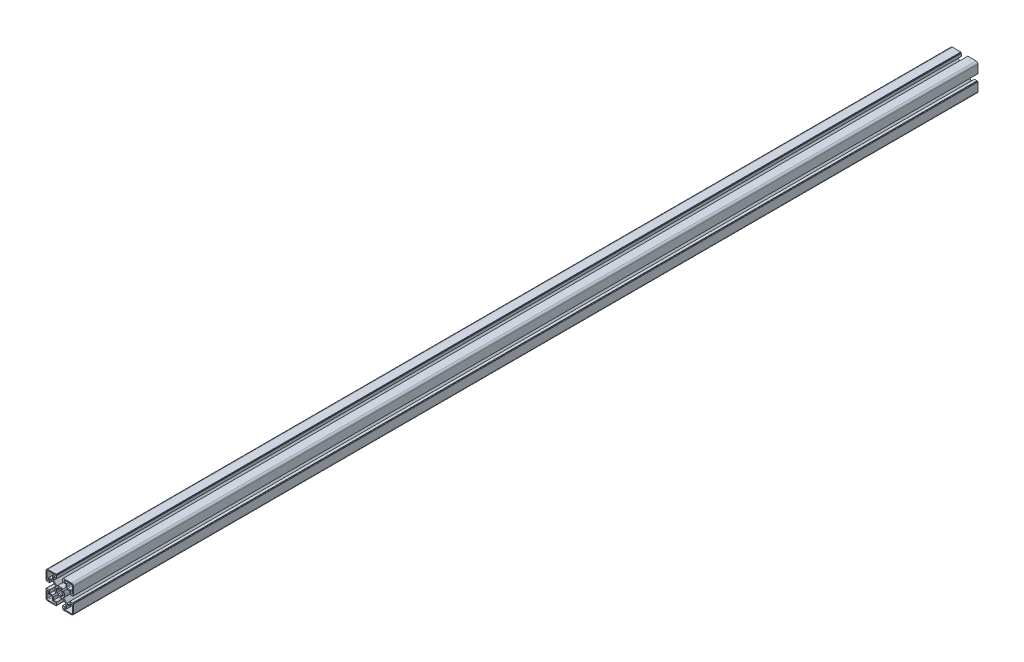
ISO-10303-21;
HEADER;
FILE_DESCRIPTION(('STEP AP214'),'2;1');
FILE_NAME('part.step','',(''),(''),'','','');
FILE_SCHEMA(('AUTOMOTIVE_DESIGN { 1 0 10303 214 1 1 1 1 }'));
ENDSEC;
DATA;
#1=APPLICATION_CONTEXT('core data for automotive mechanical design processes');
#2=APPLICATION_PROTOCOL_DEFINITION('international standard','automotive_design',2000,#1);
#3=PRODUCT_CONTEXT('',#1,'mechanical');
#4=PRODUCT('Part','Part','',(#3));
#5=PRODUCT_RELATED_PRODUCT_CATEGORY('part','',(#4));
#6=PRODUCT_DEFINITION_FORMATION('','',#4);
#7=PRODUCT_DEFINITION_CONTEXT('part definition',#1,'design');
#8=PRODUCT_DEFINITION('design','',#6,#7);
#9=PRODUCT_DEFINITION_SHAPE('','',#8);
#10=(LENGTH_UNIT() NAMED_UNIT(*) SI_UNIT(.MILLI.,.METRE.));
#11=(NAMED_UNIT(*) PLANE_ANGLE_UNIT() SI_UNIT($,.RADIAN.));
#12=(NAMED_UNIT(*) SI_UNIT($,.STERADIAN.) SOLID_ANGLE_UNIT());
#13=UNCERTAINTY_MEASURE_WITH_UNIT(LENGTH_MEASURE(1.E-05),#10,'distance_accuracy_value','');
#14=(GEOMETRIC_REPRESENTATION_CONTEXT(3) GLOBAL_UNCERTAINTY_ASSIGNED_CONTEXT((#13)) GLOBAL_UNIT_ASSIGNED_CONTEXT((#10,
#11,#12)) REPRESENTATION_CONTEXT('',''));
#15=CARTESIAN_POINT('',(0.,0.,0.));
#16=DIRECTION('',(0.,0.,1.));
#17=DIRECTION('',(1.,0.,0.));
#18=AXIS2_PLACEMENT_3D('',#15,#16,#17);
#19=CARTESIAN_POINT('',(3.3867561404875,5.06863875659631,1549.45045538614));
#20=DIRECTION('',(-0.831469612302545,0.555570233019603,0.));
#21=DIRECTION('',(-0.555570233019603,-0.831469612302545,0.));
#22=AXIS2_PLACEMENT_3D('',#19,#20,#21);
#23=PLANE('',#22);
#24=DIRECTION('',(0.,0.,-1.));
#25=VECTOR('',#24,1.);
#26=CARTESIAN_POINT('',(2.77996233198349,4.16050764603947,1549.45045538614));
#27=LINE('',#26,#25);
#28=CARTESIAN_POINT('',(2.77996233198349,4.16050764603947,1485.7984));
#29=VERTEX_POINT('',#28);
#30=CARTESIAN_POINT('',(2.77996233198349,4.16050764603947,0.));
#31=VERTEX_POINT('',#30);
#32=EDGE_CURVE('E1054',#29,#31,#27,.T.);
#33=ORIENTED_EDGE('',*,*,#32,.F.);
#34=DIRECTION('',(0.555570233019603,0.831469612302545,0.));
#35=VECTOR('',#34,1.);
#36=CARTESIAN_POINT('',(3.38675614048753,5.06863875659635,1485.7984));
#37=LINE('',#36,#35);
#38=CARTESIAN_POINT('',(3.3867561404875,5.06863875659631,1485.7984));
#39=VERTEX_POINT('',#38);
#40=EDGE_CURVE('E1984',#29,#39,#37,.T.);
#41=ORIENTED_EDGE('',*,*,#40,.T.);
#42=DIRECTION('',(0.,0.,-1.));
#43=VECTOR('',#42,1.);
#44=CARTESIAN_POINT('',(3.3867561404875,5.06863875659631,1549.45045538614));
#45=LINE('',#44,#43);
#46=CARTESIAN_POINT('',(3.3867561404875,5.06863875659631,0.));
#47=VERTEX_POINT('',#46);
#48=EDGE_CURVE('E1052',#39,#47,#45,.T.);
#49=ORIENTED_EDGE('',*,*,#48,.T.);
#50=DIRECTION('',(0.555570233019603,0.831469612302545,0.));
#51=VECTOR('',#50,1.);
#52=CARTESIAN_POINT('',(3.3867561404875,5.06863875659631,0.));
#53=LINE('',#52,#51);
#54=EDGE_CURVE('E1049',#31,#47,#53,.T.);
#55=ORIENTED_EDGE('',*,*,#54,.F.);
#56=EDGE_LOOP('',(#33,#41,#49,#55));
#57=FACE_BOUND('',#56,.T.);
#58=ADVANCED_FACE('F32',(#57),#23,.T.);
#59=CARTESIAN_POINT('',(0.,0.,1549.45045538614));
#60=DIRECTION('',(0.,0.,-1.));
#61=DIRECTION('',(-1.,0.,0.));
#62=AXIS2_PLACEMENT_3D('',#59,#60,#61);
#63=CYLINDRICAL_SURFACE('',#62,5.00379999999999);
#64=DIRECTION('',(0.,0.,-1.));
#65=VECTOR('',#64,1.);
#66=CARTESIAN_POINT('',(4.16050764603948,2.77996233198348,1549.45045538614));
#67=LINE('',#66,#65);
#68=CARTESIAN_POINT('',(4.16050764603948,2.77996233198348,1485.7984));
#69=VERTEX_POINT('',#68);
#70=CARTESIAN_POINT('',(4.16050764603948,2.77996233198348,0.));
#71=VERTEX_POINT('',#70);
#72=EDGE_CURVE('E1056',#69,#71,#67,.T.);
#73=ORIENTED_EDGE('',*,*,#72,.F.);
#74=CARTESIAN_POINT('',(0.,0.,1485.7984));
#75=DIRECTION('',(0.,0.,1.));
#76=DIRECTION('',(1.,0.,0.));
#77=AXIS2_PLACEMENT_3D('',#74,#75,#76);
#78=CIRCLE('',#77,5.00379999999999);
#79=EDGE_CURVE('E1987',#69,#29,#78,.T.);
#80=ORIENTED_EDGE('',*,*,#79,.T.);
#81=ORIENTED_EDGE('',*,*,#32,.T.);
#82=CARTESIAN_POINT('',(0.,0.,0.));
#83=DIRECTION('',(0.,0.,1.));
#84=DIRECTION('',(1.,0.,0.));
#85=AXIS2_PLACEMENT_3D('',#82,#83,#84);
#86=CIRCLE('',#85,5.00379999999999);
#87=EDGE_CURVE('E1046',#71,#31,#86,.T.);
#88=ORIENTED_EDGE('',*,*,#87,.F.);
#89=EDGE_LOOP('',(#73,#80,#81,#88));
#90=FACE_BOUND('',#89,.T.);
#91=ADVANCED_FACE('F2385',(#90),#63,.F.);
#92=CARTESIAN_POINT('',(5.06863875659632,3.38675614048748,1549.45045538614));
#93=DIRECTION('',(0.5555702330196,-0.831469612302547,0.));
#94=DIRECTION('',(0.831469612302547,0.5555702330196,0.));
#95=AXIS2_PLACEMENT_3D('',#92,#93,#94);
#96=PLANE('',#95);
#97=DIRECTION('',(0.,0.,-1.));
#98=VECTOR('',#97,1.);
#99=CARTESIAN_POINT('',(5.06863875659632,3.38675614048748,1549.45045538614));
#100=LINE('',#99,#98);
#101=CARTESIAN_POINT('',(5.06863875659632,3.38675614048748,1485.7984));
#102=VERTEX_POINT('',#101);
#103=CARTESIAN_POINT('',(5.06863875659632,3.38675614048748,0.));
#104=VERTEX_POINT('',#103);
#105=EDGE_CURVE('E1058',#102,#104,#100,.T.);
#106=ORIENTED_EDGE('',*,*,#105,.F.);
#107=DIRECTION('',(-0.831469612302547,-0.5555702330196,0.));
#108=VECTOR('',#107,1.);
#109=CARTESIAN_POINT('',(5.06863875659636,3.38675614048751,1485.7984));
#110=LINE('',#109,#108);
#111=EDGE_CURVE('E1990',#102,#69,#110,.T.);
#112=ORIENTED_EDGE('',*,*,#111,.T.);
#113=ORIENTED_EDGE('',*,*,#72,.T.);
#114=DIRECTION('',(-0.831469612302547,-0.5555702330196,0.));
#115=VECTOR('',#114,1.);
#116=CARTESIAN_POINT('',(5.06863875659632,3.38675614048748,0.));
#117=LINE('',#116,#115);
#118=EDGE_CURVE('E1043',#104,#71,#117,.T.);
#119=ORIENTED_EDGE('',*,*,#118,.F.);
#120=EDGE_LOOP('',(#106,#112,#113,#119));
#121=FACE_BOUND('',#120,.T.);
#122=ADVANCED_FACE('F2381',(#121),#96,.T.);
#123=CARTESIAN_POINT('',(0.,0.,1549.45045538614));
#124=DIRECTION('',(0.,0.,-1.));
#125=DIRECTION('',(-1.,0.,0.));
#126=AXIS2_PLACEMENT_3D('',#123,#124,#125);
#127=CYLINDRICAL_SURFACE('',#126,6.09599999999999);
#128=DIRECTION('',(0.,0.,-1.));
#129=VECTOR('',#128,1.);
#130=CARTESIAN_POINT('',(5.9788670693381,1.1892706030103,1549.45045538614));
#131=LINE('',#130,#129);
#132=CARTESIAN_POINT('',(5.9788670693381,1.1892706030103,1485.7984));
#133=VERTEX_POINT('',#132);
#134=CARTESIAN_POINT('',(5.9788670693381,1.1892706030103,0.));
#135=VERTEX_POINT('',#134);
#136=EDGE_CURVE('E1060',#133,#135,#131,.T.);
#137=ORIENTED_EDGE('',*,*,#136,.F.);
#138=CARTESIAN_POINT('',(0.,0.,1485.7984));
#139=DIRECTION('',(0.,0.,1.));
#140=DIRECTION('',(1.,0.,0.));
#141=AXIS2_PLACEMENT_3D('',#138,#139,#140);
#142=CIRCLE('',#141,6.09599999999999);
#143=EDGE_CURVE('E1993',#133,#102,#142,.T.);
#144=ORIENTED_EDGE('',*,*,#143,.T.);
#145=ORIENTED_EDGE('',*,*,#105,.T.);
#146=CARTESIAN_POINT('',(0.,0.,0.));
#147=DIRECTION('',(0.,0.,1.));
#148=DIRECTION('',(1.,0.,0.));
#149=AXIS2_PLACEMENT_3D('',#146,#147,#148);
#150=CIRCLE('',#149,6.09599999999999);
#151=EDGE_CURVE('E1040',#135,#104,#150,.T.);
#152=ORIENTED_EDGE('',*,*,#151,.F.);
#153=EDGE_LOOP('',(#137,#144,#145,#152));
#154=FACE_BOUND('',#153,.T.);
#155=ADVANCED_FACE('F2377',(#154),#127,.F.);
#156=CARTESIAN_POINT('',(5.9788670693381,1.1892706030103,1549.45045538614));
#157=DIRECTION('',(-0.195090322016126,0.980785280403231,0.));
#158=DIRECTION('',(-0.980785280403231,-0.195090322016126,0.));
#159=AXIS2_PLACEMENT_3D('',#156,#157,#158);
#160=PLANE('',#159);
#161=DIRECTION('',(0.,0.,-1.));
#162=VECTOR('',#161,1.);
#163=CARTESIAN_POINT('',(4.90765338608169,0.976192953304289,1549.45045538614));
#164=LINE('',#163,#162);
#165=CARTESIAN_POINT('',(4.90765338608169,0.976192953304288,1485.7984));
#166=VERTEX_POINT('',#165);
#167=CARTESIAN_POINT('',(4.90765338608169,0.976192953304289,0.));
#168=VERTEX_POINT('',#167);
#169=EDGE_CURVE('E1062',#166,#168,#164,.T.);
#170=ORIENTED_EDGE('',*,*,#169,.F.);
#171=DIRECTION('',(0.980785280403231,0.195090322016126,0.));
#172=VECTOR('',#171,1.);
#173=CARTESIAN_POINT('',(5.97886706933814,1.18927060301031,1485.7984));
#174=LINE('',#173,#172);
#175=EDGE_CURVE('E1996',#166,#133,#174,.T.);
#176=ORIENTED_EDGE('',*,*,#175,.T.);
#177=ORIENTED_EDGE('',*,*,#136,.T.);
#178=DIRECTION('',(0.980785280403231,0.195090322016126,0.));
#179=VECTOR('',#178,1.);
#180=CARTESIAN_POINT('',(5.9788670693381,1.1892706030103,0.));
#181=LINE('',#180,#179);
#182=EDGE_CURVE('E1037',#168,#135,#181,.T.);
#183=ORIENTED_EDGE('',*,*,#182,.F.);
#184=EDGE_LOOP('',(#170,#176,#177,#183));
#185=FACE_BOUND('',#184,.T.);
#186=ADVANCED_FACE('F2374',(#185),#160,.T.);
#187=CARTESIAN_POINT('',(0.,0.,1549.45045538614));
#188=DIRECTION('',(0.,0.,-1.));
#189=DIRECTION('',(-1.,0.,0.));
#190=AXIS2_PLACEMENT_3D('',#187,#188,#189);
#191=CYLINDRICAL_SURFACE('',#190,5.00379999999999);
#192=DIRECTION('',(0.,0.,-1.));
#193=VECTOR('',#192,1.);
#194=CARTESIAN_POINT('',(4.90765338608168,-0.97619295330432,1549.45045538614));
#195=LINE('',#194,#193);
#196=CARTESIAN_POINT('',(4.90765338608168,-0.976192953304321,1485.7984));
#197=VERTEX_POINT('',#196);
#198=CARTESIAN_POINT('',(4.90765338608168,-0.97619295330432,0.));
#199=VERTEX_POINT('',#198);
#200=EDGE_CURVE('E1064',#197,#199,#195,.T.);
#201=ORIENTED_EDGE('',*,*,#200,.F.);
#202=CARTESIAN_POINT('',(0.,0.,1485.7984));
#203=DIRECTION('',(0.,0.,1.));
#204=DIRECTION('',(1.,0.,0.));
#205=AXIS2_PLACEMENT_3D('',#202,#203,#204);
#206=CIRCLE('',#205,5.00379999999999);
#207=EDGE_CURVE('E1999',#197,#166,#206,.T.);
#208=ORIENTED_EDGE('',*,*,#207,.T.);
#209=ORIENTED_EDGE('',*,*,#169,.T.);
#210=CARTESIAN_POINT('',(0.,0.,0.));
#211=DIRECTION('',(0.,0.,1.));
#212=DIRECTION('',(1.,0.,0.));
#213=AXIS2_PLACEMENT_3D('',#210,#211,#212);
#214=CIRCLE('',#213,5.00379999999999);
#215=EDGE_CURVE('E1034',#199,#168,#214,.T.);
#216=ORIENTED_EDGE('',*,*,#215,.F.);
#217=EDGE_LOOP('',(#201,#208,#209,#216));
#218=FACE_BOUND('',#217,.T.);
#219=ADVANCED_FACE('F2369',(#218),#191,.F.);
#220=CARTESIAN_POINT('',(5.97886706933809,-1.18927060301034,1549.45045538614));
#221=DIRECTION('',(-0.195090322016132,-0.98078528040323,0.));
#222=DIRECTION('',(0.98078528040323,-0.195090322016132,0.));
#223=AXIS2_PLACEMENT_3D('',#220,#221,#222);
#224=PLANE('',#223);
#225=DIRECTION('',(0.,0.,-1.));
#226=VECTOR('',#225,1.);
#227=CARTESIAN_POINT('',(5.97886706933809,-1.18927060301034,1549.45045538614));
#228=LINE('',#227,#226);
#229=CARTESIAN_POINT('',(5.97886706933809,-1.18927060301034,1485.7984));
#230=VERTEX_POINT('',#229);
#231=CARTESIAN_POINT('',(5.97886706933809,-1.18927060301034,0.));
#232=VERTEX_POINT('',#231);
#233=EDGE_CURVE('E1066',#230,#232,#228,.T.);
#234=ORIENTED_EDGE('',*,*,#233,.F.);
#235=DIRECTION('',(-0.98078528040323,0.195090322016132,0.));
#236=VECTOR('',#235,1.);
#237=CARTESIAN_POINT('',(5.97886706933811,-1.18927060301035,1485.7984));
#238=LINE('',#237,#236);
#239=EDGE_CURVE('E2002',#230,#197,#238,.T.);
#240=ORIENTED_EDGE('',*,*,#239,.T.);
#241=ORIENTED_EDGE('',*,*,#200,.T.);
#242=DIRECTION('',(-0.98078528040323,0.195090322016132,0.));
#243=VECTOR('',#242,1.);
#244=CARTESIAN_POINT('',(5.97886706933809,-1.18927060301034,0.));
#245=LINE('',#244,#243);
#246=EDGE_CURVE('E1031',#232,#199,#245,.T.);
#247=ORIENTED_EDGE('',*,*,#246,.F.);
#248=EDGE_LOOP('',(#234,#240,#241,#247));
#249=FACE_BOUND('',#248,.T.);
#250=ADVANCED_FACE('F2365',(#249),#224,.T.);
#251=CARTESIAN_POINT('',(0.,0.,1549.45045538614));
#252=DIRECTION('',(0.,0.,-1.));
#253=DIRECTION('',(-1.,0.,0.));
#254=AXIS2_PLACEMENT_3D('',#251,#252,#253);
#255=CYLINDRICAL_SURFACE('',#254,6.09599999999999);
#256=DIRECTION('',(0.,0.,-1.));
#257=VECTOR('',#256,1.);
#258=CARTESIAN_POINT('',(5.0686387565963,-3.38675614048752,1549.45045538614));
#259=LINE('',#258,#257);
#260=CARTESIAN_POINT('',(5.0686387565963,-3.38675614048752,1485.7984));
#261=VERTEX_POINT('',#260);
#262=CARTESIAN_POINT('',(5.0686387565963,-3.38675614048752,0.));
#263=VERTEX_POINT('',#262);
#264=EDGE_CURVE('E1068',#261,#263,#259,.T.);
#265=ORIENTED_EDGE('',*,*,#264,.F.);
#266=CARTESIAN_POINT('',(0.,0.,1485.7984));
#267=DIRECTION('',(0.,0.,1.));
#268=DIRECTION('',(1.,0.,0.));
#269=AXIS2_PLACEMENT_3D('',#266,#267,#268);
#270=CIRCLE('',#269,6.09599999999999);
#271=EDGE_CURVE('E2005',#261,#230,#270,.T.);
#272=ORIENTED_EDGE('',*,*,#271,.T.);
#273=ORIENTED_EDGE('',*,*,#233,.T.);
#274=CARTESIAN_POINT('',(0.,0.,0.));
#275=DIRECTION('',(0.,0.,1.));
#276=DIRECTION('',(1.,0.,0.));
#277=AXIS2_PLACEMENT_3D('',#274,#275,#276);
#278=CIRCLE('',#277,6.09599999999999);
#279=EDGE_CURVE('E1028',#263,#232,#278,.T.);
#280=ORIENTED_EDGE('',*,*,#279,.F.);
#281=EDGE_LOOP('',(#265,#272,#273,#280));
#282=FACE_BOUND('',#281,.T.);
#283=ADVANCED_FACE('F2362',(#282),#255,.F.);
#284=CARTESIAN_POINT('',(5.0686387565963,-3.38675614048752,1549.45045538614));
#285=DIRECTION('',(0.555570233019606,0.831469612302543,0.));
#286=DIRECTION('',(-0.831469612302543,0.555570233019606,0.));
#287=AXIS2_PLACEMENT_3D('',#284,#285,#286);
#288=PLANE('',#287);
#289=DIRECTION('',(0.,0.,-1.));
#290=VECTOR('',#289,1.);
#291=CARTESIAN_POINT('',(4.16050764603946,-2.7799623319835,1549.45045538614));
#292=LINE('',#291,#290);
#293=CARTESIAN_POINT('',(4.16050764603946,-2.77996233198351,1485.7984));
#294=VERTEX_POINT('',#293);
#295=CARTESIAN_POINT('',(4.16050764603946,-2.7799623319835,0.));
#296=VERTEX_POINT('',#295);
#297=EDGE_CURVE('E1070',#294,#296,#292,.T.);
#298=ORIENTED_EDGE('',*,*,#297,.F.);
#299=DIRECTION('',(0.831469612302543,-0.555570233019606,0.));
#300=VECTOR('',#299,1.);
#301=CARTESIAN_POINT('',(5.06863875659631,-3.38675614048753,1485.7984));
#302=LINE('',#301,#300);
#303=EDGE_CURVE('E2008',#294,#261,#302,.T.);
#304=ORIENTED_EDGE('',*,*,#303,.T.);
#305=ORIENTED_EDGE('',*,*,#264,.T.);
#306=DIRECTION('',(0.831469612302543,-0.555570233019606,0.));
#307=VECTOR('',#306,1.);
#308=CARTESIAN_POINT('',(5.0686387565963,-3.38675614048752,0.));
#309=LINE('',#308,#307);
#310=EDGE_CURVE('E1025',#296,#263,#309,.T.);
#311=ORIENTED_EDGE('',*,*,#310,.F.);
#312=EDGE_LOOP('',(#298,#304,#305,#311));
#313=FACE_BOUND('',#312,.T.);
#314=ADVANCED_FACE('F2357',(#313),#288,.T.);
#315=CARTESIAN_POINT('',(0.,0.,1549.45045538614));
#316=DIRECTION('',(0.,0.,-1.));
#317=DIRECTION('',(-1.,0.,0.));
#318=AXIS2_PLACEMENT_3D('',#315,#316,#317);
#319=CYLINDRICAL_SURFACE('',#318,5.00379999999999);
#320=DIRECTION('',(0.,0.,-1.));
#321=VECTOR('',#320,1.);
#322=CARTESIAN_POINT('',(2.77996233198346,-4.16050764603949,1549.45045538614));
#323=LINE('',#322,#321);
#324=CARTESIAN_POINT('',(2.77996233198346,-4.16050764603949,1485.7984));
#325=VERTEX_POINT('',#324);
#326=CARTESIAN_POINT('',(2.77996233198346,-4.16050764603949,0.));
#327=VERTEX_POINT('',#326);
#328=EDGE_CURVE('E1072',#325,#327,#323,.T.);
#329=ORIENTED_EDGE('',*,*,#328,.F.);
#330=CARTESIAN_POINT('',(0.,0.,1485.7984));
#331=DIRECTION('',(0.,0.,1.));
#332=DIRECTION('',(1.,0.,0.));
#333=AXIS2_PLACEMENT_3D('',#330,#331,#332);
#334=CIRCLE('',#333,5.00379999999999);
#335=EDGE_CURVE('E2011',#325,#294,#334,.T.);
#336=ORIENTED_EDGE('',*,*,#335,.T.);
#337=ORIENTED_EDGE('',*,*,#297,.T.);
#338=CARTESIAN_POINT('',(0.,0.,0.));
#339=DIRECTION('',(0.,0.,1.));
#340=DIRECTION('',(1.,0.,0.));
#341=AXIS2_PLACEMENT_3D('',#338,#339,#340);
#342=CIRCLE('',#341,5.00379999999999);
#343=EDGE_CURVE('E1022',#327,#296,#342,.T.);
#344=ORIENTED_EDGE('',*,*,#343,.F.);
#345=EDGE_LOOP('',(#329,#336,#337,#344));
#346=FACE_BOUND('',#345,.T.);
#347=ADVANCED_FACE('F2353',(#346),#319,.F.);
#348=CARTESIAN_POINT('',(3.38675614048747,-5.06863875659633,1549.45045538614));
#349=DIRECTION('',(-0.831469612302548,-0.555570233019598,0.));
#350=DIRECTION('',(0.555570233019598,-0.831469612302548,0.));
#351=AXIS2_PLACEMENT_3D('',#348,#349,#350);
#352=PLANE('',#351);
#353=DIRECTION('',(0.,0.,-1.));
#354=VECTOR('',#353,1.);
#355=CARTESIAN_POINT('',(3.38675614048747,-5.06863875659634,1549.45045538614));
#356=LINE('',#355,#354);
#357=CARTESIAN_POINT('',(3.38675614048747,-5.06863875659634,1485.7984));
#358=VERTEX_POINT('',#357);
#359=CARTESIAN_POINT('',(3.38675614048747,-5.06863875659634,0.));
#360=VERTEX_POINT('',#359);
#361=EDGE_CURVE('E1074',#358,#360,#356,.T.);
#362=ORIENTED_EDGE('',*,*,#361,.F.);
#363=DIRECTION('',(-0.555570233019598,0.831469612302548,0.));
#364=VECTOR('',#363,1.);
#365=CARTESIAN_POINT('',(3.38675614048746,-5.06863875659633,1485.7984));
#366=LINE('',#365,#364);
#367=EDGE_CURVE('E2014',#358,#325,#366,.T.);
#368=ORIENTED_EDGE('',*,*,#367,.T.);
#369=ORIENTED_EDGE('',*,*,#328,.T.);
#370=DIRECTION('',(-0.555570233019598,0.831469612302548,0.));
#371=VECTOR('',#370,1.);
#372=CARTESIAN_POINT('',(3.38675614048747,-5.06863875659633,0.));
#373=LINE('',#372,#371);
#374=EDGE_CURVE('E1019',#360,#327,#373,.T.);
#375=ORIENTED_EDGE('',*,*,#374,.F.);
#376=EDGE_LOOP('',(#362,#368,#369,#375));
#377=FACE_BOUND('',#376,.T.);
#378=ADVANCED_FACE('F2350',(#377),#352,.T.);
#379=CARTESIAN_POINT('',(0.,0.,1549.45045538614));
#380=DIRECTION('',(0.,0.,-1.));
#381=DIRECTION('',(-1.,0.,0.));
#382=AXIS2_PLACEMENT_3D('',#379,#380,#381);
#383=CYLINDRICAL_SURFACE('',#382,6.096);
#384=DIRECTION('',(0.,0.,-1.));
#385=VECTOR('',#384,1.);
#386=CARTESIAN_POINT('',(1.18927060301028,-5.9788670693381,1549.45045538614));
#387=LINE('',#386,#385);
#388=CARTESIAN_POINT('',(1.18927060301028,-5.9788670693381,1485.7984));
#389=VERTEX_POINT('',#388);
#390=CARTESIAN_POINT('',(1.18927060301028,-5.9788670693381,0.));
#391=VERTEX_POINT('',#390);
#392=EDGE_CURVE('E1076',#389,#391,#387,.T.);
#393=ORIENTED_EDGE('',*,*,#392,.F.);
#394=CARTESIAN_POINT('',(0.,0.,1485.7984));
#395=DIRECTION('',(0.,0.,1.));
#396=DIRECTION('',(1.,0.,0.));
#397=AXIS2_PLACEMENT_3D('',#394,#395,#396);
#398=CIRCLE('',#397,6.096);
#399=EDGE_CURVE('E2017',#389,#358,#398,.T.);
#400=ORIENTED_EDGE('',*,*,#399,.T.);
#401=ORIENTED_EDGE('',*,*,#361,.T.);
#402=CARTESIAN_POINT('',(0.,0.,0.));
#403=DIRECTION('',(0.,0.,1.));
#404=DIRECTION('',(1.,0.,0.));
#405=AXIS2_PLACEMENT_3D('',#402,#403,#404);
#406=CIRCLE('',#405,6.096);
#407=EDGE_CURVE('E1016',#391,#360,#406,.T.);
#408=ORIENTED_EDGE('',*,*,#407,.F.);
#409=EDGE_LOOP('',(#393,#400,#401,#408));
#410=FACE_BOUND('',#409,.T.);
#411=ADVANCED_FACE('F2345',(#410),#383,.F.);
#412=CARTESIAN_POINT('',(1.18927060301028,-5.9788670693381,1549.45045538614));
#413=DIRECTION('',(0.980785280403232,0.195090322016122,0.));
#414=DIRECTION('',(-0.195090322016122,0.980785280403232,0.));
#415=AXIS2_PLACEMENT_3D('',#412,#413,#414);
#416=PLANE('',#415);
#417=DIRECTION('',(0.,0.,-1.));
#418=VECTOR('',#417,1.);
#419=CARTESIAN_POINT('',(0.97619295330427,-4.90765338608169,1549.45045538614));
#420=LINE('',#419,#418);
#421=CARTESIAN_POINT('',(0.976192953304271,-4.90765338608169,1485.7984));
#422=VERTEX_POINT('',#421);
#423=CARTESIAN_POINT('',(0.97619295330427,-4.90765338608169,0.));
#424=VERTEX_POINT('',#423);
#425=EDGE_CURVE('E1078',#422,#424,#420,.T.);
#426=ORIENTED_EDGE('',*,*,#425,.F.);
#427=DIRECTION('',(0.195090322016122,-0.980785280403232,0.));
#428=VECTOR('',#427,1.);
#429=CARTESIAN_POINT('',(1.18927060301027,-5.97886706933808,1485.7984));
#430=LINE('',#429,#428);
#431=EDGE_CURVE('E2020',#422,#389,#430,.T.);
#432=ORIENTED_EDGE('',*,*,#431,.T.);
#433=ORIENTED_EDGE('',*,*,#392,.T.);
#434=DIRECTION('',(0.195090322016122,-0.980785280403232,0.));
#435=VECTOR('',#434,1.);
#436=CARTESIAN_POINT('',(1.18927060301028,-5.9788670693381,0.));
#437=LINE('',#436,#435);
#438=EDGE_CURVE('E1013',#424,#391,#437,.T.);
#439=ORIENTED_EDGE('',*,*,#438,.F.);
#440=EDGE_LOOP('',(#426,#432,#433,#439));
#441=FACE_BOUND('',#440,.T.);
#442=ADVANCED_FACE('F2341',(#441),#416,.T.);
#443=CARTESIAN_POINT('',(0.,0.,1549.45045538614));
#444=DIRECTION('',(0.,0.,-1.));
#445=DIRECTION('',(-1.,0.,0.));
#446=AXIS2_PLACEMENT_3D('',#443,#444,#445);
#447=CYLINDRICAL_SURFACE('',#446,5.0038);
#448=DIRECTION('',(0.,0.,-1.));
#449=VECTOR('',#448,1.);
#450=CARTESIAN_POINT('',(-0.976192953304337,-4.90765338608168,1549.45045538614));
#451=LINE('',#450,#449);
#452=CARTESIAN_POINT('',(-0.976192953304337,-4.90765338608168,1485.7984));
#453=VERTEX_POINT('',#452);
#454=CARTESIAN_POINT('',(-0.976192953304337,-4.90765338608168,0.));
#455=VERTEX_POINT('',#454);
#456=EDGE_CURVE('E1080',#453,#455,#451,.T.);
#457=ORIENTED_EDGE('',*,*,#456,.F.);
#458=CARTESIAN_POINT('',(0.,0.,1485.7984));
#459=DIRECTION('',(0.,0.,1.));
#460=DIRECTION('',(1.,0.,0.));
#461=AXIS2_PLACEMENT_3D('',#458,#459,#460);
#462=CIRCLE('',#461,5.0038);
#463=EDGE_CURVE('E2023',#453,#422,#462,.T.);
#464=ORIENTED_EDGE('',*,*,#463,.T.);
#465=ORIENTED_EDGE('',*,*,#425,.T.);
#466=CARTESIAN_POINT('',(0.,0.,0.));
#467=DIRECTION('',(0.,0.,1.));
#468=DIRECTION('',(1.,0.,0.));
#469=AXIS2_PLACEMENT_3D('',#466,#467,#468);
#470=CIRCLE('',#469,5.0038);
#471=EDGE_CURVE('E1010',#455,#424,#470,.T.);
#472=ORIENTED_EDGE('',*,*,#471,.F.);
#473=EDGE_LOOP('',(#457,#464,#465,#472));
#474=FACE_BOUND('',#473,.T.);
#475=ADVANCED_FACE('F2338',(#474),#447,.F.);
#476=CARTESIAN_POINT('',(-1.18927060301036,-5.97886706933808,1549.45045538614));
#477=DIRECTION('',(-0.980785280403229,0.195090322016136,0.));
#478=DIRECTION('',(-0.195090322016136,-0.980785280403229,0.));
#479=AXIS2_PLACEMENT_3D('',#476,#477,#478);
#480=PLANE('',#479);
#481=DIRECTION('',(0.,0.,-1.));
#482=VECTOR('',#481,1.);
#483=CARTESIAN_POINT('',(-1.18927060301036,-5.97886706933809,1549.45045538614));
#484=LINE('',#483,#482);
#485=CARTESIAN_POINT('',(-1.18927060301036,-5.97886706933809,1485.7984));
#486=VERTEX_POINT('',#485);
#487=CARTESIAN_POINT('',(-1.18927060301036,-5.97886706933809,0.));
#488=VERTEX_POINT('',#487);
#489=EDGE_CURVE('E1082',#486,#488,#484,.T.);
#490=ORIENTED_EDGE('',*,*,#489,.F.);
#491=DIRECTION('',(0.195090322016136,0.980785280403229,0.));
#492=VECTOR('',#491,1.);
#493=CARTESIAN_POINT('',(-1.18927060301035,-5.97886706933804,1485.7984));
#494=LINE('',#493,#492);
#495=EDGE_CURVE('E2026',#486,#453,#494,.T.);
#496=ORIENTED_EDGE('',*,*,#495,.T.);
#497=ORIENTED_EDGE('',*,*,#456,.T.);
#498=DIRECTION('',(0.195090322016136,0.980785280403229,0.));
#499=VECTOR('',#498,1.);
#500=CARTESIAN_POINT('',(-1.18927060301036,-5.97886706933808,0.));
#501=LINE('',#500,#499);
#502=EDGE_CURVE('E1007',#488,#455,#501,.T.);
#503=ORIENTED_EDGE('',*,*,#502,.F.);
#504=EDGE_LOOP('',(#490,#496,#497,#503));
#505=FACE_BOUND('',#504,.T.);
#506=ADVANCED_FACE('F2333',(#505),#480,.T.);
#507=CARTESIAN_POINT('',(0.,0.,1549.45045538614));
#508=DIRECTION('',(0.,0.,-1.));
#509=DIRECTION('',(-1.,0.,0.));
#510=AXIS2_PLACEMENT_3D('',#507,#508,#509);
#511=CYLINDRICAL_SURFACE('',#510,6.096);
#512=DIRECTION('',(0.,0.,-1.));
#513=VECTOR('',#512,1.);
#514=CARTESIAN_POINT('',(-3.38675614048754,-5.06863875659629,1549.45045538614));
#515=LINE('',#514,#513);
#516=CARTESIAN_POINT('',(-3.38675614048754,-5.06863875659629,1485.7984));
#517=VERTEX_POINT('',#516);
#518=CARTESIAN_POINT('',(-3.38675614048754,-5.06863875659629,0.));
#519=VERTEX_POINT('',#518);
#520=EDGE_CURVE('E1084',#517,#519,#515,.T.);
#521=ORIENTED_EDGE('',*,*,#520,.F.);
#522=CARTESIAN_POINT('',(0.,0.,1485.7984));
#523=DIRECTION('',(0.,0.,1.));
#524=DIRECTION('',(1.,0.,0.));
#525=AXIS2_PLACEMENT_3D('',#522,#523,#524);
#526=CIRCLE('',#525,6.096);
#527=EDGE_CURVE('E2029',#517,#486,#526,.T.);
#528=ORIENTED_EDGE('',*,*,#527,.T.);
#529=ORIENTED_EDGE('',*,*,#489,.T.);
#530=CARTESIAN_POINT('',(0.,0.,0.));
#531=DIRECTION('',(0.,0.,1.));
#532=DIRECTION('',(1.,0.,0.));
#533=AXIS2_PLACEMENT_3D('',#530,#531,#532);
#534=CIRCLE('',#533,6.096);
#535=EDGE_CURVE('E1004',#519,#488,#534,.T.);
#536=ORIENTED_EDGE('',*,*,#535,.F.);
#537=EDGE_LOOP('',(#521,#528,#529,#536));
#538=FACE_BOUND('',#537,.T.);
#539=ADVANCED_FACE('F2329',(#538),#511,.F.);
#540=CARTESIAN_POINT('',(-3.38675614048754,-5.06863875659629,1549.45045538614));
#541=DIRECTION('',(0.831469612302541,-0.555570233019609,0.));
#542=DIRECTION('',(0.555570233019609,0.831469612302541,0.));
#543=AXIS2_PLACEMENT_3D('',#540,#541,#542);
#544=PLANE('',#543);
#545=DIRECTION('',(0.,0.,-1.));
#546=VECTOR('',#545,1.);
#547=CARTESIAN_POINT('',(-2.77996233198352,-4.16050764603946,1549.45045538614));
#548=LINE('',#547,#546);
#549=CARTESIAN_POINT('',(-2.77996233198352,-4.16050764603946,1485.7984));
#550=VERTEX_POINT('',#549);
#551=CARTESIAN_POINT('',(-2.77996233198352,-4.16050764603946,0.));
#552=VERTEX_POINT('',#551);
#553=EDGE_CURVE('E1086',#550,#552,#548,.T.);
#554=ORIENTED_EDGE('',*,*,#553,.F.);
#555=DIRECTION('',(-0.555570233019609,-0.831469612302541,0.));
#556=VECTOR('',#555,1.);
#557=CARTESIAN_POINT('',(-3.38675614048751,-5.06863875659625,1485.7984));
#558=LINE('',#557,#556);
#559=EDGE_CURVE('E2032',#550,#517,#558,.T.);
#560=ORIENTED_EDGE('',*,*,#559,.T.);
#561=ORIENTED_EDGE('',*,*,#520,.T.);
#562=DIRECTION('',(-0.555570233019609,-0.831469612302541,0.));
#563=VECTOR('',#562,1.);
#564=CARTESIAN_POINT('',(-3.38675614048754,-5.06863875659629,0.));
#565=LINE('',#564,#563);
#566=EDGE_CURVE('E1001',#552,#519,#565,.T.);
#567=ORIENTED_EDGE('',*,*,#566,.F.);
#568=EDGE_LOOP('',(#554,#560,#561,#567));
#569=FACE_BOUND('',#568,.T.);
#570=ADVANCED_FACE('F2326',(#569),#544,.T.);
#571=CARTESIAN_POINT('',(0.,0.,1549.45045538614));
#572=DIRECTION('',(0.,0.,-1.));
#573=DIRECTION('',(-1.,0.,0.));
#574=AXIS2_PLACEMENT_3D('',#571,#572,#573);
#575=CYLINDRICAL_SURFACE('',#574,5.0038);
#576=DIRECTION('',(0.,0.,-1.));
#577=VECTOR('',#576,1.);
#578=CARTESIAN_POINT('',(-4.1605076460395,-2.77996233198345,1549.45045538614));
#579=LINE('',#578,#577);
#580=CARTESIAN_POINT('',(-4.1605076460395,-2.77996233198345,1485.7984));
#581=VERTEX_POINT('',#580);
#582=CARTESIAN_POINT('',(-4.1605076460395,-2.77996233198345,0.));
#583=VERTEX_POINT('',#582);
#584=EDGE_CURVE('E1088',#581,#583,#579,.T.);
#585=ORIENTED_EDGE('',*,*,#584,.F.);
#586=CARTESIAN_POINT('',(0.,0.,1485.7984));
#587=DIRECTION('',(0.,0.,1.));
#588=DIRECTION('',(1.,0.,0.));
#589=AXIS2_PLACEMENT_3D('',#586,#587,#588);
#590=CIRCLE('',#589,5.0038);
#591=EDGE_CURVE('E2035',#581,#550,#590,.T.);
#592=ORIENTED_EDGE('',*,*,#591,.T.);
#593=ORIENTED_EDGE('',*,*,#553,.T.);
#594=CARTESIAN_POINT('',(0.,0.,0.));
#595=DIRECTION('',(0.,0.,1.));
#596=DIRECTION('',(1.,0.,0.));
#597=AXIS2_PLACEMENT_3D('',#594,#595,#596);
#598=CIRCLE('',#597,5.0038);
#599=EDGE_CURVE('E998',#583,#552,#598,.T.);
#600=ORIENTED_EDGE('',*,*,#599,.F.);
#601=EDGE_LOOP('',(#585,#592,#593,#600));
#602=FACE_BOUND('',#601,.T.);
#603=ADVANCED_FACE('F2321',(#602),#575,.F.);
#604=CARTESIAN_POINT('',(-5.06863875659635,-3.38675614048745,1549.45045538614));
#605=DIRECTION('',(-0.555570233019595,0.83146961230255,0.));
#606=DIRECTION('',(-0.831469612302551,-0.555570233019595,0.));
#607=AXIS2_PLACEMENT_3D('',#604,#605,#606);
#608=PLANE('',#607);
#609=DIRECTION('',(0.,0.,-1.));
#610=VECTOR('',#609,1.);
#611=CARTESIAN_POINT('',(-5.06863875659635,-3.38675614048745,1549.45045538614));
#612=LINE('',#611,#610);
#613=CARTESIAN_POINT('',(-5.06863875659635,-3.38675614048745,1485.7984));
#614=VERTEX_POINT('',#613);
#615=CARTESIAN_POINT('',(-5.06863875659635,-3.38675614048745,0.));
#616=VERTEX_POINT('',#615);
#617=EDGE_CURVE('E1090',#614,#616,#612,.T.);
#618=ORIENTED_EDGE('',*,*,#617,.F.);
#619=DIRECTION('',(0.83146961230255,0.555570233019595,0.));
#620=VECTOR('',#619,1.);
#621=CARTESIAN_POINT('',(-5.06863875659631,-3.38675614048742,1485.7984));
#622=LINE('',#621,#620);
#623=EDGE_CURVE('E2038',#614,#581,#622,.T.);
#624=ORIENTED_EDGE('',*,*,#623,.T.);
#625=ORIENTED_EDGE('',*,*,#584,.T.);
#626=DIRECTION('',(0.83146961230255,0.555570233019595,0.));
#627=VECTOR('',#626,1.);
#628=CARTESIAN_POINT('',(-5.06863875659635,-3.38675614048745,0.));
#629=LINE('',#628,#627);
#630=EDGE_CURVE('E995',#616,#583,#629,.T.);
#631=ORIENTED_EDGE('',*,*,#630,.F.);
#632=EDGE_LOOP('',(#618,#624,#625,#631));
#633=FACE_BOUND('',#632,.T.);
#634=ADVANCED_FACE('F2317',(#633),#608,.T.);
#635=CARTESIAN_POINT('',(0.,0.,1549.45045538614));
#636=DIRECTION('',(0.,0.,-1.));
#637=DIRECTION('',(-1.,0.,0.));
#638=AXIS2_PLACEMENT_3D('',#635,#636,#637);
#639=CYLINDRICAL_SURFACE('',#638,6.09600000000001);
#640=DIRECTION('',(0.,0.,-1.));
#641=VECTOR('',#640,1.);
#642=CARTESIAN_POINT('',(-5.9788670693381,-1.18927060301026,1549.45045538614));
#643=LINE('',#642,#641);
#644=CARTESIAN_POINT('',(-5.9788670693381,-1.18927060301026,1485.7984));
#645=VERTEX_POINT('',#644);
#646=CARTESIAN_POINT('',(-5.9788670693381,-1.18927060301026,0.));
#647=VERTEX_POINT('',#646);
#648=EDGE_CURVE('E1092',#645,#647,#643,.T.);
#649=ORIENTED_EDGE('',*,*,#648,.F.);
#650=CARTESIAN_POINT('',(0.,0.,1485.7984));
#651=DIRECTION('',(0.,0.,1.));
#652=DIRECTION('',(1.,0.,0.));
#653=AXIS2_PLACEMENT_3D('',#650,#651,#652);
#654=CIRCLE('',#653,6.09600000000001);
#655=EDGE_CURVE('E2041',#645,#614,#654,.T.);
#656=ORIENTED_EDGE('',*,*,#655,.T.);
#657=ORIENTED_EDGE('',*,*,#617,.T.);
#658=CARTESIAN_POINT('',(0.,0.,0.));
#659=DIRECTION('',(0.,0.,1.));
#660=DIRECTION('',(1.,0.,0.));
#661=AXIS2_PLACEMENT_3D('',#658,#659,#660);
#662=CIRCLE('',#661,6.09600000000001);
#663=EDGE_CURVE('E992',#647,#616,#662,.T.);
#664=ORIENTED_EDGE('',*,*,#663,.F.);
#665=EDGE_LOOP('',(#649,#656,#657,#664));
#666=FACE_BOUND('',#665,.T.);
#667=ADVANCED_FACE('F2314',(#666),#639,.F.);
#668=CARTESIAN_POINT('',(-5.9788670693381,-1.18927060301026,1549.45045538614));
#669=DIRECTION('',(0.195090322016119,-0.980785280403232,0.));
#670=DIRECTION('',(0.980785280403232,0.195090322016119,0.));
#671=AXIS2_PLACEMENT_3D('',#668,#669,#670);
#672=PLANE('',#671);
#673=DIRECTION('',(0.,0.,-1.));
#674=VECTOR('',#673,1.);
#675=CARTESIAN_POINT('',(-4.9076533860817,-0.976192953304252,1549.45045538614));
#676=LINE('',#675,#674);
#677=CARTESIAN_POINT('',(-4.9076533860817,-0.976192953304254,1485.7984));
#678=VERTEX_POINT('',#677);
#679=CARTESIAN_POINT('',(-4.9076533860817,-0.976192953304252,0.));
#680=VERTEX_POINT('',#679);
#681=EDGE_CURVE('E1094',#678,#680,#676,.T.);
#682=ORIENTED_EDGE('',*,*,#681,.F.);
#683=DIRECTION('',(-0.980785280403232,-0.195090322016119,0.));
#684=VECTOR('',#683,1.);
#685=CARTESIAN_POINT('',(-5.97886706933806,-1.18927060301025,1485.7984));
#686=LINE('',#685,#684);
#687=EDGE_CURVE('E2044',#678,#645,#686,.T.);
#688=ORIENTED_EDGE('',*,*,#687,.T.);
#689=ORIENTED_EDGE('',*,*,#648,.T.);
#690=DIRECTION('',(-0.980785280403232,-0.195090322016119,0.));
#691=VECTOR('',#690,1.);
#692=CARTESIAN_POINT('',(-5.9788670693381,-1.18927060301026,0.));
#693=LINE('',#692,#691);
#694=EDGE_CURVE('E989',#680,#647,#693,.T.);
#695=ORIENTED_EDGE('',*,*,#694,.F.);
#696=EDGE_LOOP('',(#682,#688,#689,#695));
#697=FACE_BOUND('',#696,.T.);
#698=ADVANCED_FACE('F2309',(#697),#672,.T.);
#699=CARTESIAN_POINT('',(0.,0.,1549.45045538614));
#700=DIRECTION('',(0.,0.,-1.));
#701=DIRECTION('',(-1.,0.,0.));
#702=AXIS2_PLACEMENT_3D('',#699,#700,#701);
#703=CYLINDRICAL_SURFACE('',#702,5.00380000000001);
#704=DIRECTION('',(0.,0.,-1.));
#705=VECTOR('',#704,1.);
#706=CARTESIAN_POINT('',(-4.90765338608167,0.976192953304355,1549.45045538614));
#707=LINE('',#706,#705);
#708=CARTESIAN_POINT('',(-4.90765338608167,0.976192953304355,1485.7984));
#709=VERTEX_POINT('',#708);
#710=CARTESIAN_POINT('',(-4.90765338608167,0.976192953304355,0.));
#711=VERTEX_POINT('',#710);
#712=EDGE_CURVE('E1096',#709,#711,#707,.T.);
#713=ORIENTED_EDGE('',*,*,#712,.F.);
#714=CARTESIAN_POINT('',(0.,0.,1485.7984));
#715=DIRECTION('',(0.,0.,1.));
#716=DIRECTION('',(1.,0.,0.));
#717=AXIS2_PLACEMENT_3D('',#714,#715,#716);
#718=CIRCLE('',#717,5.00380000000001);
#719=EDGE_CURVE('E2047',#709,#678,#718,.T.);
#720=ORIENTED_EDGE('',*,*,#719,.T.);
#721=ORIENTED_EDGE('',*,*,#681,.T.);
#722=CARTESIAN_POINT('',(0.,0.,0.));
#723=DIRECTION('',(0.,0.,1.));
#724=DIRECTION('',(1.,0.,0.));
#725=AXIS2_PLACEMENT_3D('',#722,#723,#724);
#726=CIRCLE('',#725,5.00380000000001);
#727=EDGE_CURVE('E986',#711,#680,#726,.T.);
#728=ORIENTED_EDGE('',*,*,#727,.F.);
#729=EDGE_LOOP('',(#713,#720,#721,#728));
#730=FACE_BOUND('',#729,.T.);
#731=ADVANCED_FACE('F2305',(#730),#703,.F.);
#732=CARTESIAN_POINT('',(-5.97886706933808,1.18927060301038,1549.45045538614));
#733=DIRECTION('',(0.195090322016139,0.980785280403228,0.));
#734=DIRECTION('',(-0.980785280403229,0.195090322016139,0.));
#735=AXIS2_PLACEMENT_3D('',#732,#733,#734);
#736=PLANE('',#735);
#737=DIRECTION('',(0.,0.,-1.));
#738=VECTOR('',#737,1.);
#739=CARTESIAN_POINT('',(-5.97886706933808,1.18927060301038,1549.45045538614));
#740=LINE('',#739,#738);
#741=CARTESIAN_POINT('',(-5.97886706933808,1.18927060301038,1485.7984));
#742=VERTEX_POINT('',#741);
#743=CARTESIAN_POINT('',(-5.97886706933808,1.18927060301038,0.));
#744=VERTEX_POINT('',#743);
#745=EDGE_CURVE('E1098',#742,#744,#740,.T.);
#746=ORIENTED_EDGE('',*,*,#745,.F.);
#747=DIRECTION('',(0.980785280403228,-0.195090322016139,0.));
#748=VECTOR('',#747,1.);
#749=CARTESIAN_POINT('',(-5.97886706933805,1.18927060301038,1485.7984));
#750=LINE('',#749,#748);
#751=EDGE_CURVE('E2050',#742,#709,#750,.T.);
#752=ORIENTED_EDGE('',*,*,#751,.T.);
#753=ORIENTED_EDGE('',*,*,#712,.T.);
#754=DIRECTION('',(0.980785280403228,-0.195090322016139,0.));
#755=VECTOR('',#754,1.);
#756=CARTESIAN_POINT('',(-5.97886706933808,1.18927060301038,0.));
#757=LINE('',#756,#755);
#758=EDGE_CURVE('E983',#744,#711,#757,.T.);
#759=ORIENTED_EDGE('',*,*,#758,.F.);
#760=EDGE_LOOP('',(#746,#752,#753,#759));
#761=FACE_BOUND('',#760,.T.);
#762=ADVANCED_FACE('F2302',(#761),#736,.T.);
#763=CARTESIAN_POINT('',(0.,0.,1549.45045538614));
#764=DIRECTION('',(0.,0.,-1.));
#765=DIRECTION('',(-1.,0.,0.));
#766=AXIS2_PLACEMENT_3D('',#763,#764,#765);
#767=CYLINDRICAL_SURFACE('',#766,6.09600000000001);
#768=DIRECTION('',(0.,0.,-1.));
#769=VECTOR('',#768,1.);
#770=CARTESIAN_POINT('',(-5.06863875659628,3.38675614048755,1549.45045538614));
#771=LINE('',#770,#769);
#772=CARTESIAN_POINT('',(-5.06863875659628,3.38675614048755,1485.7984));
#773=VERTEX_POINT('',#772);
#774=CARTESIAN_POINT('',(-5.06863875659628,3.38675614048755,0.));
#775=VERTEX_POINT('',#774);
#776=EDGE_CURVE('E1100',#773,#775,#771,.T.);
#777=ORIENTED_EDGE('',*,*,#776,.F.);
#778=CARTESIAN_POINT('',(0.,0.,1485.7984));
#779=DIRECTION('',(0.,0.,1.));
#780=DIRECTION('',(1.,0.,0.));
#781=AXIS2_PLACEMENT_3D('',#778,#779,#780);
#782=CIRCLE('',#781,6.09600000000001);
#783=EDGE_CURVE('E2053',#773,#742,#782,.T.);
#784=ORIENTED_EDGE('',*,*,#783,.T.);
#785=ORIENTED_EDGE('',*,*,#745,.T.);
#786=CARTESIAN_POINT('',(0.,0.,0.));
#787=DIRECTION('',(0.,0.,1.));
#788=DIRECTION('',(1.,0.,0.));
#789=AXIS2_PLACEMENT_3D('',#786,#787,#788);
#790=CIRCLE('',#789,6.09600000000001);
#791=EDGE_CURVE('E980',#775,#744,#790,.T.);
#792=ORIENTED_EDGE('',*,*,#791,.F.);
#793=EDGE_LOOP('',(#777,#784,#785,#792));
#794=FACE_BOUND('',#793,.T.);
#795=ADVANCED_FACE('F2297',(#794),#767,.F.);
#796=CARTESIAN_POINT('',(-5.06863875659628,3.38675614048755,1549.45045538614));
#797=DIRECTION('',(-0.555570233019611,-0.831469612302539,0.));
#798=DIRECTION('',(0.831469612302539,-0.555570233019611,0.));
#799=AXIS2_PLACEMENT_3D('',#796,#797,#798);
#800=PLANE('',#799);
#801=DIRECTION('',(0.,0.,-1.));
#802=VECTOR('',#801,1.);
#803=CARTESIAN_POINT('',(-4.16050764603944,2.77996233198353,1549.45045538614));
#804=LINE('',#803,#802);
#805=CARTESIAN_POINT('',(-4.16050764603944,2.77996233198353,1485.7984));
#806=VERTEX_POINT('',#805);
#807=CARTESIAN_POINT('',(-4.16050764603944,2.77996233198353,0.));
#808=VERTEX_POINT('',#807);
#809=EDGE_CURVE('E1102',#806,#808,#804,.T.);
#810=ORIENTED_EDGE('',*,*,#809,.F.);
#811=DIRECTION('',(-0.83146961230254,0.555570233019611,0.));
#812=VECTOR('',#811,1.);
#813=CARTESIAN_POINT('',(-5.06863875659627,3.38675614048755,1485.7984));
#814=LINE('',#813,#812);
#815=EDGE_CURVE('E2056',#806,#773,#814,.T.);
#816=ORIENTED_EDGE('',*,*,#815,.T.);
#817=ORIENTED_EDGE('',*,*,#776,.T.);
#818=DIRECTION('',(-0.831469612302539,0.555570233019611,0.));
#819=VECTOR('',#818,1.);
#820=CARTESIAN_POINT('',(-5.06863875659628,3.38675614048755,0.));
#821=LINE('',#820,#819);
#822=EDGE_CURVE('E977',#808,#775,#821,.T.);
#823=ORIENTED_EDGE('',*,*,#822,.F.);
#824=EDGE_LOOP('',(#810,#816,#817,#823));
#825=FACE_BOUND('',#824,.T.);
#826=ADVANCED_FACE('F2293',(#825),#800,.T.);
#827=CARTESIAN_POINT('',(0.,0.,1549.45045538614));
#828=DIRECTION('',(0.,0.,-1.));
#829=DIRECTION('',(-1.,0.,0.));
#830=AXIS2_PLACEMENT_3D('',#827,#828,#829);
#831=CYLINDRICAL_SURFACE('',#830,5.0038);
#832=DIRECTION('',(0.,0.,-1.));
#833=VECTOR('',#832,1.);
#834=CARTESIAN_POINT('',(-2.77996233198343,4.16050764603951,1549.45045538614));
#835=LINE('',#834,#833);
#836=CARTESIAN_POINT('',(-2.77996233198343,4.16050764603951,1485.7984));
#837=VERTEX_POINT('',#836);
#838=CARTESIAN_POINT('',(-2.77996233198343,4.16050764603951,0.));
#839=VERTEX_POINT('',#838);
#840=EDGE_CURVE('E1104',#837,#839,#835,.T.);
#841=ORIENTED_EDGE('',*,*,#840,.F.);
#842=CARTESIAN_POINT('',(0.,0.,1485.7984));
#843=DIRECTION('',(0.,0.,1.));
#844=DIRECTION('',(1.,0.,0.));
#845=AXIS2_PLACEMENT_3D('',#842,#843,#844);
#846=CIRCLE('',#845,5.0038);
#847=EDGE_CURVE('E2059',#837,#806,#846,.T.);
#848=ORIENTED_EDGE('',*,*,#847,.T.);
#849=ORIENTED_EDGE('',*,*,#809,.T.);
#850=CARTESIAN_POINT('',(0.,0.,0.));
#851=DIRECTION('',(0.,0.,1.));
#852=DIRECTION('',(1.,0.,0.));
#853=AXIS2_PLACEMENT_3D('',#850,#851,#852);
#854=CIRCLE('',#853,5.0038);
#855=EDGE_CURVE('E974',#839,#808,#854,.T.);
#856=ORIENTED_EDGE('',*,*,#855,.F.);
#857=EDGE_LOOP('',(#841,#848,#849,#856));
#858=FACE_BOUND('',#857,.T.);
#859=ADVANCED_FACE('F2290',(#858),#831,.F.);
#860=CARTESIAN_POINT('',(-3.38675614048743,5.06863875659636,1549.45045538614));
#861=DIRECTION('',(0.831469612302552,0.555570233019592,0.));
#862=DIRECTION('',(-0.555570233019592,0.831469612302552,0.));
#863=AXIS2_PLACEMENT_3D('',#860,#861,#862);
#864=PLANE('',#863);
#865=DIRECTION('',(0.,0.,-1.));
#866=VECTOR('',#865,1.);
#867=CARTESIAN_POINT('',(-3.38675614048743,5.06863875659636,1549.45045538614));
#868=LINE('',#867,#866);
#869=CARTESIAN_POINT('',(-3.38675614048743,5.06863875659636,1485.7984));
#870=VERTEX_POINT('',#869);
#871=CARTESIAN_POINT('',(-3.38675614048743,5.06863875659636,0.));
#872=VERTEX_POINT('',#871);
#873=EDGE_CURVE('E1106',#870,#872,#868,.T.);
#874=ORIENTED_EDGE('',*,*,#873,.F.);
#875=DIRECTION('',(0.555570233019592,-0.831469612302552,0.));
#876=VECTOR('',#875,1.);
#877=CARTESIAN_POINT('',(-3.38675614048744,5.06863875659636,1485.7984));
#878=LINE('',#877,#876);
#879=EDGE_CURVE('E2062',#870,#837,#878,.T.);
#880=ORIENTED_EDGE('',*,*,#879,.T.);
#881=ORIENTED_EDGE('',*,*,#840,.T.);
#882=DIRECTION('',(0.555570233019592,-0.831469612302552,0.));
#883=VECTOR('',#882,1.);
#884=CARTESIAN_POINT('',(-3.38675614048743,5.06863875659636,0.));
#885=LINE('',#884,#883);
#886=EDGE_CURVE('E971',#872,#839,#885,.T.);
#887=ORIENTED_EDGE('',*,*,#886,.F.);
#888=EDGE_LOOP('',(#874,#880,#881,#887));
#889=FACE_BOUND('',#888,.T.);
#890=ADVANCED_FACE('F2285',(#889),#864,.T.);
#891=CARTESIAN_POINT('',(0.,0.,1549.45045538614));
#892=DIRECTION('',(0.,0.,-1.));
#893=DIRECTION('',(-1.,0.,0.));
#894=AXIS2_PLACEMENT_3D('',#891,#892,#893);
#895=CYLINDRICAL_SURFACE('',#894,6.096);
#896=DIRECTION('',(0.,0.,-1.));
#897=VECTOR('',#896,1.);
#898=CARTESIAN_POINT('',(-1.18927060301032,5.97886706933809,1549.45045538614));
#899=LINE('',#898,#897);
#900=CARTESIAN_POINT('',(-1.18927060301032,5.97886706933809,1485.7984));
#901=VERTEX_POINT('',#900);
#902=CARTESIAN_POINT('',(-1.18927060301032,5.97886706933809,0.));
#903=VERTEX_POINT('',#902);
#904=EDGE_CURVE('E1108',#901,#903,#899,.T.);
#905=ORIENTED_EDGE('',*,*,#904,.F.);
#906=CARTESIAN_POINT('',(0.,0.,1485.7984));
#907=DIRECTION('',(0.,0.,1.));
#908=DIRECTION('',(1.,0.,0.));
#909=AXIS2_PLACEMENT_3D('',#906,#907,#908);
#910=CIRCLE('',#909,6.096);
#911=EDGE_CURVE('E2065',#901,#870,#910,.T.);
#912=ORIENTED_EDGE('',*,*,#911,.T.);
#913=ORIENTED_EDGE('',*,*,#873,.T.);
#914=CARTESIAN_POINT('',(0.,0.,0.));
#915=DIRECTION('',(0.,0.,1.));
#916=DIRECTION('',(1.,0.,0.));
#917=AXIS2_PLACEMENT_3D('',#914,#915,#916);
#918=CIRCLE('',#917,6.096);
#919=EDGE_CURVE('E968',#903,#872,#918,.T.);
#920=ORIENTED_EDGE('',*,*,#919,.F.);
#921=EDGE_LOOP('',(#905,#912,#913,#920));
#922=FACE_BOUND('',#921,.T.);
#923=ADVANCED_FACE('F2281',(#922),#895,.F.);
#924=CARTESIAN_POINT('',(-1.18927060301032,5.97886706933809,1549.45045538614));
#925=DIRECTION('',(-0.98078528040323,-0.195090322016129,0.));
#926=DIRECTION('',(0.195090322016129,-0.98078528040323,0.));
#927=AXIS2_PLACEMENT_3D('',#924,#925,#926);
#928=PLANE('',#927);
#929=DIRECTION('',(0.,0.,-1.));
#930=VECTOR('',#929,1.);
#931=CARTESIAN_POINT('',(-0.976192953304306,4.90765338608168,1549.45045538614));
#932=LINE('',#931,#930);
#933=CARTESIAN_POINT('',(-0.976192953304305,4.90765338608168,1485.7984));
#934=VERTEX_POINT('',#933);
#935=CARTESIAN_POINT('',(-0.976192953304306,4.90765338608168,0.));
#936=VERTEX_POINT('',#935);
#937=EDGE_CURVE('E1110',#934,#936,#932,.T.);
#938=ORIENTED_EDGE('',*,*,#937,.F.);
#939=DIRECTION('',(-0.195090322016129,0.98078528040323,0.));
#940=VECTOR('',#939,1.);
#941=CARTESIAN_POINT('',(-1.18927060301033,5.97886706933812,1485.7984));
#942=LINE('',#941,#940);
#943=EDGE_CURVE('E2068',#934,#901,#942,.T.);
#944=ORIENTED_EDGE('',*,*,#943,.T.);
#945=ORIENTED_EDGE('',*,*,#904,.T.);
#946=DIRECTION('',(-0.195090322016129,0.98078528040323,0.));
#947=VECTOR('',#946,1.);
#948=CARTESIAN_POINT('',(-1.18927060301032,5.97886706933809,0.));
#949=LINE('',#948,#947);
#950=EDGE_CURVE('E965',#936,#903,#949,.T.);
#951=ORIENTED_EDGE('',*,*,#950,.F.);
#952=EDGE_LOOP('',(#938,#944,#945,#951));
#953=FACE_BOUND('',#952,.T.);
#954=ADVANCED_FACE('F2278',(#953),#928,.T.);
#955=CARTESIAN_POINT('',(0.,0.,1549.45045538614));
#956=DIRECTION('',(0.,0.,-1.));
#957=DIRECTION('',(-1.,0.,0.));
#958=AXIS2_PLACEMENT_3D('',#955,#956,#957);
#959=CYLINDRICAL_SURFACE('',#958,5.0038);
#960=DIRECTION('',(0.,0.,-1.));
#961=VECTOR('',#960,1.);
#962=CARTESIAN_POINT('',(0.976192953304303,4.90765338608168,1549.45045538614));
#963=LINE('',#962,#961);
#964=CARTESIAN_POINT('',(0.976192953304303,4.90765338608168,1485.7984));
#965=VERTEX_POINT('',#964);
#966=CARTESIAN_POINT('',(0.976192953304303,4.90765338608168,0.));
#967=VERTEX_POINT('',#966);
#968=EDGE_CURVE('E1112',#965,#967,#963,.T.);
#969=ORIENTED_EDGE('',*,*,#968,.F.);
#970=CARTESIAN_POINT('',(0.,0.,1485.7984));
#971=DIRECTION('',(0.,0.,1.));
#972=DIRECTION('',(1.,0.,0.));
#973=AXIS2_PLACEMENT_3D('',#970,#971,#972);
#974=CIRCLE('',#973,5.0038);
#975=EDGE_CURVE('E2071',#965,#934,#974,.T.);
#976=ORIENTED_EDGE('',*,*,#975,.T.);
#977=ORIENTED_EDGE('',*,*,#937,.T.);
#978=CARTESIAN_POINT('',(0.,0.,0.));
#979=DIRECTION('',(0.,0.,1.));
#980=DIRECTION('',(1.,0.,0.));
#981=AXIS2_PLACEMENT_3D('',#978,#979,#980);
#982=CIRCLE('',#981,5.0038);
#983=EDGE_CURVE('E962',#967,#936,#982,.T.);
#984=ORIENTED_EDGE('',*,*,#983,.F.);
#985=EDGE_LOOP('',(#969,#976,#977,#984));
#986=FACE_BOUND('',#985,.T.);
#987=ADVANCED_FACE('F2273',(#986),#959,.F.);
#988=CARTESIAN_POINT('',(1.18927060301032,5.97886706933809,1549.45045538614));
#989=DIRECTION('',(0.98078528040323,-0.195090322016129,0.));
#990=DIRECTION('',(0.195090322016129,0.980785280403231,0.));
#991=AXIS2_PLACEMENT_3D('',#988,#989,#990);
#992=PLANE('',#991);
#993=DIRECTION('',(0.,0.,-1.));
#994=VECTOR('',#993,1.);
#995=CARTESIAN_POINT('',(1.18927060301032,5.97886706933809,1549.45045538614));
#996=LINE('',#995,#994);
#997=CARTESIAN_POINT('',(1.18927060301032,5.97886706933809,1485.7984));
#998=VERTEX_POINT('',#997);
#999=CARTESIAN_POINT('',(1.18927060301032,5.97886706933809,0.));
#1000=VERTEX_POINT('',#999);
#1001=EDGE_CURVE('E1114',#998,#1000,#996,.T.);
#1002=ORIENTED_EDGE('',*,*,#1001,.F.);
#1003=DIRECTION('',(-0.195090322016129,-0.98078528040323,0.));
#1004=VECTOR('',#1003,1.);
#1005=CARTESIAN_POINT('',(1.18927060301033,5.97886706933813,1485.7984));
#1006=LINE('',#1005,#1004);
#1007=EDGE_CURVE('E2074',#998,#965,#1006,.T.);
#1008=ORIENTED_EDGE('',*,*,#1007,.T.);
#1009=ORIENTED_EDGE('',*,*,#968,.T.);
#1010=DIRECTION('',(-0.195090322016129,-0.98078528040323,0.));
#1011=VECTOR('',#1010,1.);
#1012=CARTESIAN_POINT('',(1.18927060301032,5.97886706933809,0.));
#1013=LINE('',#1012,#1011);
#1014=EDGE_CURVE('E959',#1000,#967,#1013,.T.);
#1015=ORIENTED_EDGE('',*,*,#1014,.F.);
#1016=EDGE_LOOP('',(#1002,#1008,#1009,#1015));
#1017=FACE_BOUND('',#1016,.T.);
#1018=ADVANCED_FACE('F2269',(#1017),#992,.T.);
#1019=CARTESIAN_POINT('',(0.,0.,1549.45045538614));
#1020=DIRECTION('',(0.,0.,-1.));
#1021=DIRECTION('',(-1.,0.,0.));
#1022=AXIS2_PLACEMENT_3D('',#1019,#1020,#1021);
#1023=CYLINDRICAL_SURFACE('',#1022,6.096);
#1024=ORIENTED_EDGE('',*,*,#48,.F.);
#1025=CARTESIAN_POINT('',(0.,0.,1485.7984));
#1026=DIRECTION('',(0.,0.,1.));
#1027=DIRECTION('',(1.,0.,0.));
#1028=AXIS2_PLACEMENT_3D('',#1025,#1026,#1027);
#1029=CIRCLE('',#1028,6.096);
#1030=EDGE_CURVE('E2077',#39,#998,#1029,.T.);
#1031=ORIENTED_EDGE('',*,*,#1030,.T.);
#1032=ORIENTED_EDGE('',*,*,#1001,.T.);
#1033=CARTESIAN_POINT('',(0.,0.,0.));
#1034=DIRECTION('',(0.,0.,1.));
#1035=DIRECTION('',(1.,0.,0.));
#1036=AXIS2_PLACEMENT_3D('',#1033,#1034,#1035);
#1037=CIRCLE('',#1036,6.096);
#1038=EDGE_CURVE('E956',#47,#1000,#1037,.T.);
#1039=ORIENTED_EDGE('',*,*,#1038,.F.);
#1040=EDGE_LOOP('',(#1024,#1031,#1032,#1039));
#1041=FACE_BOUND('',#1040,.T.);
#1042=ADVANCED_FACE('F2266',(#1041),#1023,.F.);
#1043=CARTESIAN_POINT('',(-11.5443,18.0086,1549.45045538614));
#1044=DIRECTION('',(0.,1.,0.));
#1045=DIRECTION('',(-1.,0.,0.));
#1046=AXIS2_PLACEMENT_3D('',#1043,#1044,#1045);
#1047=PLANE('',#1046);
#1048=DIRECTION('',(0.,0.,-1.));
#1049=VECTOR('',#1048,1.);
#1050=CARTESIAN_POINT('',(-11.5443,18.0086,1549.45045538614));
#1051=LINE('',#1050,#1049);
#1052=CARTESIAN_POINT('',(-11.5443,18.0086,1485.7984));
#1053=VERTEX_POINT('',#1052);
#1054=CARTESIAN_POINT('',(-11.5443,18.0086,0.));
#1055=VERTEX_POINT('',#1054);
#1056=EDGE_CURVE('E1198',#1053,#1055,#1051,.T.);
#1057=ORIENTED_EDGE('',*,*,#1056,.F.);
#1058=DIRECTION('',(1.,0.,0.));
#1059=VECTOR('',#1058,1.);
#1060=CARTESIAN_POINT('',(-11.5443,18.0086,1485.7984));
#1061=LINE('',#1060,#1059);
#1062=CARTESIAN_POINT('',(-8.78839999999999,18.0086,1485.7984));
#1063=VERTEX_POINT('',#1062);
#1064=EDGE_CURVE('E2110',#1053,#1063,#1061,.T.);
#1065=ORIENTED_EDGE('',*,*,#1064,.T.);
#1066=DIRECTION('',(0.,0.,-1.));
#1067=VECTOR('',#1066,1.);
#1068=CARTESIAN_POINT('',(-8.78839999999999,18.0086,1549.45045538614));
#1069=LINE('',#1068,#1067);
#1070=CARTESIAN_POINT('',(-8.78839999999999,18.0086,0.));
#1071=VERTEX_POINT('',#1070);
#1072=EDGE_CURVE('E1196',#1063,#1071,#1069,.T.);
#1073=ORIENTED_EDGE('',*,*,#1072,.T.);
#1074=DIRECTION('',(1.,0.,0.));
#1075=VECTOR('',#1074,1.);
#1076=CARTESIAN_POINT('',(-11.5443,18.0086,0.));
#1077=LINE('',#1076,#1075);
#1078=EDGE_CURVE('E1193',#1055,#1071,#1077,.T.);
#1079=ORIENTED_EDGE('',*,*,#1078,.F.);
#1080=EDGE_LOOP('',(#1057,#1065,#1073,#1079));
#1081=FACE_BOUND('',#1080,.T.);
#1082=ADVANCED_FACE('F2225',(#1081),#1047,.T.);
#1083=CARTESIAN_POINT('',(-11.5443,18.0086,1549.45045538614));
#1084=DIRECTION('',(-1.,0.,0.));
#1085=DIRECTION('',(0.,-1.,0.));
#1086=AXIS2_PLACEMENT_3D('',#1083,#1084,#1085);
#1087=PLANE('',#1086);
#1088=DIRECTION('',(0.,0.,-1.));
#1089=VECTOR('',#1088,1.);
#1090=CARTESIAN_POINT('',(-11.5443,13.0429,1549.45045538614));
#1091=LINE('',#1090,#1089);
#1092=CARTESIAN_POINT('',(-11.5443,13.0429,1485.7984));
#1093=VERTEX_POINT('',#1092);
#1094=CARTESIAN_POINT('',(-11.5443,13.0429,0.));
#1095=VERTEX_POINT('',#1094);
#1096=EDGE_CURVE('E1200',#1093,#1095,#1091,.T.);
#1097=ORIENTED_EDGE('',*,*,#1096,.F.);
#1098=DIRECTION('',(0.,1.,0.));
#1099=VECTOR('',#1098,1.);
#1100=CARTESIAN_POINT('',(-11.5443,18.0086,1485.7984));
#1101=LINE('',#1100,#1099);
#1102=EDGE_CURVE('E2113',#1093,#1053,#1101,.T.);
#1103=ORIENTED_EDGE('',*,*,#1102,.T.);
#1104=ORIENTED_EDGE('',*,*,#1056,.T.);
#1105=DIRECTION('',(0.,1.,0.));
#1106=VECTOR('',#1105,1.);
#1107=CARTESIAN_POINT('',(-11.5443,18.0086,0.));
#1108=LINE('',#1107,#1106);
#1109=EDGE_CURVE('E1190',#1095,#1055,#1108,.T.);
#1110=ORIENTED_EDGE('',*,*,#1109,.F.);
#1111=EDGE_LOOP('',(#1097,#1103,#1104,#1110));
#1112=FACE_BOUND('',#1111,.T.);
#1113=ADVANCED_FACE('F2228',(#1112),#1087,.T.);
#1114=CARTESIAN_POINT('',(-13.0429,13.0429,1549.45045538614));
#1115=DIRECTION('',(0.,0.,-1.));
#1116=DIRECTION('',(-1.,0.,0.));
#1117=AXIS2_PLACEMENT_3D('',#1114,#1115,#1116);
#1118=CYLINDRICAL_SURFACE('',#1117,1.4986);
#1119=DIRECTION('',(0.,0.,-1.));
#1120=VECTOR('',#1119,1.);
#1121=CARTESIAN_POINT('',(-13.0429,11.5443,1549.45045538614));
#1122=LINE('',#1121,#1120);
#1123=CARTESIAN_POINT('',(-13.0429,11.5443,1485.7984));
#1124=VERTEX_POINT('',#1123);
#1125=CARTESIAN_POINT('',(-13.0429,11.5443,0.));
#1126=VERTEX_POINT('',#1125);
#1127=EDGE_CURVE('E1202',#1124,#1126,#1122,.T.);
#1128=ORIENTED_EDGE('',*,*,#1127,.F.);
#1129=CARTESIAN_POINT('',(-13.0429,13.0429,1485.7984));
#1130=DIRECTION('',(0.,0.,1.));
#1131=DIRECTION('',(1.,0.,0.));
#1132=AXIS2_PLACEMENT_3D('',#1129,#1130,#1131);
#1133=CIRCLE('',#1132,1.4986);
#1134=EDGE_CURVE('E2116',#1124,#1093,#1133,.T.);
#1135=ORIENTED_EDGE('',*,*,#1134,.T.);
#1136=ORIENTED_EDGE('',*,*,#1096,.T.);
#1137=CARTESIAN_POINT('',(-13.0429,13.0429,0.));
#1138=DIRECTION('',(0.,0.,1.));
#1139=DIRECTION('',(-1.,0.,0.));
#1140=AXIS2_PLACEMENT_3D('',#1137,#1138,#1139);
#1141=CIRCLE('',#1140,1.4986);
#1142=EDGE_CURVE('E1187',#1126,#1095,#1141,.T.);
#1143=ORIENTED_EDGE('',*,*,#1142,.F.);
#1144=EDGE_LOOP('',(#1128,#1135,#1136,#1143));
#1145=FACE_BOUND('',#1144,.T.);
#1146=ADVANCED_FACE('F2233',(#1145),#1118,.F.);
#1147=CARTESIAN_POINT('',(-18.0086,11.5443,1549.45045538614));
#1148=DIRECTION('',(0.,1.,0.));
#1149=DIRECTION('',(-1.,0.,0.));
#1150=AXIS2_PLACEMENT_3D('',#1147,#1148,#1149);
#1151=PLANE('',#1150);
#1152=DIRECTION('',(0.,0.,-1.));
#1153=VECTOR('',#1152,1.);
#1154=CARTESIAN_POINT('',(-18.0086,11.5443,1549.45045538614));
#1155=LINE('',#1154,#1153);
#1156=CARTESIAN_POINT('',(-18.0086,11.5443,1485.7984));
#1157=VERTEX_POINT('',#1156);
#1158=CARTESIAN_POINT('',(-18.0086,11.5443,0.));
#1159=VERTEX_POINT('',#1158);
#1160=EDGE_CURVE('E1204',#1157,#1159,#1155,.T.);
#1161=ORIENTED_EDGE('',*,*,#1160,.F.);
#1162=DIRECTION('',(1.,0.,0.));
#1163=VECTOR('',#1162,1.);
#1164=CARTESIAN_POINT('',(-18.0086,11.5443,1485.7984));
#1165=LINE('',#1164,#1163);
#1166=EDGE_CURVE('E2119',#1157,#1124,#1165,.T.);
#1167=ORIENTED_EDGE('',*,*,#1166,.T.);
#1168=ORIENTED_EDGE('',*,*,#1127,.T.);
#1169=DIRECTION('',(1.,0.,0.));
#1170=VECTOR('',#1169,1.);
#1171=CARTESIAN_POINT('',(-18.0086,11.5443,0.));
#1172=LINE('',#1171,#1170);
#1173=EDGE_CURVE('E1184',#1159,#1126,#1172,.T.);
#1174=ORIENTED_EDGE('',*,*,#1173,.F.);
#1175=EDGE_LOOP('',(#1161,#1167,#1168,#1174));
#1176=FACE_BOUND('',#1175,.T.);
#1177=ADVANCED_FACE('F2238',(#1176),#1151,.T.);
#1178=CARTESIAN_POINT('',(-18.0086,11.5443,1549.45045538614));
#1179=DIRECTION('',(-1.,0.,0.));
#1180=DIRECTION('',(0.,-1.,0.));
#1181=AXIS2_PLACEMENT_3D('',#1178,#1179,#1180);
#1182=PLANE('',#1181);
#1183=DIRECTION('',(0.,0.,-1.));
#1184=VECTOR('',#1183,1.);
#1185=CARTESIAN_POINT('',(-18.0086,8.78840000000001,1549.45045538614));
#1186=LINE('',#1185,#1184);
#1187=CARTESIAN_POINT('',(-18.0086,8.78840000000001,1485.7984));
#1188=VERTEX_POINT('',#1187);
#1189=CARTESIAN_POINT('',(-18.0086,8.78840000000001,0.));
#1190=VERTEX_POINT('',#1189);
#1191=EDGE_CURVE('E1206',#1188,#1190,#1186,.T.);
#1192=ORIENTED_EDGE('',*,*,#1191,.F.);
#1193=DIRECTION('',(0.,1.,0.));
#1194=VECTOR('',#1193,1.);
#1195=CARTESIAN_POINT('',(-18.0086,11.5443,1485.7984));
#1196=LINE('',#1195,#1194);
#1197=EDGE_CURVE('E2122',#1188,#1157,#1196,.T.);
#1198=ORIENTED_EDGE('',*,*,#1197,.T.);
#1199=ORIENTED_EDGE('',*,*,#1160,.T.);
#1200=DIRECTION('',(0.,1.,0.));
#1201=VECTOR('',#1200,1.);
#1202=CARTESIAN_POINT('',(-18.0086,11.5443,0.));
#1203=LINE('',#1202,#1201);
#1204=EDGE_CURVE('E1181',#1190,#1159,#1203,.T.);
#1205=ORIENTED_EDGE('',*,*,#1204,.F.);
#1206=EDGE_LOOP('',(#1192,#1198,#1199,#1205));
#1207=FACE_BOUND('',#1206,.T.);
#1208=ADVANCED_FACE('F2241',(#1207),#1182,.T.);
#1209=CARTESIAN_POINT('',(-19.5072,8.7884,1549.45045538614));
#1210=DIRECTION('',(0.,0.,-1.));
#1211=DIRECTION('',(-1.,0.,0.));
#1212=AXIS2_PLACEMENT_3D('',#1209,#1210,#1211);
#1213=CYLINDRICAL_SURFACE('',#1212,1.4986);
#1214=DIRECTION('',(0.,0.,-1.));
#1215=VECTOR('',#1214,1.);
#1216=CARTESIAN_POINT('',(-21.0058,8.78840000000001,1549.45045538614));
#1217=LINE('',#1216,#1215);
#1218=CARTESIAN_POINT('',(-21.0058,8.78840000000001,1485.7984));
#1219=VERTEX_POINT('',#1218);
#1220=CARTESIAN_POINT('',(-21.0058,8.78840000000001,0.));
#1221=VERTEX_POINT('',#1220);
#1222=EDGE_CURVE('E1208',#1219,#1221,#1217,.T.);
#1223=ORIENTED_EDGE('',*,*,#1222,.F.);
#1224=CARTESIAN_POINT('',(-19.5072,8.7884,1485.7984));
#1225=DIRECTION('',(0.,0.,1.));
#1226=DIRECTION('',(1.,0.,0.));
#1227=AXIS2_PLACEMENT_3D('',#1224,#1225,#1226);
#1228=CIRCLE('',#1227,1.4986);
#1229=EDGE_CURVE('E2125',#1219,#1188,#1228,.T.);
#1230=ORIENTED_EDGE('',*,*,#1229,.T.);
#1231=ORIENTED_EDGE('',*,*,#1191,.T.);
#1232=CARTESIAN_POINT('',(-19.5072,8.7884,0.));
#1233=DIRECTION('',(0.,0.,1.));
#1234=DIRECTION('',(1.,0.,0.));
#1235=AXIS2_PLACEMENT_3D('',#1232,#1233,#1234);
#1236=CIRCLE('',#1235,1.4986);
#1237=EDGE_CURVE('E1178',#1221,#1190,#1236,.T.);
#1238=ORIENTED_EDGE('',*,*,#1237,.F.);
#1239=EDGE_LOOP('',(#1223,#1230,#1231,#1238));
#1240=FACE_BOUND('',#1239,.T.);
#1241=ADVANCED_FACE('F2245',(#1240),#1213,.F.);
#1242=CARTESIAN_POINT('',(-21.0058,19.5072,1549.45045538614));
#1243=DIRECTION('',(1.,0.,0.));
#1244=DIRECTION('',(0.,0.,-1.));
#1245=AXIS2_PLACEMENT_3D('',#1242,#1243,#1244);
#1246=PLANE('',#1245);
#1247=DIRECTION('',(0.,0.,-1.));
#1248=VECTOR('',#1247,1.);
#1249=CARTESIAN_POINT('',(-21.0058,19.5072,1549.45045538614));
#1250=LINE('',#1249,#1248);
#1251=CARTESIAN_POINT('',(-21.0058,19.5072,1485.7984));
#1252=VERTEX_POINT('',#1251);
#1253=CARTESIAN_POINT('',(-21.0058,19.5072,0.));
#1254=VERTEX_POINT('',#1253);
#1255=EDGE_CURVE('E1210',#1252,#1254,#1250,.T.);
#1256=ORIENTED_EDGE('',*,*,#1255,.F.);
#1257=DIRECTION('',(0.,-1.,0.));
#1258=VECTOR('',#1257,1.);
#1259=CARTESIAN_POINT('',(-21.0058,19.5072,1485.7984));
#1260=LINE('',#1259,#1258);
#1261=EDGE_CURVE('E2128',#1252,#1219,#1260,.T.);
#1262=ORIENTED_EDGE('',*,*,#1261,.T.);
#1263=ORIENTED_EDGE('',*,*,#1222,.T.);
#1264=DIRECTION('',(0.,-1.,0.));
#1265=VECTOR('',#1264,1.);
#1266=CARTESIAN_POINT('',(-21.0058,19.5072,0.));
#1267=LINE('',#1266,#1265);
#1268=EDGE_CURVE('E1175',#1254,#1221,#1267,.T.);
#1269=ORIENTED_EDGE('',*,*,#1268,.F.);
#1270=EDGE_LOOP('',(#1256,#1262,#1263,#1269));
#1271=FACE_BOUND('',#1270,.T.);
#1272=ADVANCED_FACE('F2250',(#1271),#1246,.T.);
#1273=CARTESIAN_POINT('',(-19.5072,19.5072,1549.45045538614));
#1274=DIRECTION('',(0.,0.,-1.));
#1275=DIRECTION('',(-1.,0.,0.));
#1276=AXIS2_PLACEMENT_3D('',#1273,#1274,#1275);
#1277=CYLINDRICAL_SURFACE('',#1276,1.4986);
#1278=DIRECTION('',(0.,0.,-1.));
#1279=VECTOR('',#1278,1.);
#1280=CARTESIAN_POINT('',(-19.5072,21.0058,1549.45045538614));
#1281=LINE('',#1280,#1279);
#1282=CARTESIAN_POINT('',(-19.5072,21.0058,1485.7984));
#1283=VERTEX_POINT('',#1282);
#1284=CARTESIAN_POINT('',(-19.5072,21.0058,0.));
#1285=VERTEX_POINT('',#1284);
#1286=EDGE_CURVE('E1212',#1283,#1285,#1281,.T.);
#1287=ORIENTED_EDGE('',*,*,#1286,.F.);
#1288=CARTESIAN_POINT('',(-19.5072,19.5072,1485.7984));
#1289=DIRECTION('',(0.,0.,1.));
#1290=DIRECTION('',(1.,0.,0.));
#1291=AXIS2_PLACEMENT_3D('',#1288,#1289,#1290);
#1292=CIRCLE('',#1291,1.4986);
#1293=EDGE_CURVE('E2131',#1283,#1252,#1292,.T.);
#1294=ORIENTED_EDGE('',*,*,#1293,.T.);
#1295=ORIENTED_EDGE('',*,*,#1255,.T.);
#1296=CARTESIAN_POINT('',(-19.5072,19.5072,0.));
#1297=DIRECTION('',(0.,0.,1.));
#1298=DIRECTION('',(-1.,0.,0.));
#1299=AXIS2_PLACEMENT_3D('',#1296,#1297,#1298);
#1300=CIRCLE('',#1299,1.4986);
#1301=EDGE_CURVE('E1172',#1285,#1254,#1300,.T.);
#1302=ORIENTED_EDGE('',*,*,#1301,.F.);
#1303=EDGE_LOOP('',(#1287,#1294,#1295,#1302));
#1304=FACE_BOUND('',#1303,.T.);
#1305=ADVANCED_FACE('F2253',(#1304),#1277,.F.);
#1306=CARTESIAN_POINT('',(-19.5072,21.0058,1549.45045538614));
#1307=DIRECTION('',(0.,-1.,0.));
#1308=DIRECTION('',(1.,0.,0.));
#1309=AXIS2_PLACEMENT_3D('',#1306,#1307,#1308);
#1310=PLANE('',#1309);
#1311=DIRECTION('',(0.,0.,-1.));
#1312=VECTOR('',#1311,1.);
#1313=CARTESIAN_POINT('',(-8.7884,21.0058,1549.45045538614));
#1314=LINE('',#1313,#1312);
#1315=CARTESIAN_POINT('',(-8.7884,21.0058,1485.7984));
#1316=VERTEX_POINT('',#1315);
#1317=CARTESIAN_POINT('',(-8.7884,21.0058,0.));
#1318=VERTEX_POINT('',#1317);
#1319=EDGE_CURVE('E1214',#1316,#1318,#1314,.T.);
#1320=ORIENTED_EDGE('',*,*,#1319,.F.);
#1321=DIRECTION('',(-1.,0.,0.));
#1322=VECTOR('',#1321,1.);
#1323=CARTESIAN_POINT('',(-19.5072,21.0058,1485.7984));
#1324=LINE('',#1323,#1322);
#1325=EDGE_CURVE('E2134',#1316,#1283,#1324,.T.);
#1326=ORIENTED_EDGE('',*,*,#1325,.T.);
#1327=ORIENTED_EDGE('',*,*,#1286,.T.);
#1328=DIRECTION('',(-1.,0.,0.));
#1329=VECTOR('',#1328,1.);
#1330=CARTESIAN_POINT('',(-19.5072,21.0058,0.));
#1331=LINE('',#1330,#1329);
#1332=EDGE_CURVE('E1169',#1318,#1285,#1331,.T.);
#1333=ORIENTED_EDGE('',*,*,#1332,.F.);
#1334=EDGE_LOOP('',(#1320,#1326,#1327,#1333));
#1335=FACE_BOUND('',#1334,.T.);
#1336=ADVANCED_FACE('F2255',(#1335),#1310,.T.);
#1337=CARTESIAN_POINT('',(-8.78839999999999,19.5072,1549.45045538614));
#1338=DIRECTION('',(0.,0.,-1.));
#1339=DIRECTION('',(-1.,0.,0.));
#1340=AXIS2_PLACEMENT_3D('',#1337,#1338,#1339);
#1341=CYLINDRICAL_SURFACE('',#1340,1.4986);
#1342=ORIENTED_EDGE('',*,*,#1072,.F.);
#1343=CARTESIAN_POINT('',(-8.78839999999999,19.5072,1485.7984));
#1344=DIRECTION('',(0.,0.,1.));
#1345=DIRECTION('',(1.,0.,0.));
#1346=AXIS2_PLACEMENT_3D('',#1343,#1344,#1345);
#1347=CIRCLE('',#1346,1.4986);
#1348=EDGE_CURVE('E55',#1063,#1316,#1347,.T.);
#1349=ORIENTED_EDGE('',*,*,#1348,.T.);
#1350=ORIENTED_EDGE('',*,*,#1319,.T.);
#1351=CARTESIAN_POINT('',(-8.78839999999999,19.5072,0.));
#1352=DIRECTION('',(0.,0.,1.));
#1353=DIRECTION('',(-1.,0.,0.));
#1354=AXIS2_PLACEMENT_3D('',#1351,#1352,#1353);
#1355=CIRCLE('',#1354,1.4986);
#1356=EDGE_CURVE('E1166',#1071,#1318,#1355,.T.);
#1357=ORIENTED_EDGE('',*,*,#1356,.F.);
#1358=EDGE_LOOP('',(#1342,#1349,#1350,#1357));
#1359=FACE_BOUND('',#1358,.T.);
#1360=ADVANCED_FACE('F2218',(#1359),#1341,.F.);
#1361=CARTESIAN_POINT('',(-16.51,5.0038,1549.45045538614));
#1362=DIRECTION('',(-1.,0.,0.));
#1363=DIRECTION('',(0.,-1.,0.));
#1364=AXIS2_PLACEMENT_3D('',#1361,#1362,#1363);
#1365=PLANE('',#1364);
#1366=DIRECTION('',(0.,1.,0.));
#1367=VECTOR('',#1366,1.);
#1368=CARTESIAN_POINT('',(-16.51,5.00380000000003,1485.7984));
#1369=LINE('',#1368,#1367);
#1370=CARTESIAN_POINT('',(-16.51,5.0038,1485.7984));
#1371=VERTEX_POINT('',#1370);
#1372=CARTESIAN_POINT('',(-16.51,10.0457,1485.7984));
#1373=VERTEX_POINT('',#1372);
#1374=EDGE_CURVE('E2138',#1371,#1373,#1369,.T.);
#1375=ORIENTED_EDGE('',*,*,#1374,.F.);
#1376=DIRECTION('',(0.,0.,-1.));
#1377=VECTOR('',#1376,1.);
#1378=CARTESIAN_POINT('',(-16.51,5.0038,1549.45045538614));
#1379=LINE('',#1378,#1377);
#1380=CARTESIAN_POINT('',(-16.51,5.0038,0.));
#1381=VERTEX_POINT('',#1380);
#1382=EDGE_CURVE('E47',#1371,#1381,#1379,.T.);
#1383=ORIENTED_EDGE('',*,*,#1382,.T.);
#1384=DIRECTION('',(0.,1.,0.));
#1385=VECTOR('',#1384,1.);
#1386=CARTESIAN_POINT('',(-16.51,5.0038,0.));
#1387=LINE('',#1386,#1385);
#1388=CARTESIAN_POINT('',(-16.51,10.0457,0.));
#1389=VERTEX_POINT('',#1388);
#1390=EDGE_CURVE('E1404',#1381,#1389,#1387,.T.);
#1391=ORIENTED_EDGE('',*,*,#1390,.T.);
#1392=DIRECTION('',(0.,0.,-1.));
#1393=VECTOR('',#1392,1.);
#1394=CARTESIAN_POINT('',(-16.51,10.0457,1549.45045538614));
#1395=LINE('',#1394,#1393);
#1396=EDGE_CURVE('E1407',#1373,#1389,#1395,.T.);
#1397=ORIENTED_EDGE('',*,*,#1396,.F.);
#1398=EDGE_LOOP('',(#1375,#1383,#1391,#1397));
#1399=FACE_BOUND('',#1398,.T.);
#1400=ADVANCED_FACE('F1551',(#1399),#1365,.F.);
#1401=CARTESIAN_POINT('',(-21.0058,5.0038,1549.45045538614));
#1402=DIRECTION('',(0.,1.,0.));
#1403=DIRECTION('',(0.,0.,1.));
#1404=AXIS2_PLACEMENT_3D('',#1401,#1402,#1403);
#1405=PLANE('',#1404);
#1406=DIRECTION('',(1.,0.,0.));
#1407=VECTOR('',#1406,1.);
#1408=CARTESIAN_POINT('',(-21.0058,5.0038,1485.7984));
#1409=LINE('',#1408,#1407);
#1410=CARTESIAN_POINT('',(-21.0058,5.0038,1485.7984));
#1411=VERTEX_POINT('',#1410);
#1412=EDGE_CURVE('E1558',#1411,#1371,#1409,.T.);
#1413=ORIENTED_EDGE('',*,*,#1412,.F.);
#1414=DIRECTION('',(0.,0.,-1.));
#1415=VECTOR('',#1414,1.);
#1416=CARTESIAN_POINT('',(-21.0058,5.0038,1549.45045538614));
#1417=LINE('',#1416,#1415);
#1418=CARTESIAN_POINT('',(-21.0058,5.0038,0.));
#1419=VERTEX_POINT('',#1418);
#1420=EDGE_CURVE('E1410',#1411,#1419,#1417,.T.);
#1421=ORIENTED_EDGE('',*,*,#1420,.T.);
#1422=DIRECTION('',(1.,0.,0.));
#1423=VECTOR('',#1422,1.);
#1424=CARTESIAN_POINT('',(-21.0058,5.0038,0.));
#1425=LINE('',#1424,#1423);
#1426=EDGE_CURVE('E1402',#1419,#1381,#1425,.T.);
#1427=ORIENTED_EDGE('',*,*,#1426,.T.);
#1428=ORIENTED_EDGE('',*,*,#1382,.F.);
#1429=EDGE_LOOP('',(#1413,#1421,#1427,#1428));
#1430=FACE_BOUND('',#1429,.T.);
#1431=ADVANCED_FACE('F1555',(#1430),#1405,.F.);
#1432=CARTESIAN_POINT('',(-21.0058,5.7912,1549.45045538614));
#1433=DIRECTION('',(1.,0.,0.));
#1434=DIRECTION('',(0.,0.,-1.));
#1435=AXIS2_PLACEMENT_3D('',#1432,#1433,#1434);
#1436=PLANE('',#1435);
#1437=DIRECTION('',(0.,-1.,0.));
#1438=VECTOR('',#1437,1.);
#1439=CARTESIAN_POINT('',(-21.0058,5.79120000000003,1485.7984));
#1440=LINE('',#1439,#1438);
#1441=CARTESIAN_POINT('',(-21.0058,5.7912,1485.7984));
#1442=VERTEX_POINT('',#1441);
#1443=EDGE_CURVE('E1563',#1442,#1411,#1440,.T.);
#1444=ORIENTED_EDGE('',*,*,#1443,.F.);
#1445=DIRECTION('',(0.,0.,-1.));
#1446=VECTOR('',#1445,1.);
#1447=CARTESIAN_POINT('',(-21.0058,5.7912,1549.45045538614));
#1448=LINE('',#1447,#1446);
#1449=CARTESIAN_POINT('',(-21.0058,5.7912,0.));
#1450=VERTEX_POINT('',#1449);
#1451=EDGE_CURVE('E1412',#1442,#1450,#1448,.T.);
#1452=ORIENTED_EDGE('',*,*,#1451,.T.);
#1453=DIRECTION('',(0.,-1.,0.));
#1454=VECTOR('',#1453,1.);
#1455=CARTESIAN_POINT('',(-21.0058,5.7912,0.));
#1456=LINE('',#1455,#1454);
#1457=EDGE_CURVE('E1399',#1450,#1419,#1456,.T.);
#1458=ORIENTED_EDGE('',*,*,#1457,.T.);
#1459=ORIENTED_EDGE('',*,*,#1420,.F.);
#1460=EDGE_LOOP('',(#1444,#1452,#1458,#1459));
#1461=FACE_BOUND('',#1460,.T.);
#1462=ADVANCED_FACE('F1561',(#1461),#1436,.F.);
#1463=CARTESIAN_POINT('',(-22.5044,5.7912,1549.45045538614));
#1464=DIRECTION('',(0.,1.,0.));
#1465=DIRECTION('',(0.,0.,1.));
#1466=AXIS2_PLACEMENT_3D('',#1463,#1464,#1465);
#1467=PLANE('',#1466);
#1468=DIRECTION('',(1.,0.,0.));
#1469=VECTOR('',#1468,1.);
#1470=CARTESIAN_POINT('',(-22.5044,5.7912,1485.7984));
#1471=LINE('',#1470,#1469);
#1472=CARTESIAN_POINT('',(-22.5044,5.7912,1485.7984));
#1473=VERTEX_POINT('',#1472);
#1474=EDGE_CURVE('E2142',#1473,#1442,#1471,.T.);
#1475=ORIENTED_EDGE('',*,*,#1474,.F.);
#1476=DIRECTION('',(0.,0.,-1.));
#1477=VECTOR('',#1476,1.);
#1478=CARTESIAN_POINT('',(-22.5044,5.7912,1549.45045538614));
#1479=LINE('',#1478,#1477);
#1480=CARTESIAN_POINT('',(-22.5044,5.7912,0.));
#1481=VERTEX_POINT('',#1480);
#1482=EDGE_CURVE('E1414',#1473,#1481,#1479,.T.);
#1483=ORIENTED_EDGE('',*,*,#1482,.T.);
#1484=DIRECTION('',(1.,0.,0.));
#1485=VECTOR('',#1484,1.);
#1486=CARTESIAN_POINT('',(-22.5044,5.7912,0.));
#1487=LINE('',#1486,#1485);
#1488=EDGE_CURVE('E1396',#1481,#1450,#1487,.T.);
#1489=ORIENTED_EDGE('',*,*,#1488,.T.);
#1490=ORIENTED_EDGE('',*,*,#1451,.F.);
#1491=EDGE_LOOP('',(#1475,#1483,#1489,#1490));
#1492=FACE_BOUND('',#1491,.T.);
#1493=ADVANCED_FACE('F1566',(#1492),#1467,.F.);
#1494=CARTESIAN_POINT('',(-22.5044,19.5072,1549.45045538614));
#1495=DIRECTION('',(1.,0.,0.));
#1496=DIRECTION('',(0.,1.,0.));
#1497=AXIS2_PLACEMENT_3D('',#1494,#1495,#1496);
#1498=PLANE('',#1497);
#1499=DIRECTION('',(0.,-1.,0.));
#1500=VECTOR('',#1499,1.);
#1501=CARTESIAN_POINT('',(-22.5044,19.5072,1485.7984));
#1502=LINE('',#1501,#1500);
#1503=CARTESIAN_POINT('',(-22.5044,19.5072,1485.7984));
#1504=VERTEX_POINT('',#1503);
#1505=EDGE_CURVE('E1575',#1504,#1473,#1502,.T.);
#1506=ORIENTED_EDGE('',*,*,#1505,.F.);
#1507=DIRECTION('',(0.,0.,-1.));
#1508=VECTOR('',#1507,1.);
#1509=CARTESIAN_POINT('',(-22.5044,19.5072,1549.45045538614));
#1510=LINE('',#1509,#1508);
#1511=CARTESIAN_POINT('',(-22.5044,19.5072,0.));
#1512=VERTEX_POINT('',#1511);
#1513=EDGE_CURVE('E1416',#1504,#1512,#1510,.T.);
#1514=ORIENTED_EDGE('',*,*,#1513,.T.);
#1515=DIRECTION('',(0.,-1.,0.));
#1516=VECTOR('',#1515,1.);
#1517=CARTESIAN_POINT('',(-22.5044,19.5072,0.));
#1518=LINE('',#1517,#1516);
#1519=EDGE_CURVE('E1393',#1512,#1481,#1518,.T.);
#1520=ORIENTED_EDGE('',*,*,#1519,.T.);
#1521=ORIENTED_EDGE('',*,*,#1482,.F.);
#1522=EDGE_LOOP('',(#1506,#1514,#1520,#1521));
#1523=FACE_BOUND('',#1522,.T.);
#1524=ADVANCED_FACE('F1572',(#1523),#1498,.F.);
#1525=CARTESIAN_POINT('',(-19.5072,19.5072,1549.45045538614));
#1526=DIRECTION('',(0.,0.,-1.));
#1527=DIRECTION('',(-1.,0.,0.));
#1528=AXIS2_PLACEMENT_3D('',#1525,#1526,#1527);
#1529=CYLINDRICAL_SURFACE('',#1528,2.9972);
#1530=CARTESIAN_POINT('',(-19.5072,19.5072,1485.7984));
#1531=DIRECTION('',(0.,0.,1.));
#1532=DIRECTION('',(1.,0.,0.));
#1533=AXIS2_PLACEMENT_3D('',#1530,#1531,#1532);
#1534=CIRCLE('',#1533,2.9972);
#1535=CARTESIAN_POINT('',(-19.5072,22.5044,1485.7984));
#1536=VERTEX_POINT('',#1535);
#1537=EDGE_CURVE('E1580',#1536,#1504,#1534,.T.);
#1538=ORIENTED_EDGE('',*,*,#1537,.F.);
#1539=DIRECTION('',(0.,0.,-1.));
#1540=VECTOR('',#1539,1.);
#1541=CARTESIAN_POINT('',(-19.5072,22.5044,1549.45045538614));
#1542=LINE('',#1541,#1540);
#1543=CARTESIAN_POINT('',(-19.5072,22.5044,0.));
#1544=VERTEX_POINT('',#1543);
#1545=EDGE_CURVE('E1418',#1536,#1544,#1542,.T.);
#1546=ORIENTED_EDGE('',*,*,#1545,.T.);
#1547=CARTESIAN_POINT('',(-19.5072,19.5072,0.));
#1548=DIRECTION('',(0.,0.,1.));
#1549=DIRECTION('',(-1.,0.,0.));
#1550=AXIS2_PLACEMENT_3D('',#1547,#1548,#1549);
#1551=CIRCLE('',#1550,2.9972);
#1552=EDGE_CURVE('E1390',#1544,#1512,#1551,.T.);
#1553=ORIENTED_EDGE('',*,*,#1552,.T.);
#1554=ORIENTED_EDGE('',*,*,#1513,.F.);
#1555=EDGE_LOOP('',(#1538,#1546,#1553,#1554));
#1556=FACE_BOUND('',#1555,.T.);
#1557=ADVANCED_FACE('F1578',(#1556),#1529,.T.);
#1558=CARTESIAN_POINT('',(-19.5072,22.5044,1549.45045538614));
#1559=DIRECTION('',(0.,-1.,0.));
#1560=DIRECTION('',(0.,0.,-1.));
#1561=AXIS2_PLACEMENT_3D('',#1558,#1559,#1560);
#1562=PLANE('',#1561);
#1563=DIRECTION('',(-1.,0.,0.));
#1564=VECTOR('',#1563,1.);
#1565=CARTESIAN_POINT('',(-19.5072,22.5044,1485.7984));
#1566=LINE('',#1565,#1564);
#1567=CARTESIAN_POINT('',(-5.7912,22.5044,1485.7984));
#1568=VERTEX_POINT('',#1567);
#1569=EDGE_CURVE('E2146',#1568,#1536,#1566,.T.);
#1570=ORIENTED_EDGE('',*,*,#1569,.F.);
#1571=DIRECTION('',(0.,0.,-1.));
#1572=VECTOR('',#1571,1.);
#1573=CARTESIAN_POINT('',(-5.7912,22.5044,1549.45045538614));
#1574=LINE('',#1573,#1572);
#1575=CARTESIAN_POINT('',(-5.7912,22.5044,0.));
#1576=VERTEX_POINT('',#1575);
#1577=EDGE_CURVE('E1420',#1568,#1576,#1574,.T.);
#1578=ORIENTED_EDGE('',*,*,#1577,.T.);
#1579=DIRECTION('',(-1.,0.,0.));
#1580=VECTOR('',#1579,1.);
#1581=CARTESIAN_POINT('',(-19.5072,22.5044,0.));
#1582=LINE('',#1581,#1580);
#1583=EDGE_CURVE('E1387',#1576,#1544,#1582,.T.);
#1584=ORIENTED_EDGE('',*,*,#1583,.T.);
#1585=ORIENTED_EDGE('',*,*,#1545,.F.);
#1586=EDGE_LOOP('',(#1570,#1578,#1584,#1585));
#1587=FACE_BOUND('',#1586,.T.);
#1588=ADVANCED_FACE('F1583',(#1587),#1562,.F.);
#1589=CARTESIAN_POINT('',(-5.7912,22.5044,1549.45045538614));
#1590=DIRECTION('',(-1.,0.,0.));
#1591=DIRECTION('',(0.,0.,1.));
#1592=AXIS2_PLACEMENT_3D('',#1589,#1590,#1591);
#1593=PLANE('',#1592);
#1594=DIRECTION('',(0.,1.,0.));
#1595=VECTOR('',#1594,1.);
#1596=CARTESIAN_POINT('',(-5.7912,22.5044,1485.7984));
#1597=LINE('',#1596,#1595);
#1598=CARTESIAN_POINT('',(-5.7912,21.0058,1485.7984));
#1599=VERTEX_POINT('',#1598);
#1600=EDGE_CURVE('E1592',#1599,#1568,#1597,.T.);
#1601=ORIENTED_EDGE('',*,*,#1600,.F.);
#1602=DIRECTION('',(0.,0.,-1.));
#1603=VECTOR('',#1602,1.);
#1604=CARTESIAN_POINT('',(-5.7912,21.0058,1549.45045538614));
#1605=LINE('',#1604,#1603);
#1606=CARTESIAN_POINT('',(-5.7912,21.0058,0.));
#1607=VERTEX_POINT('',#1606);
#1608=EDGE_CURVE('E1422',#1599,#1607,#1605,.T.);
#1609=ORIENTED_EDGE('',*,*,#1608,.T.);
#1610=DIRECTION('',(0.,1.,0.));
#1611=VECTOR('',#1610,1.);
#1612=CARTESIAN_POINT('',(-5.7912,22.5044,0.));
#1613=LINE('',#1612,#1611);
#1614=EDGE_CURVE('E1384',#1607,#1576,#1613,.T.);
#1615=ORIENTED_EDGE('',*,*,#1614,.T.);
#1616=ORIENTED_EDGE('',*,*,#1577,.F.);
#1617=EDGE_LOOP('',(#1601,#1609,#1615,#1616));
#1618=FACE_BOUND('',#1617,.T.);
#1619=ADVANCED_FACE('F1589',(#1618),#1593,.F.);
#1620=CARTESIAN_POINT('',(-5.7912,21.0058,1549.45045538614));
#1621=DIRECTION('',(0.,-1.,0.));
#1622=DIRECTION('',(0.,0.,-1.));
#1623=AXIS2_PLACEMENT_3D('',#1620,#1621,#1622);
#1624=PLANE('',#1623);
#1625=DIRECTION('',(-1.,0.,0.));
#1626=VECTOR('',#1625,1.);
#1627=CARTESIAN_POINT('',(-5.79119999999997,21.0058,1485.7984));
#1628=LINE('',#1627,#1626);
#1629=CARTESIAN_POINT('',(-5.0038,21.0058,1485.7984));
#1630=VERTEX_POINT('',#1629);
#1631=EDGE_CURVE('E1597',#1630,#1599,#1628,.T.);
#1632=ORIENTED_EDGE('',*,*,#1631,.F.);
#1633=DIRECTION('',(0.,0.,-1.));
#1634=VECTOR('',#1633,1.);
#1635=CARTESIAN_POINT('',(-5.0038,21.0058,1549.45045538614));
#1636=LINE('',#1635,#1634);
#1637=CARTESIAN_POINT('',(-5.0038,21.0058,0.));
#1638=VERTEX_POINT('',#1637);
#1639=EDGE_CURVE('E1424',#1630,#1638,#1636,.T.);
#1640=ORIENTED_EDGE('',*,*,#1639,.T.);
#1641=DIRECTION('',(-1.,0.,0.));
#1642=VECTOR('',#1641,1.);
#1643=CARTESIAN_POINT('',(-5.7912,21.0058,0.));
#1644=LINE('',#1643,#1642);
#1645=EDGE_CURVE('E1381',#1638,#1607,#1644,.T.);
#1646=ORIENTED_EDGE('',*,*,#1645,.T.);
#1647=ORIENTED_EDGE('',*,*,#1608,.F.);
#1648=EDGE_LOOP('',(#1632,#1640,#1646,#1647));
#1649=FACE_BOUND('',#1648,.T.);
#1650=ADVANCED_FACE('F1595',(#1649),#1624,.F.);
#1651=CARTESIAN_POINT('',(-5.0038,21.0058,1549.45045538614));
#1652=DIRECTION('',(-1.,0.,0.));
#1653=DIRECTION('',(0.,-1.,0.));
#1654=AXIS2_PLACEMENT_3D('',#1651,#1652,#1653);
#1655=PLANE('',#1654);
#1656=DIRECTION('',(0.,1.,0.));
#1657=VECTOR('',#1656,1.);
#1658=CARTESIAN_POINT('',(-5.0038,21.0058,1485.7984));
#1659=LINE('',#1658,#1657);
#1660=CARTESIAN_POINT('',(-5.0038,16.51,1485.7984));
#1661=VERTEX_POINT('',#1660);
#1662=EDGE_CURVE('E2150',#1661,#1630,#1659,.T.);
#1663=ORIENTED_EDGE('',*,*,#1662,.F.);
#1664=DIRECTION('',(0.,0.,-1.));
#1665=VECTOR('',#1664,1.);
#1666=CARTESIAN_POINT('',(-5.0038,16.51,1549.45045538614));
#1667=LINE('',#1666,#1665);
#1668=CARTESIAN_POINT('',(-5.0038,16.51,0.));
#1669=VERTEX_POINT('',#1668);
#1670=EDGE_CURVE('E1426',#1661,#1669,#1667,.T.);
#1671=ORIENTED_EDGE('',*,*,#1670,.T.);
#1672=DIRECTION('',(0.,1.,0.));
#1673=VECTOR('',#1672,1.);
#1674=CARTESIAN_POINT('',(-5.0038,21.0058,0.));
#1675=LINE('',#1674,#1673);
#1676=EDGE_CURVE('E1378',#1669,#1638,#1675,.T.);
#1677=ORIENTED_EDGE('',*,*,#1676,.T.);
#1678=ORIENTED_EDGE('',*,*,#1639,.F.);
#1679=EDGE_LOOP('',(#1663,#1671,#1677,#1678));
#1680=FACE_BOUND('',#1679,.T.);
#1681=ADVANCED_FACE('F1600',(#1680),#1655,.F.);
#1682=CARTESIAN_POINT('',(-5.0038,16.51,1549.45045538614));
#1683=DIRECTION('',(0.,1.,0.));
#1684=DIRECTION('',(0.,0.,1.));
#1685=AXIS2_PLACEMENT_3D('',#1682,#1683,#1684);
#1686=PLANE('',#1685);
#1687=DIRECTION('',(1.,0.,0.));
#1688=VECTOR('',#1687,1.);
#1689=CARTESIAN_POINT('',(-5.00379999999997,16.51,1485.7984));
#1690=LINE('',#1689,#1688);
#1691=CARTESIAN_POINT('',(-10.0457,16.51,1485.7984));
#1692=VERTEX_POINT('',#1691);
#1693=EDGE_CURVE('E1609',#1692,#1661,#1690,.T.);
#1694=ORIENTED_EDGE('',*,*,#1693,.F.);
#1695=DIRECTION('',(0.,0.,-1.));
#1696=VECTOR('',#1695,1.);
#1697=CARTESIAN_POINT('',(-10.0457,16.51,1549.45045538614));
#1698=LINE('',#1697,#1696);
#1699=CARTESIAN_POINT('',(-10.0457,16.51,0.));
#1700=VERTEX_POINT('',#1699);
#1701=EDGE_CURVE('E1428',#1692,#1700,#1698,.T.);
#1702=ORIENTED_EDGE('',*,*,#1701,.T.);
#1703=DIRECTION('',(1.,0.,0.));
#1704=VECTOR('',#1703,1.);
#1705=CARTESIAN_POINT('',(-5.0038,16.51,0.));
#1706=LINE('',#1705,#1704);
#1707=EDGE_CURVE('E1375',#1700,#1669,#1706,.T.);
#1708=ORIENTED_EDGE('',*,*,#1707,.T.);
#1709=ORIENTED_EDGE('',*,*,#1670,.F.);
#1710=EDGE_LOOP('',(#1694,#1702,#1708,#1709));
#1711=FACE_BOUND('',#1710,.T.);
#1712=ADVANCED_FACE('F1606',(#1711),#1686,.F.);
#1713=CARTESIAN_POINT('',(-10.0457,16.51,1549.45045538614));
#1714=DIRECTION('',(-1.,0.,0.));
#1715=DIRECTION('',(0.,-1.,0.));
#1716=AXIS2_PLACEMENT_3D('',#1713,#1714,#1715);
#1717=PLANE('',#1716);
#1718=DIRECTION('',(0.,1.,0.));
#1719=VECTOR('',#1718,1.);
#1720=CARTESIAN_POINT('',(-10.0457,16.51,1485.7984));
#1721=LINE('',#1720,#1719);
#1722=CARTESIAN_POINT('',(-10.0457,11.6801066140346,1485.7984));
#1723=VERTEX_POINT('',#1722);
#1724=EDGE_CURVE('E1614',#1723,#1692,#1721,.T.);
#1725=ORIENTED_EDGE('',*,*,#1724,.F.);
#1726=DIRECTION('',(0.,0.,-1.));
#1727=VECTOR('',#1726,1.);
#1728=CARTESIAN_POINT('',(-10.0457,11.6801066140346,1549.45045538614));
#1729=LINE('',#1728,#1727);
#1730=CARTESIAN_POINT('',(-10.0457,11.6801066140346,0.));
#1731=VERTEX_POINT('',#1730);
#1732=EDGE_CURVE('E1430',#1723,#1731,#1729,.T.);
#1733=ORIENTED_EDGE('',*,*,#1732,.T.);
#1734=DIRECTION('',(0.,1.,0.));
#1735=VECTOR('',#1734,1.);
#1736=CARTESIAN_POINT('',(-10.0457,16.51,0.));
#1737=LINE('',#1736,#1735);
#1738=EDGE_CURVE('E1372',#1731,#1700,#1737,.T.);
#1739=ORIENTED_EDGE('',*,*,#1738,.T.);
#1740=ORIENTED_EDGE('',*,*,#1701,.F.);
#1741=EDGE_LOOP('',(#1725,#1733,#1739,#1740));
#1742=FACE_BOUND('',#1741,.T.);
#1743=ADVANCED_FACE('F1612',(#1742),#1717,.F.);
#1744=CARTESIAN_POINT('',(-10.0457,11.6801066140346,1549.45045538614));
#1745=DIRECTION('',(-0.707106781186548,-0.707106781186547,0.));
#1746=DIRECTION('',(0.707106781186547,-0.707106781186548,0.));
#1747=AXIS2_PLACEMENT_3D('',#1744,#1745,#1746);
#1748=PLANE('',#1747);
#1749=DIRECTION('',(-0.707106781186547,0.707106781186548,0.));
#1750=VECTOR('',#1749,1.);
#1751=CARTESIAN_POINT('',(-10.0457,11.6801066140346,1485.7984));
#1752=LINE('',#1751,#1750);
#1753=CARTESIAN_POINT('',(-4.78102670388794,6.41543331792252,1485.7984));
#1754=VERTEX_POINT('',#1753);
#1755=EDGE_CURVE('E2154',#1754,#1723,#1752,.T.);
#1756=ORIENTED_EDGE('',*,*,#1755,.F.);
#1757=DIRECTION('',(0.,0.,-1.));
#1758=VECTOR('',#1757,1.);
#1759=CARTESIAN_POINT('',(-4.78102670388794,6.41543331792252,1549.45045538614));
#1760=LINE('',#1759,#1758);
#1761=CARTESIAN_POINT('',(-4.78102670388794,6.41543331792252,0.));
#1762=VERTEX_POINT('',#1761);
#1763=EDGE_CURVE('E1432',#1754,#1762,#1760,.T.);
#1764=ORIENTED_EDGE('',*,*,#1763,.T.);
#1765=DIRECTION('',(-0.707106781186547,0.707106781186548,0.));
#1766=VECTOR('',#1765,1.);
#1767=CARTESIAN_POINT('',(-10.0457,11.6801066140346,0.));
#1768=LINE('',#1767,#1766);
#1769=EDGE_CURVE('E1369',#1762,#1731,#1768,.T.);
#1770=ORIENTED_EDGE('',*,*,#1769,.T.);
#1771=ORIENTED_EDGE('',*,*,#1732,.F.);
#1772=EDGE_LOOP('',(#1756,#1764,#1770,#1771));
#1773=FACE_BOUND('',#1772,.T.);
#1774=ADVANCED_FACE('F1617',(#1773),#1748,.F.);
#1775=CARTESIAN_POINT('',(0.,0.,1549.45045538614));
#1776=DIRECTION('',(0.,0.,-1.));
#1777=DIRECTION('',(-1.,0.,0.));
#1778=AXIS2_PLACEMENT_3D('',#1775,#1776,#1777);
#1779=CYLINDRICAL_SURFACE('',#1778,8.001);
#1780=CARTESIAN_POINT('',(0.,0.,1485.7984));
#1781=DIRECTION('',(0.,0.,1.));
#1782=DIRECTION('',(1.,0.,0.));
#1783=AXIS2_PLACEMENT_3D('',#1780,#1781,#1782);
#1784=CIRCLE('',#1783,8.001);
#1785=CARTESIAN_POINT('',(4.78102670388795,6.41543331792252,1485.7984));
#1786=VERTEX_POINT('',#1785);
#1787=EDGE_CURVE('E1626',#1786,#1754,#1784,.T.);
#1788=ORIENTED_EDGE('',*,*,#1787,.F.);
#1789=DIRECTION('',(0.,0.,-1.));
#1790=VECTOR('',#1789,1.);
#1791=CARTESIAN_POINT('',(4.78102670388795,6.41543331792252,1549.45045538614));
#1792=LINE('',#1791,#1790);
#1793=CARTESIAN_POINT('',(4.78102670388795,6.41543331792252,0.));
#1794=VERTEX_POINT('',#1793);
#1795=EDGE_CURVE('E1434',#1786,#1794,#1792,.T.);
#1796=ORIENTED_EDGE('',*,*,#1795,.T.);
#1797=CARTESIAN_POINT('',(0.,0.,0.));
#1798=DIRECTION('',(0.,0.,1.));
#1799=DIRECTION('',(1.,0.,0.));
#1800=AXIS2_PLACEMENT_3D('',#1797,#1798,#1799);
#1801=CIRCLE('',#1800,8.001);
#1802=EDGE_CURVE('E1366',#1794,#1762,#1801,.T.);
#1803=ORIENTED_EDGE('',*,*,#1802,.T.);
#1804=ORIENTED_EDGE('',*,*,#1763,.F.);
#1805=EDGE_LOOP('',(#1788,#1796,#1803,#1804));
#1806=FACE_BOUND('',#1805,.T.);
#1807=ADVANCED_FACE('F1623',(#1806),#1779,.T.);
#1808=CARTESIAN_POINT('',(10.0457,11.6801066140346,1549.45045538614));
#1809=DIRECTION('',(0.707106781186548,-0.707106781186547,0.));
#1810=DIRECTION('',(0.707106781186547,0.707106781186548,0.));
#1811=AXIS2_PLACEMENT_3D('',#1808,#1809,#1810);
#1812=PLANE('',#1811);
#1813=DIRECTION('',(-0.707106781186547,-0.707106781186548,0.));
#1814=VECTOR('',#1813,1.);
#1815=CARTESIAN_POINT('',(10.0457,11.6801066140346,1485.7984));
#1816=LINE('',#1815,#1814);
#1817=CARTESIAN_POINT('',(10.0457,11.6801066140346,1485.7984));
#1818=VERTEX_POINT('',#1817);
#1819=EDGE_CURVE('E1631',#1818,#1786,#1816,.T.);
#1820=ORIENTED_EDGE('',*,*,#1819,.F.);
#1821=DIRECTION('',(0.,0.,-1.));
#1822=VECTOR('',#1821,1.);
#1823=CARTESIAN_POINT('',(10.0457,11.6801066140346,1549.45045538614));
#1824=LINE('',#1823,#1822);
#1825=CARTESIAN_POINT('',(10.0457,11.6801066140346,0.));
#1826=VERTEX_POINT('',#1825);
#1827=EDGE_CURVE('E1436',#1818,#1826,#1824,.T.);
#1828=ORIENTED_EDGE('',*,*,#1827,.T.);
#1829=DIRECTION('',(-0.707106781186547,-0.707106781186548,0.));
#1830=VECTOR('',#1829,1.);
#1831=CARTESIAN_POINT('',(10.0457,11.6801066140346,0.));
#1832=LINE('',#1831,#1830);
#1833=EDGE_CURVE('E1363',#1826,#1794,#1832,.T.);
#1834=ORIENTED_EDGE('',*,*,#1833,.T.);
#1835=ORIENTED_EDGE('',*,*,#1795,.F.);
#1836=EDGE_LOOP('',(#1820,#1828,#1834,#1835));
#1837=FACE_BOUND('',#1836,.T.);
#1838=ADVANCED_FACE('F1629',(#1837),#1812,.F.);
#1839=CARTESIAN_POINT('',(10.0457,16.51,1549.45045538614));
#1840=DIRECTION('',(1.,0.,0.));
#1841=DIRECTION('',(0.,1.,0.));
#1842=AXIS2_PLACEMENT_3D('',#1839,#1840,#1841);
#1843=PLANE('',#1842);
#1844=DIRECTION('',(0.,-1.,0.));
#1845=VECTOR('',#1844,1.);
#1846=CARTESIAN_POINT('',(10.0457,16.51,1485.7984));
#1847=LINE('',#1846,#1845);
#1848=CARTESIAN_POINT('',(10.0457,16.51,1485.7984));
#1849=VERTEX_POINT('',#1848);
#1850=EDGE_CURVE('E2158',#1849,#1818,#1847,.T.);
#1851=ORIENTED_EDGE('',*,*,#1850,.F.);
#1852=DIRECTION('',(0.,0.,-1.));
#1853=VECTOR('',#1852,1.);
#1854=CARTESIAN_POINT('',(10.0457,16.51,1549.45045538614));
#1855=LINE('',#1854,#1853);
#1856=CARTESIAN_POINT('',(10.0457,16.51,0.));
#1857=VERTEX_POINT('',#1856);
#1858=EDGE_CURVE('E1438',#1849,#1857,#1855,.T.);
#1859=ORIENTED_EDGE('',*,*,#1858,.T.);
#1860=DIRECTION('',(0.,-1.,0.));
#1861=VECTOR('',#1860,1.);
#1862=CARTESIAN_POINT('',(10.0457,16.51,0.));
#1863=LINE('',#1862,#1861);
#1864=EDGE_CURVE('E1360',#1857,#1826,#1863,.T.);
#1865=ORIENTED_EDGE('',*,*,#1864,.T.);
#1866=ORIENTED_EDGE('',*,*,#1827,.F.);
#1867=EDGE_LOOP('',(#1851,#1859,#1865,#1866));
#1868=FACE_BOUND('',#1867,.T.);
#1869=ADVANCED_FACE('F1634',(#1868),#1843,.F.);
#1870=CARTESIAN_POINT('',(5.00380000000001,16.51,1549.45045538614));
#1871=DIRECTION('',(0.,1.,0.));
#1872=DIRECTION('',(0.,0.,1.));
#1873=AXIS2_PLACEMENT_3D('',#1870,#1871,#1872);
#1874=PLANE('',#1873);
#1875=DIRECTION('',(1.,0.,0.));
#1876=VECTOR('',#1875,1.);
#1877=CARTESIAN_POINT('',(5.00380000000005,16.51,1485.7984));
#1878=LINE('',#1877,#1876);
#1879=CARTESIAN_POINT('',(5.00380000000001,16.51,1485.7984));
#1880=VERTEX_POINT('',#1879);
#1881=EDGE_CURVE('E1643',#1880,#1849,#1878,.T.);
#1882=ORIENTED_EDGE('',*,*,#1881,.F.);
#1883=DIRECTION('',(0.,0.,-1.));
#1884=VECTOR('',#1883,1.);
#1885=CARTESIAN_POINT('',(5.00380000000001,16.51,1549.45045538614));
#1886=LINE('',#1885,#1884);
#1887=CARTESIAN_POINT('',(5.00380000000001,16.51,0.));
#1888=VERTEX_POINT('',#1887);
#1889=EDGE_CURVE('E1440',#1880,#1888,#1886,.T.);
#1890=ORIENTED_EDGE('',*,*,#1889,.T.);
#1891=DIRECTION('',(1.,0.,0.));
#1892=VECTOR('',#1891,1.);
#1893=CARTESIAN_POINT('',(5.00380000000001,16.51,0.));
#1894=LINE('',#1893,#1892);
#1895=EDGE_CURVE('E1357',#1888,#1857,#1894,.T.);
#1896=ORIENTED_EDGE('',*,*,#1895,.T.);
#1897=ORIENTED_EDGE('',*,*,#1858,.F.);
#1898=EDGE_LOOP('',(#1882,#1890,#1896,#1897));
#1899=FACE_BOUND('',#1898,.T.);
#1900=ADVANCED_FACE('F1640',(#1899),#1874,.F.);
#1901=CARTESIAN_POINT('',(5.00380000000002,21.0058,1549.45045538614));
#1902=DIRECTION('',(1.,0.,0.));
#1903=DIRECTION('',(0.,1.,0.));
#1904=AXIS2_PLACEMENT_3D('',#1901,#1902,#1903);
#1905=PLANE('',#1904);
#1906=DIRECTION('',(0.,-1.,0.));
#1907=VECTOR('',#1906,1.);
#1908=CARTESIAN_POINT('',(5.00380000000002,21.0058,1485.7984));
#1909=LINE('',#1908,#1907);
#1910=CARTESIAN_POINT('',(5.00380000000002,21.0058,1485.7984));
#1911=VERTEX_POINT('',#1910);
#1912=EDGE_CURVE('E1648',#1911,#1880,#1909,.T.);
#1913=ORIENTED_EDGE('',*,*,#1912,.F.);
#1914=DIRECTION('',(0.,0.,-1.));
#1915=VECTOR('',#1914,1.);
#1916=CARTESIAN_POINT('',(5.00380000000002,21.0058,1549.45045538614));
#1917=LINE('',#1916,#1915);
#1918=CARTESIAN_POINT('',(5.00380000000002,21.0058,0.));
#1919=VERTEX_POINT('',#1918);
#1920=EDGE_CURVE('E1442',#1911,#1919,#1917,.T.);
#1921=ORIENTED_EDGE('',*,*,#1920,.T.);
#1922=DIRECTION('',(0.,-1.,0.));
#1923=VECTOR('',#1922,1.);
#1924=CARTESIAN_POINT('',(5.00380000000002,21.0058,0.));
#1925=LINE('',#1924,#1923);
#1926=EDGE_CURVE('E1354',#1919,#1888,#1925,.T.);
#1927=ORIENTED_EDGE('',*,*,#1926,.T.);
#1928=ORIENTED_EDGE('',*,*,#1889,.F.);
#1929=EDGE_LOOP('',(#1913,#1921,#1927,#1928));
#1930=FACE_BOUND('',#1929,.T.);
#1931=ADVANCED_FACE('F1646',(#1930),#1905,.F.);
#1932=CARTESIAN_POINT('',(5.79120000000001,21.0058,1549.45045538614));
#1933=DIRECTION('',(0.,-1.,0.));
#1934=DIRECTION('',(0.,0.,-1.));
#1935=AXIS2_PLACEMENT_3D('',#1932,#1933,#1934);
#1936=PLANE('',#1935);
#1937=DIRECTION('',(-1.,0.,0.));
#1938=VECTOR('',#1937,1.);
#1939=CARTESIAN_POINT('',(5.79120000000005,21.0058,1485.7984));
#1940=LINE('',#1939,#1938);
#1941=CARTESIAN_POINT('',(5.79120000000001,21.0058,1485.7984));
#1942=VERTEX_POINT('',#1941);
#1943=EDGE_CURVE('E2162',#1942,#1911,#1940,.T.);
#1944=ORIENTED_EDGE('',*,*,#1943,.F.);
#1945=DIRECTION('',(0.,0.,-1.));
#1946=VECTOR('',#1945,1.);
#1947=CARTESIAN_POINT('',(5.79120000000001,21.0058,1549.45045538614));
#1948=LINE('',#1947,#1946);
#1949=CARTESIAN_POINT('',(5.79120000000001,21.0058,0.));
#1950=VERTEX_POINT('',#1949);
#1951=EDGE_CURVE('E1444',#1942,#1950,#1948,.T.);
#1952=ORIENTED_EDGE('',*,*,#1951,.T.);
#1953=DIRECTION('',(-1.,0.,0.));
#1954=VECTOR('',#1953,1.);
#1955=CARTESIAN_POINT('',(5.79120000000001,21.0058,0.));
#1956=LINE('',#1955,#1954);
#1957=EDGE_CURVE('E1351',#1950,#1919,#1956,.T.);
#1958=ORIENTED_EDGE('',*,*,#1957,.T.);
#1959=ORIENTED_EDGE('',*,*,#1920,.F.);
#1960=EDGE_LOOP('',(#1944,#1952,#1958,#1959));
#1961=FACE_BOUND('',#1960,.T.);
#1962=ADVANCED_FACE('F1651',(#1961),#1936,.F.);
#1963=CARTESIAN_POINT('',(5.79120000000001,22.5044,1549.45045538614));
#1964=DIRECTION('',(1.,0.,0.));
#1965=DIRECTION('',(0.,0.,-1.));
#1966=AXIS2_PLACEMENT_3D('',#1963,#1964,#1965);
#1967=PLANE('',#1966);
#1968=DIRECTION('',(0.,-1.,0.));
#1969=VECTOR('',#1968,1.);
#1970=CARTESIAN_POINT('',(5.79120000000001,22.5044,1485.7984));
#1971=LINE('',#1970,#1969);
#1972=CARTESIAN_POINT('',(5.79120000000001,22.5044,1485.7984));
#1973=VERTEX_POINT('',#1972);
#1974=EDGE_CURVE('E1660',#1973,#1942,#1971,.T.);
#1975=ORIENTED_EDGE('',*,*,#1974,.F.);
#1976=DIRECTION('',(0.,0.,-1.));
#1977=VECTOR('',#1976,1.);
#1978=CARTESIAN_POINT('',(5.79120000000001,22.5044,1549.45045538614));
#1979=LINE('',#1978,#1977);
#1980=CARTESIAN_POINT('',(5.79120000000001,22.5044,0.));
#1981=VERTEX_POINT('',#1980);
#1982=EDGE_CURVE('E1446',#1973,#1981,#1979,.T.);
#1983=ORIENTED_EDGE('',*,*,#1982,.T.);
#1984=DIRECTION('',(0.,-1.,0.));
#1985=VECTOR('',#1984,1.);
#1986=CARTESIAN_POINT('',(5.79120000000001,22.5044,0.));
#1987=LINE('',#1986,#1985);
#1988=EDGE_CURVE('E1348',#1981,#1950,#1987,.T.);
#1989=ORIENTED_EDGE('',*,*,#1988,.T.);
#1990=ORIENTED_EDGE('',*,*,#1951,.F.);
#1991=EDGE_LOOP('',(#1975,#1983,#1989,#1990));
#1992=FACE_BOUND('',#1991,.T.);
#1993=ADVANCED_FACE('F1657',(#1992),#1967,.F.);
#1994=CARTESIAN_POINT('',(19.5072,22.5044,1549.45045538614));
#1995=DIRECTION('',(0.,-1.,0.));
#1996=DIRECTION('',(0.,0.,-1.));
#1997=AXIS2_PLACEMENT_3D('',#1994,#1995,#1996);
#1998=PLANE('',#1997);
#1999=DIRECTION('',(-1.,0.,0.));
#2000=VECTOR('',#1999,1.);
#2001=CARTESIAN_POINT('',(19.5072000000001,22.5044,1485.7984));
#2002=LINE('',#2001,#2000);
#2003=CARTESIAN_POINT('',(19.5072,22.5044,1485.7984));
#2004=VERTEX_POINT('',#2003);
#2005=EDGE_CURVE('E1665',#2004,#1973,#2002,.T.);
#2006=ORIENTED_EDGE('',*,*,#2005,.F.);
#2007=DIRECTION('',(0.,0.,-1.));
#2008=VECTOR('',#2007,1.);
#2009=CARTESIAN_POINT('',(19.5072,22.5044,1549.45045538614));
#2010=LINE('',#2009,#2008);
#2011=CARTESIAN_POINT('',(19.5072,22.5044,0.));
#2012=VERTEX_POINT('',#2011);
#2013=EDGE_CURVE('E1448',#2004,#2012,#2010,.T.);
#2014=ORIENTED_EDGE('',*,*,#2013,.T.);
#2015=DIRECTION('',(-1.,0.,0.));
#2016=VECTOR('',#2015,1.);
#2017=CARTESIAN_POINT('',(19.5072,22.5044,0.));
#2018=LINE('',#2017,#2016);
#2019=EDGE_CURVE('E1345',#2012,#1981,#2018,.T.);
#2020=ORIENTED_EDGE('',*,*,#2019,.T.);
#2021=ORIENTED_EDGE('',*,*,#1982,.F.);
#2022=EDGE_LOOP('',(#2006,#2014,#2020,#2021));
#2023=FACE_BOUND('',#2022,.T.);
#2024=ADVANCED_FACE('F1663',(#2023),#1998,.F.);
#2025=CARTESIAN_POINT('',(19.5072,19.5072,1549.45045538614));
#2026=DIRECTION('',(0.,0.,-1.));
#2027=DIRECTION('',(-1.,0.,0.));
#2028=AXIS2_PLACEMENT_3D('',#2025,#2026,#2027);
#2029=CYLINDRICAL_SURFACE('',#2028,2.9972);
#2030=CARTESIAN_POINT('',(19.5072,19.5072,1485.7984));
#2031=DIRECTION('',(0.,0.,1.));
#2032=DIRECTION('',(1.,0.,0.));
#2033=AXIS2_PLACEMENT_3D('',#2030,#2031,#2032);
#2034=CIRCLE('',#2033,2.9972);
#2035=CARTESIAN_POINT('',(22.5044,19.5072,1485.7984));
#2036=VERTEX_POINT('',#2035);
#2037=EDGE_CURVE('E2166',#2036,#2004,#2034,.T.);
#2038=ORIENTED_EDGE('',*,*,#2037,.F.);
#2039=DIRECTION('',(0.,0.,-1.));
#2040=VECTOR('',#2039,1.);
#2041=CARTESIAN_POINT('',(22.5044,19.5072,1549.45045538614));
#2042=LINE('',#2041,#2040);
#2043=CARTESIAN_POINT('',(22.5044,19.5072,0.));
#2044=VERTEX_POINT('',#2043);
#2045=EDGE_CURVE('E1450',#2036,#2044,#2042,.T.);
#2046=ORIENTED_EDGE('',*,*,#2045,.T.);
#2047=CARTESIAN_POINT('',(19.5072,19.5072,0.));
#2048=DIRECTION('',(0.,0.,1.));
#2049=DIRECTION('',(1.,0.,0.));
#2050=AXIS2_PLACEMENT_3D('',#2047,#2048,#2049);
#2051=CIRCLE('',#2050,2.9972);
#2052=EDGE_CURVE('E1342',#2044,#2012,#2051,.T.);
#2053=ORIENTED_EDGE('',*,*,#2052,.T.);
#2054=ORIENTED_EDGE('',*,*,#2013,.F.);
#2055=EDGE_LOOP('',(#2038,#2046,#2053,#2054));
#2056=FACE_BOUND('',#2055,.T.);
#2057=ADVANCED_FACE('F1668',(#2056),#2029,.T.);
#2058=CARTESIAN_POINT('',(22.5044,19.5072,1549.45045538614));
#2059=DIRECTION('',(-1.,0.,0.));
#2060=DIRECTION('',(0.,-1.,0.));
#2061=AXIS2_PLACEMENT_3D('',#2058,#2059,#2060);
#2062=PLANE('',#2061);
#2063=DIRECTION('',(0.,1.,0.));
#2064=VECTOR('',#2063,1.);
#2065=CARTESIAN_POINT('',(22.5044,19.5072,1485.7984));
#2066=LINE('',#2065,#2064);
#2067=CARTESIAN_POINT('',(22.5044,5.7912,1485.7984));
#2068=VERTEX_POINT('',#2067);
#2069=EDGE_CURVE('E1677',#2068,#2036,#2066,.T.);
#2070=ORIENTED_EDGE('',*,*,#2069,.F.);
#2071=DIRECTION('',(0.,0.,-1.));
#2072=VECTOR('',#2071,1.);
#2073=CARTESIAN_POINT('',(22.5044,5.7912,1549.45045538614));
#2074=LINE('',#2073,#2072);
#2075=CARTESIAN_POINT('',(22.5044,5.7912,0.));
#2076=VERTEX_POINT('',#2075);
#2077=EDGE_CURVE('E1452',#2068,#2076,#2074,.T.);
#2078=ORIENTED_EDGE('',*,*,#2077,.T.);
#2079=DIRECTION('',(0.,1.,0.));
#2080=VECTOR('',#2079,1.);
#2081=CARTESIAN_POINT('',(22.5044,19.5072,0.));
#2082=LINE('',#2081,#2080);
#2083=EDGE_CURVE('E1339',#2076,#2044,#2082,.T.);
#2084=ORIENTED_EDGE('',*,*,#2083,.T.);
#2085=ORIENTED_EDGE('',*,*,#2045,.F.);
#2086=EDGE_LOOP('',(#2070,#2078,#2084,#2085));
#2087=FACE_BOUND('',#2086,.T.);
#2088=ADVANCED_FACE('F1674',(#2087),#2062,.F.);
#2089=CARTESIAN_POINT('',(22.5044,5.7912,1549.45045538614));
#2090=DIRECTION('',(0.,1.,0.));
#2091=DIRECTION('',(0.,0.,1.));
#2092=AXIS2_PLACEMENT_3D('',#2089,#2090,#2091);
#2093=PLANE('',#2092);
#2094=DIRECTION('',(1.,0.,0.));
#2095=VECTOR('',#2094,1.);
#2096=CARTESIAN_POINT('',(22.5044,5.7912,1485.7984));
#2097=LINE('',#2096,#2095);
#2098=CARTESIAN_POINT('',(21.0058,5.7912,1485.7984));
#2099=VERTEX_POINT('',#2098);
#2100=EDGE_CURVE('E1682',#2099,#2068,#2097,.T.);
#2101=ORIENTED_EDGE('',*,*,#2100,.F.);
#2102=DIRECTION('',(0.,0.,-1.));
#2103=VECTOR('',#2102,1.);
#2104=CARTESIAN_POINT('',(21.0058,5.7912,1549.45045538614));
#2105=LINE('',#2104,#2103);
#2106=CARTESIAN_POINT('',(21.0058,5.7912,0.));
#2107=VERTEX_POINT('',#2106);
#2108=EDGE_CURVE('E1454',#2099,#2107,#2105,.T.);
#2109=ORIENTED_EDGE('',*,*,#2108,.T.);
#2110=DIRECTION('',(1.,0.,0.));
#2111=VECTOR('',#2110,1.);
#2112=CARTESIAN_POINT('',(22.5044,5.7912,0.));
#2113=LINE('',#2112,#2111);
#2114=EDGE_CURVE('E1336',#2107,#2076,#2113,.T.);
#2115=ORIENTED_EDGE('',*,*,#2114,.T.);
#2116=ORIENTED_EDGE('',*,*,#2077,.F.);
#2117=EDGE_LOOP('',(#2101,#2109,#2115,#2116));
#2118=FACE_BOUND('',#2117,.T.);
#2119=ADVANCED_FACE('F1680',(#2118),#2093,.F.);
#2120=CARTESIAN_POINT('',(21.0058,5.7912,1549.45045538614));
#2121=DIRECTION('',(-1.,0.,0.));
#2122=DIRECTION('',(0.,0.,1.));
#2123=AXIS2_PLACEMENT_3D('',#2120,#2121,#2122);
#2124=PLANE('',#2123);
#2125=DIRECTION('',(0.,1.,0.));
#2126=VECTOR('',#2125,1.);
#2127=CARTESIAN_POINT('',(21.0058,5.79120000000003,1485.7984));
#2128=LINE('',#2127,#2126);
#2129=CARTESIAN_POINT('',(21.0058,5.0038,1485.7984));
#2130=VERTEX_POINT('',#2129);
#2131=EDGE_CURVE('E2170',#2130,#2099,#2128,.T.);
#2132=ORIENTED_EDGE('',*,*,#2131,.F.);
#2133=DIRECTION('',(0.,0.,-1.));
#2134=VECTOR('',#2133,1.);
#2135=CARTESIAN_POINT('',(21.0058,5.0038,1549.45045538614));
#2136=LINE('',#2135,#2134);
#2137=CARTESIAN_POINT('',(21.0058,5.0038,0.));
#2138=VERTEX_POINT('',#2137);
#2139=EDGE_CURVE('E1456',#2130,#2138,#2136,.T.);
#2140=ORIENTED_EDGE('',*,*,#2139,.T.);
#2141=DIRECTION('',(0.,1.,0.));
#2142=VECTOR('',#2141,1.);
#2143=CARTESIAN_POINT('',(21.0058,5.7912,0.));
#2144=LINE('',#2143,#2142);
#2145=EDGE_CURVE('E1333',#2138,#2107,#2144,.T.);
#2146=ORIENTED_EDGE('',*,*,#2145,.T.);
#2147=ORIENTED_EDGE('',*,*,#2108,.F.);
#2148=EDGE_LOOP('',(#2132,#2140,#2146,#2147));
#2149=FACE_BOUND('',#2148,.T.);
#2150=ADVANCED_FACE('F1685',(#2149),#2124,.F.);
#2151=CARTESIAN_POINT('',(21.0058,5.0038,1549.45045538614));
#2152=DIRECTION('',(0.,1.,0.));
#2153=DIRECTION('',(0.,0.,1.));
#2154=AXIS2_PLACEMENT_3D('',#2151,#2152,#2153);
#2155=PLANE('',#2154);
#2156=DIRECTION('',(1.,0.,0.));
#2157=VECTOR('',#2156,1.);
#2158=CARTESIAN_POINT('',(21.0058,5.0038,1485.7984));
#2159=LINE('',#2158,#2157);
#2160=CARTESIAN_POINT('',(16.51,5.0038,1485.7984));
#2161=VERTEX_POINT('',#2160);
#2162=EDGE_CURVE('E1694',#2161,#2130,#2159,.T.);
#2163=ORIENTED_EDGE('',*,*,#2162,.F.);
#2164=DIRECTION('',(0.,0.,-1.));
#2165=VECTOR('',#2164,1.);
#2166=CARTESIAN_POINT('',(16.51,5.0038,1549.45045538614));
#2167=LINE('',#2166,#2165);
#2168=CARTESIAN_POINT('',(16.51,5.0038,0.));
#2169=VERTEX_POINT('',#2168);
#2170=EDGE_CURVE('E1458',#2161,#2169,#2167,.T.);
#2171=ORIENTED_EDGE('',*,*,#2170,.T.);
#2172=DIRECTION('',(1.,0.,0.));
#2173=VECTOR('',#2172,1.);
#2174=CARTESIAN_POINT('',(21.0058,5.0038,0.));
#2175=LINE('',#2174,#2173);
#2176=EDGE_CURVE('E1330',#2169,#2138,#2175,.T.);
#2177=ORIENTED_EDGE('',*,*,#2176,.T.);
#2178=ORIENTED_EDGE('',*,*,#2139,.F.);
#2179=EDGE_LOOP('',(#2163,#2171,#2177,#2178));
#2180=FACE_BOUND('',#2179,.T.);
#2181=ADVANCED_FACE('F1691',(#2180),#2155,.F.);
#2182=CARTESIAN_POINT('',(16.51,5.0038,1549.45045538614));
#2183=DIRECTION('',(1.,0.,0.));
#2184=DIRECTION('',(0.,1.,0.));
#2185=AXIS2_PLACEMENT_3D('',#2182,#2183,#2184);
#2186=PLANE('',#2185);
#2187=DIRECTION('',(0.,-1.,0.));
#2188=VECTOR('',#2187,1.);
#2189=CARTESIAN_POINT('',(16.51,5.00380000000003,1485.7984));
#2190=LINE('',#2189,#2188);
#2191=CARTESIAN_POINT('',(16.51,10.0457,1485.7984));
#2192=VERTEX_POINT('',#2191);
#2193=EDGE_CURVE('E1699',#2192,#2161,#2190,.T.);
#2194=ORIENTED_EDGE('',*,*,#2193,.F.);
#2195=DIRECTION('',(0.,0.,-1.));
#2196=VECTOR('',#2195,1.);
#2197=CARTESIAN_POINT('',(16.51,10.0457,1549.45045538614));
#2198=LINE('',#2197,#2196);
#2199=CARTESIAN_POINT('',(16.51,10.0457,0.));
#2200=VERTEX_POINT('',#2199);
#2201=EDGE_CURVE('E1460',#2192,#2200,#2198,.T.);
#2202=ORIENTED_EDGE('',*,*,#2201,.T.);
#2203=DIRECTION('',(0.,-1.,0.));
#2204=VECTOR('',#2203,1.);
#2205=CARTESIAN_POINT('',(16.51,5.0038,0.));
#2206=LINE('',#2205,#2204);
#2207=EDGE_CURVE('E1327',#2200,#2169,#2206,.T.);
#2208=ORIENTED_EDGE('',*,*,#2207,.T.);
#2209=ORIENTED_EDGE('',*,*,#2170,.F.);
#2210=EDGE_LOOP('',(#2194,#2202,#2208,#2209));
#2211=FACE_BOUND('',#2210,.T.);
#2212=ADVANCED_FACE('F1697',(#2211),#2186,.F.);
#2213=CARTESIAN_POINT('',(16.51,10.0457,1549.45045538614));
#2214=DIRECTION('',(0.,1.,0.));
#2215=DIRECTION('',(-1.,0.,0.));
#2216=AXIS2_PLACEMENT_3D('',#2213,#2214,#2215);
#2217=PLANE('',#2216);
#2218=DIRECTION('',(1.,0.,0.));
#2219=VECTOR('',#2218,1.);
#2220=CARTESIAN_POINT('',(16.51,10.0457,1485.7984));
#2221=LINE('',#2220,#2219);
#2222=CARTESIAN_POINT('',(11.6801066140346,10.0457,1485.7984));
#2223=VERTEX_POINT('',#2222);
#2224=EDGE_CURVE('E2174',#2223,#2192,#2221,.T.);
#2225=ORIENTED_EDGE('',*,*,#2224,.F.);
#2226=DIRECTION('',(0.,0.,-1.));
#2227=VECTOR('',#2226,1.);
#2228=CARTESIAN_POINT('',(11.6801066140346,10.0457,1549.45045538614));
#2229=LINE('',#2228,#2227);
#2230=CARTESIAN_POINT('',(11.6801066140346,10.0457,0.));
#2231=VERTEX_POINT('',#2230);
#2232=EDGE_CURVE('E1462',#2223,#2231,#2229,.T.);
#2233=ORIENTED_EDGE('',*,*,#2232,.T.);
#2234=DIRECTION('',(1.,0.,0.));
#2235=VECTOR('',#2234,1.);
#2236=CARTESIAN_POINT('',(16.51,10.0457,0.));
#2237=LINE('',#2236,#2235);
#2238=EDGE_CURVE('E1324',#2231,#2200,#2237,.T.);
#2239=ORIENTED_EDGE('',*,*,#2238,.T.);
#2240=ORIENTED_EDGE('',*,*,#2201,.F.);
#2241=EDGE_LOOP('',(#2225,#2233,#2239,#2240));
#2242=FACE_BOUND('',#2241,.T.);
#2243=ADVANCED_FACE('F1702',(#2242),#2217,.F.);
#2244=CARTESIAN_POINT('',(11.6801066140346,10.0457,1549.45045538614));
#2245=DIRECTION('',(-0.707106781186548,0.707106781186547,0.));
#2246=DIRECTION('',(-0.707106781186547,-0.707106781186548,0.));
#2247=AXIS2_PLACEMENT_3D('',#2244,#2245,#2246);
#2248=PLANE('',#2247);
#2249=DIRECTION('',(0.707106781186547,0.707106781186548,0.));
#2250=VECTOR('',#2249,1.);
#2251=CARTESIAN_POINT('',(11.6801066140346,10.0457,1485.7984));
#2252=LINE('',#2251,#2250);
#2253=CARTESIAN_POINT('',(6.41543331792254,4.78102670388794,1485.7984));
#2254=VERTEX_POINT('',#2253);
#2255=EDGE_CURVE('E1711',#2254,#2223,#2252,.T.);
#2256=ORIENTED_EDGE('',*,*,#2255,.F.);
#2257=DIRECTION('',(0.,0.,-1.));
#2258=VECTOR('',#2257,1.);
#2259=CARTESIAN_POINT('',(6.41543331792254,4.78102670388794,1549.45045538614));
#2260=LINE('',#2259,#2258);
#2261=CARTESIAN_POINT('',(6.41543331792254,4.78102670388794,0.));
#2262=VERTEX_POINT('',#2261);
#2263=EDGE_CURVE('E1464',#2254,#2262,#2260,.T.);
#2264=ORIENTED_EDGE('',*,*,#2263,.T.);
#2265=DIRECTION('',(0.707106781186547,0.707106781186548,0.));
#2266=VECTOR('',#2265,1.);
#2267=CARTESIAN_POINT('',(11.6801066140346,10.0457,0.));
#2268=LINE('',#2267,#2266);
#2269=EDGE_CURVE('E1321',#2262,#2231,#2268,.T.);
#2270=ORIENTED_EDGE('',*,*,#2269,.T.);
#2271=ORIENTED_EDGE('',*,*,#2232,.F.);
#2272=EDGE_LOOP('',(#2256,#2264,#2270,#2271));
#2273=FACE_BOUND('',#2272,.T.);
#2274=ADVANCED_FACE('F1708',(#2273),#2248,.F.);
#2275=CARTESIAN_POINT('',(0.,0.,1549.45045538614));
#2276=DIRECTION('',(0.,0.,-1.));
#2277=DIRECTION('',(-1.,0.,0.));
#2278=AXIS2_PLACEMENT_3D('',#2275,#2276,#2277);
#2279=CYLINDRICAL_SURFACE('',#2278,8.001);
#2280=CARTESIAN_POINT('',(0.,0.,1485.7984));
#2281=DIRECTION('',(0.,0.,1.));
#2282=DIRECTION('',(1.,0.,0.));
#2283=AXIS2_PLACEMENT_3D('',#2280,#2281,#2282);
#2284=CIRCLE('',#2283,8.001);
#2285=CARTESIAN_POINT('',(6.41543331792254,-4.78102670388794,1485.7984));
#2286=VERTEX_POINT('',#2285);
#2287=EDGE_CURVE('E1716',#2286,#2254,#2284,.T.);
#2288=ORIENTED_EDGE('',*,*,#2287,.F.);
#2289=DIRECTION('',(0.,0.,-1.));
#2290=VECTOR('',#2289,1.);
#2291=CARTESIAN_POINT('',(6.41543331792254,-4.78102670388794,1549.45045538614));
#2292=LINE('',#2291,#2290);
#2293=CARTESIAN_POINT('',(6.41543331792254,-4.78102670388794,0.));
#2294=VERTEX_POINT('',#2293);
#2295=EDGE_CURVE('E1466',#2286,#2294,#2292,.T.);
#2296=ORIENTED_EDGE('',*,*,#2295,.T.);
#2297=CARTESIAN_POINT('',(0.,0.,0.));
#2298=DIRECTION('',(0.,0.,1.));
#2299=DIRECTION('',(1.,0.,0.));
#2300=AXIS2_PLACEMENT_3D('',#2297,#2298,#2299);
#2301=CIRCLE('',#2300,8.001);
#2302=EDGE_CURVE('E1318',#2294,#2262,#2301,.T.);
#2303=ORIENTED_EDGE('',*,*,#2302,.T.);
#2304=ORIENTED_EDGE('',*,*,#2263,.F.);
#2305=EDGE_LOOP('',(#2288,#2296,#2303,#2304));
#2306=FACE_BOUND('',#2305,.T.);
#2307=ADVANCED_FACE('F1714',(#2306),#2279,.T.);
#2308=CARTESIAN_POINT('',(11.6801066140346,-10.0457,1549.45045538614));
#2309=DIRECTION('',(-0.707106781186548,-0.707106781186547,0.));
#2310=DIRECTION('',(0.707106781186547,-0.707106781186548,0.));
#2311=AXIS2_PLACEMENT_3D('',#2308,#2309,#2310);
#2312=PLANE('',#2311);
#2313=DIRECTION('',(-0.707106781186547,0.707106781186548,0.));
#2314=VECTOR('',#2313,1.);
#2315=CARTESIAN_POINT('',(11.6801066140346,-10.0457,1485.7984));
#2316=LINE('',#2315,#2314);
#2317=CARTESIAN_POINT('',(11.6801066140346,-10.0457,1485.7984));
#2318=VERTEX_POINT('',#2317);
#2319=EDGE_CURVE('E2178',#2318,#2286,#2316,.T.);
#2320=ORIENTED_EDGE('',*,*,#2319,.F.);
#2321=DIRECTION('',(0.,0.,-1.));
#2322=VECTOR('',#2321,1.);
#2323=CARTESIAN_POINT('',(11.6801066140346,-10.0457,1549.45045538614));
#2324=LINE('',#2323,#2322);
#2325=CARTESIAN_POINT('',(11.6801066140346,-10.0457,0.));
#2326=VERTEX_POINT('',#2325);
#2327=EDGE_CURVE('E1468',#2318,#2326,#2324,.T.);
#2328=ORIENTED_EDGE('',*,*,#2327,.T.);
#2329=DIRECTION('',(-0.707106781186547,0.707106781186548,0.));
#2330=VECTOR('',#2329,1.);
#2331=CARTESIAN_POINT('',(11.6801066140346,-10.0457,0.));
#2332=LINE('',#2331,#2330);
#2333=EDGE_CURVE('E1315',#2326,#2294,#2332,.T.);
#2334=ORIENTED_EDGE('',*,*,#2333,.T.);
#2335=ORIENTED_EDGE('',*,*,#2295,.F.);
#2336=EDGE_LOOP('',(#2320,#2328,#2334,#2335));
#2337=FACE_BOUND('',#2336,.T.);
#2338=ADVANCED_FACE('F1719',(#2337),#2312,.F.);
#2339=CARTESIAN_POINT('',(16.51,-10.0457,1549.45045538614));
#2340=DIRECTION('',(0.,-1.,0.));
#2341=DIRECTION('',(1.,0.,0.));
#2342=AXIS2_PLACEMENT_3D('',#2339,#2340,#2341);
#2343=PLANE('',#2342);
#2344=DIRECTION('',(-1.,0.,0.));
#2345=VECTOR('',#2344,1.);
#2346=CARTESIAN_POINT('',(16.51,-10.0457,1485.7984));
#2347=LINE('',#2346,#2345);
#2348=CARTESIAN_POINT('',(16.51,-10.0457,1485.7984));
#2349=VERTEX_POINT('',#2348);
#2350=EDGE_CURVE('E1728',#2349,#2318,#2347,.T.);
#2351=ORIENTED_EDGE('',*,*,#2350,.F.);
#2352=DIRECTION('',(0.,0.,-1.));
#2353=VECTOR('',#2352,1.);
#2354=CARTESIAN_POINT('',(16.51,-10.0457,1549.45045538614));
#2355=LINE('',#2354,#2353);
#2356=CARTESIAN_POINT('',(16.51,-10.0457,0.));
#2357=VERTEX_POINT('',#2356);
#2358=EDGE_CURVE('E1470',#2349,#2357,#2355,.T.);
#2359=ORIENTED_EDGE('',*,*,#2358,.T.);
#2360=DIRECTION('',(-1.,0.,0.));
#2361=VECTOR('',#2360,1.);
#2362=CARTESIAN_POINT('',(16.51,-10.0457,0.));
#2363=LINE('',#2362,#2361);
#2364=EDGE_CURVE('E1312',#2357,#2326,#2363,.T.);
#2365=ORIENTED_EDGE('',*,*,#2364,.T.);
#2366=ORIENTED_EDGE('',*,*,#2327,.F.);
#2367=EDGE_LOOP('',(#2351,#2359,#2365,#2366));
#2368=FACE_BOUND('',#2367,.T.);
#2369=ADVANCED_FACE('F1725',(#2368),#2343,.F.);
#2370=CARTESIAN_POINT('',(16.51,-5.0038,1549.45045538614));
#2371=DIRECTION('',(1.,0.,0.));
#2372=DIRECTION('',(0.,1.,0.));
#2373=AXIS2_PLACEMENT_3D('',#2370,#2371,#2372);
#2374=PLANE('',#2373);
#2375=DIRECTION('',(0.,-1.,0.));
#2376=VECTOR('',#2375,1.);
#2377=CARTESIAN_POINT('',(16.51,-5.00379999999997,1485.7984));
#2378=LINE('',#2377,#2376);
#2379=CARTESIAN_POINT('',(16.51,-5.0038,1485.7984));
#2380=VERTEX_POINT('',#2379);
#2381=EDGE_CURVE('E1733',#2380,#2349,#2378,.T.);
#2382=ORIENTED_EDGE('',*,*,#2381,.F.);
#2383=DIRECTION('',(0.,0.,-1.));
#2384=VECTOR('',#2383,1.);
#2385=CARTESIAN_POINT('',(16.51,-5.0038,1549.45045538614));
#2386=LINE('',#2385,#2384);
#2387=CARTESIAN_POINT('',(16.51,-5.0038,0.));
#2388=VERTEX_POINT('',#2387);
#2389=EDGE_CURVE('E1472',#2380,#2388,#2386,.T.);
#2390=ORIENTED_EDGE('',*,*,#2389,.T.);
#2391=DIRECTION('',(0.,-1.,0.));
#2392=VECTOR('',#2391,1.);
#2393=CARTESIAN_POINT('',(16.51,-5.0038,0.));
#2394=LINE('',#2393,#2392);
#2395=EDGE_CURVE('E1309',#2388,#2357,#2394,.T.);
#2396=ORIENTED_EDGE('',*,*,#2395,.T.);
#2397=ORIENTED_EDGE('',*,*,#2358,.F.);
#2398=EDGE_LOOP('',(#2382,#2390,#2396,#2397));
#2399=FACE_BOUND('',#2398,.T.);
#2400=ADVANCED_FACE('F1731',(#2399),#2374,.F.);
#2401=CARTESIAN_POINT('',(21.0058,-5.0038,1549.45045538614));
#2402=DIRECTION('',(0.,-1.,0.));
#2403=DIRECTION('',(0.,0.,-1.));
#2404=AXIS2_PLACEMENT_3D('',#2401,#2402,#2403);
#2405=PLANE('',#2404);
#2406=DIRECTION('',(-1.,0.,0.));
#2407=VECTOR('',#2406,1.);
#2408=CARTESIAN_POINT('',(21.0058,-5.0038,1485.7984));
#2409=LINE('',#2408,#2407);
#2410=CARTESIAN_POINT('',(21.0058,-5.0038,1485.7984));
#2411=VERTEX_POINT('',#2410);
#2412=EDGE_CURVE('E2182',#2411,#2380,#2409,.T.);
#2413=ORIENTED_EDGE('',*,*,#2412,.F.);
#2414=DIRECTION('',(0.,0.,-1.));
#2415=VECTOR('',#2414,1.);
#2416=CARTESIAN_POINT('',(21.0058,-5.0038,1549.45045538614));
#2417=LINE('',#2416,#2415);
#2418=CARTESIAN_POINT('',(21.0058,-5.0038,0.));
#2419=VERTEX_POINT('',#2418);
#2420=EDGE_CURVE('E1474',#2411,#2419,#2417,.T.);
#2421=ORIENTED_EDGE('',*,*,#2420,.T.);
#2422=DIRECTION('',(-1.,0.,0.));
#2423=VECTOR('',#2422,1.);
#2424=CARTESIAN_POINT('',(21.0058,-5.0038,0.));
#2425=LINE('',#2424,#2423);
#2426=EDGE_CURVE('E1306',#2419,#2388,#2425,.T.);
#2427=ORIENTED_EDGE('',*,*,#2426,.T.);
#2428=ORIENTED_EDGE('',*,*,#2389,.F.);
#2429=EDGE_LOOP('',(#2413,#2421,#2427,#2428));
#2430=FACE_BOUND('',#2429,.T.);
#2431=ADVANCED_FACE('F1736',(#2430),#2405,.F.);
#2432=CARTESIAN_POINT('',(21.0058,-5.7912,1549.45045538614));
#2433=DIRECTION('',(-1.,0.,0.));
#2434=DIRECTION('',(0.,0.,1.));
#2435=AXIS2_PLACEMENT_3D('',#2432,#2433,#2434);
#2436=PLANE('',#2435);
#2437=DIRECTION('',(0.,1.,0.));
#2438=VECTOR('',#2437,1.);
#2439=CARTESIAN_POINT('',(21.0058,-5.79119999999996,1485.7984));
#2440=LINE('',#2439,#2438);
#2441=CARTESIAN_POINT('',(21.0058,-5.7912,1485.7984));
#2442=VERTEX_POINT('',#2441);
#2443=EDGE_CURVE('E1745',#2442,#2411,#2440,.T.);
#2444=ORIENTED_EDGE('',*,*,#2443,.F.);
#2445=DIRECTION('',(0.,0.,-1.));
#2446=VECTOR('',#2445,1.);
#2447=CARTESIAN_POINT('',(21.0058,-5.7912,1549.45045538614));
#2448=LINE('',#2447,#2446);
#2449=CARTESIAN_POINT('',(21.0058,-5.7912,0.));
#2450=VERTEX_POINT('',#2449);
#2451=EDGE_CURVE('E1476',#2442,#2450,#2448,.T.);
#2452=ORIENTED_EDGE('',*,*,#2451,.T.);
#2453=DIRECTION('',(0.,1.,0.));
#2454=VECTOR('',#2453,1.);
#2455=CARTESIAN_POINT('',(21.0058,-5.7912,0.));
#2456=LINE('',#2455,#2454);
#2457=EDGE_CURVE('E1303',#2450,#2419,#2456,.T.);
#2458=ORIENTED_EDGE('',*,*,#2457,.T.);
#2459=ORIENTED_EDGE('',*,*,#2420,.F.);
#2460=EDGE_LOOP('',(#2444,#2452,#2458,#2459));
#2461=FACE_BOUND('',#2460,.T.);
#2462=ADVANCED_FACE('F1742',(#2461),#2436,.F.);
#2463=CARTESIAN_POINT('',(22.5044,-5.7912,1549.45045538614));
#2464=DIRECTION('',(0.,-1.,0.));
#2465=DIRECTION('',(0.,0.,-1.));
#2466=AXIS2_PLACEMENT_3D('',#2463,#2464,#2465);
#2467=PLANE('',#2466);
#2468=DIRECTION('',(-1.,0.,0.));
#2469=VECTOR('',#2468,1.);
#2470=CARTESIAN_POINT('',(22.5044,-5.7912,1485.7984));
#2471=LINE('',#2470,#2469);
#2472=CARTESIAN_POINT('',(22.5044,-5.7912,1485.7984));
#2473=VERTEX_POINT('',#2472);
#2474=EDGE_CURVE('E1750',#2473,#2442,#2471,.T.);
#2475=ORIENTED_EDGE('',*,*,#2474,.F.);
#2476=DIRECTION('',(0.,0.,-1.));
#2477=VECTOR('',#2476,1.);
#2478=CARTESIAN_POINT('',(22.5044,-5.7912,1549.45045538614));
#2479=LINE('',#2478,#2477);
#2480=CARTESIAN_POINT('',(22.5044,-5.7912,0.));
#2481=VERTEX_POINT('',#2480);
#2482=EDGE_CURVE('E1478',#2473,#2481,#2479,.T.);
#2483=ORIENTED_EDGE('',*,*,#2482,.T.);
#2484=DIRECTION('',(-1.,0.,0.));
#2485=VECTOR('',#2484,1.);
#2486=CARTESIAN_POINT('',(22.5044,-5.7912,0.));
#2487=LINE('',#2486,#2485);
#2488=EDGE_CURVE('E1300',#2481,#2450,#2487,.T.);
#2489=ORIENTED_EDGE('',*,*,#2488,.T.);
#2490=ORIENTED_EDGE('',*,*,#2451,.F.);
#2491=EDGE_LOOP('',(#2475,#2483,#2489,#2490));
#2492=FACE_BOUND('',#2491,.T.);
#2493=ADVANCED_FACE('F1748',(#2492),#2467,.F.);
#2494=CARTESIAN_POINT('',(22.5044,-19.5072,1549.45045538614));
#2495=DIRECTION('',(-1.,0.,0.));
#2496=DIRECTION('',(0.,-1.,0.));
#2497=AXIS2_PLACEMENT_3D('',#2494,#2495,#2496);
#2498=PLANE('',#2497);
#2499=DIRECTION('',(0.,1.,0.));
#2500=VECTOR('',#2499,1.);
#2501=CARTESIAN_POINT('',(22.5044,-19.5072,1485.7984));
#2502=LINE('',#2501,#2500);
#2503=CARTESIAN_POINT('',(22.5044,-19.5072,1485.7984));
#2504=VERTEX_POINT('',#2503);
#2505=EDGE_CURVE('E2186',#2504,#2473,#2502,.T.);
#2506=ORIENTED_EDGE('',*,*,#2505,.F.);
#2507=DIRECTION('',(0.,0.,-1.));
#2508=VECTOR('',#2507,1.);
#2509=CARTESIAN_POINT('',(22.5044,-19.5072,1549.45045538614));
#2510=LINE('',#2509,#2508);
#2511=CARTESIAN_POINT('',(22.5044,-19.5072,0.));
#2512=VERTEX_POINT('',#2511);
#2513=EDGE_CURVE('E1480',#2504,#2512,#2510,.T.);
#2514=ORIENTED_EDGE('',*,*,#2513,.T.);
#2515=DIRECTION('',(0.,1.,0.));
#2516=VECTOR('',#2515,1.);
#2517=CARTESIAN_POINT('',(22.5044,-19.5072,0.));
#2518=LINE('',#2517,#2516);
#2519=EDGE_CURVE('E1297',#2512,#2481,#2518,.T.);
#2520=ORIENTED_EDGE('',*,*,#2519,.T.);
#2521=ORIENTED_EDGE('',*,*,#2482,.F.);
#2522=EDGE_LOOP('',(#2506,#2514,#2520,#2521));
#2523=FACE_BOUND('',#2522,.T.);
#2524=ADVANCED_FACE('F1753',(#2523),#2498,.F.);
#2525=CARTESIAN_POINT('',(19.5072,-19.5072,1549.45045538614));
#2526=DIRECTION('',(0.,0.,-1.));
#2527=DIRECTION('',(-1.,0.,0.));
#2528=AXIS2_PLACEMENT_3D('',#2525,#2526,#2527);
#2529=CYLINDRICAL_SURFACE('',#2528,2.9972);
#2530=CARTESIAN_POINT('',(19.5072,-19.5072,1485.7984));
#2531=DIRECTION('',(0.,0.,1.));
#2532=DIRECTION('',(1.,0.,0.));
#2533=AXIS2_PLACEMENT_3D('',#2530,#2531,#2532);
#2534=CIRCLE('',#2533,2.9972);
#2535=CARTESIAN_POINT('',(19.5072,-22.5044,1485.7984));
#2536=VERTEX_POINT('',#2535);
#2537=EDGE_CURVE('E1762',#2536,#2504,#2534,.T.);
#2538=ORIENTED_EDGE('',*,*,#2537,.F.);
#2539=DIRECTION('',(0.,0.,-1.));
#2540=VECTOR('',#2539,1.);
#2541=CARTESIAN_POINT('',(19.5072,-22.5044,1549.45045538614));
#2542=LINE('',#2541,#2540);
#2543=CARTESIAN_POINT('',(19.5072,-22.5044,0.));
#2544=VERTEX_POINT('',#2543);
#2545=EDGE_CURVE('E1482',#2536,#2544,#2542,.T.);
#2546=ORIENTED_EDGE('',*,*,#2545,.T.);
#2547=CARTESIAN_POINT('',(19.5072,-19.5072,0.));
#2548=DIRECTION('',(0.,0.,1.));
#2549=DIRECTION('',(-1.,0.,0.));
#2550=AXIS2_PLACEMENT_3D('',#2547,#2548,#2549);
#2551=CIRCLE('',#2550,2.9972);
#2552=EDGE_CURVE('E1294',#2544,#2512,#2551,.T.);
#2553=ORIENTED_EDGE('',*,*,#2552,.T.);
#2554=ORIENTED_EDGE('',*,*,#2513,.F.);
#2555=EDGE_LOOP('',(#2538,#2546,#2553,#2554));
#2556=FACE_BOUND('',#2555,.T.);
#2557=ADVANCED_FACE('F1759',(#2556),#2529,.T.);
#2558=CARTESIAN_POINT('',(19.5072,-22.5044,1549.45045538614));
#2559=DIRECTION('',(0.,1.,0.));
#2560=DIRECTION('',(0.,0.,1.));
#2561=AXIS2_PLACEMENT_3D('',#2558,#2559,#2560);
#2562=PLANE('',#2561);
#2563=DIRECTION('',(1.,0.,0.));
#2564=VECTOR('',#2563,1.);
#2565=CARTESIAN_POINT('',(19.5072000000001,-22.5044,1485.7984));
#2566=LINE('',#2565,#2564);
#2567=CARTESIAN_POINT('',(5.79120000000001,-22.5044,1485.7984));
#2568=VERTEX_POINT('',#2567);
#2569=EDGE_CURVE('E1767',#2568,#2536,#2566,.T.);
#2570=ORIENTED_EDGE('',*,*,#2569,.F.);
#2571=DIRECTION('',(0.,0.,-1.));
#2572=VECTOR('',#2571,1.);
#2573=CARTESIAN_POINT('',(5.79120000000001,-22.5044,1549.45045538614));
#2574=LINE('',#2573,#2572);
#2575=CARTESIAN_POINT('',(5.79120000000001,-22.5044,0.));
#2576=VERTEX_POINT('',#2575);
#2577=EDGE_CURVE('E1484',#2568,#2576,#2574,.T.);
#2578=ORIENTED_EDGE('',*,*,#2577,.T.);
#2579=DIRECTION('',(1.,0.,0.));
#2580=VECTOR('',#2579,1.);
#2581=CARTESIAN_POINT('',(19.5072,-22.5044,0.));
#2582=LINE('',#2581,#2580);
#2583=EDGE_CURVE('E1291',#2576,#2544,#2582,.T.);
#2584=ORIENTED_EDGE('',*,*,#2583,.T.);
#2585=ORIENTED_EDGE('',*,*,#2545,.F.);
#2586=EDGE_LOOP('',(#2570,#2578,#2584,#2585));
#2587=FACE_BOUND('',#2586,.T.);
#2588=ADVANCED_FACE('F1765',(#2587),#2562,.F.);
#2589=CARTESIAN_POINT('',(5.79120000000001,-22.5044,1549.45045538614));
#2590=DIRECTION('',(1.,0.,0.));
#2591=DIRECTION('',(0.,0.,-1.));
#2592=AXIS2_PLACEMENT_3D('',#2589,#2590,#2591);
#2593=PLANE('',#2592);
#2594=DIRECTION('',(0.,-1.,0.));
#2595=VECTOR('',#2594,1.);
#2596=CARTESIAN_POINT('',(5.79120000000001,-22.5044,1485.7984));
#2597=LINE('',#2596,#2595);
#2598=CARTESIAN_POINT('',(5.79120000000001,-21.0058,1485.7984));
#2599=VERTEX_POINT('',#2598);
#2600=EDGE_CURVE('E2190',#2599,#2568,#2597,.T.);
#2601=ORIENTED_EDGE('',*,*,#2600,.F.);
#2602=DIRECTION('',(0.,0.,-1.));
#2603=VECTOR('',#2602,1.);
#2604=CARTESIAN_POINT('',(5.79120000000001,-21.0058,1549.45045538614));
#2605=LINE('',#2604,#2603);
#2606=CARTESIAN_POINT('',(5.79120000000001,-21.0058,0.));
#2607=VERTEX_POINT('',#2606);
#2608=EDGE_CURVE('E1486',#2599,#2607,#2605,.T.);
#2609=ORIENTED_EDGE('',*,*,#2608,.T.);
#2610=DIRECTION('',(0.,-1.,0.));
#2611=VECTOR('',#2610,1.);
#2612=CARTESIAN_POINT('',(5.79120000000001,-22.5044,0.));
#2613=LINE('',#2612,#2611);
#2614=EDGE_CURVE('E1288',#2607,#2576,#2613,.T.);
#2615=ORIENTED_EDGE('',*,*,#2614,.T.);
#2616=ORIENTED_EDGE('',*,*,#2577,.F.);
#2617=EDGE_LOOP('',(#2601,#2609,#2615,#2616));
#2618=FACE_BOUND('',#2617,.T.);
#2619=ADVANCED_FACE('F1770',(#2618),#2593,.F.);
#2620=CARTESIAN_POINT('',(5.79120000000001,-21.0058,1549.45045538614));
#2621=DIRECTION('',(0.,1.,0.));
#2622=DIRECTION('',(0.,0.,1.));
#2623=AXIS2_PLACEMENT_3D('',#2620,#2621,#2622);
#2624=PLANE('',#2623);
#2625=DIRECTION('',(1.,0.,0.));
#2626=VECTOR('',#2625,1.);
#2627=CARTESIAN_POINT('',(5.79120000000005,-21.0058,1485.7984));
#2628=LINE('',#2627,#2626);
#2629=CARTESIAN_POINT('',(5.00380000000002,-21.0058,1485.7984));
#2630=VERTEX_POINT('',#2629);
#2631=EDGE_CURVE('E1779',#2630,#2599,#2628,.T.);
#2632=ORIENTED_EDGE('',*,*,#2631,.F.);
#2633=DIRECTION('',(0.,0.,-1.));
#2634=VECTOR('',#2633,1.);
#2635=CARTESIAN_POINT('',(5.00380000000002,-21.0058,1549.45045538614));
#2636=LINE('',#2635,#2634);
#2637=CARTESIAN_POINT('',(5.00380000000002,-21.0058,0.));
#2638=VERTEX_POINT('',#2637);
#2639=EDGE_CURVE('E1488',#2630,#2638,#2636,.T.);
#2640=ORIENTED_EDGE('',*,*,#2639,.T.);
#2641=DIRECTION('',(1.,0.,0.));
#2642=VECTOR('',#2641,1.);
#2643=CARTESIAN_POINT('',(5.79120000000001,-21.0058,0.));
#2644=LINE('',#2643,#2642);
#2645=EDGE_CURVE('E1285',#2638,#2607,#2644,.T.);
#2646=ORIENTED_EDGE('',*,*,#2645,.T.);
#2647=ORIENTED_EDGE('',*,*,#2608,.F.);
#2648=EDGE_LOOP('',(#2632,#2640,#2646,#2647));
#2649=FACE_BOUND('',#2648,.T.);
#2650=ADVANCED_FACE('F1776',(#2649),#2624,.F.);
#2651=CARTESIAN_POINT('',(5.00380000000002,-21.0058,1549.45045538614));
#2652=DIRECTION('',(1.,0.,0.));
#2653=DIRECTION('',(0.,1.,0.));
#2654=AXIS2_PLACEMENT_3D('',#2651,#2652,#2653);
#2655=PLANE('',#2654);
#2656=DIRECTION('',(0.,-1.,0.));
#2657=VECTOR('',#2656,1.);
#2658=CARTESIAN_POINT('',(5.00380000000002,-21.0058,1485.7984));
#2659=LINE('',#2658,#2657);
#2660=CARTESIAN_POINT('',(5.00380000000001,-16.51,1485.7984));
#2661=VERTEX_POINT('',#2660);
#2662=EDGE_CURVE('E1784',#2661,#2630,#2659,.T.);
#2663=ORIENTED_EDGE('',*,*,#2662,.F.);
#2664=DIRECTION('',(0.,0.,-1.));
#2665=VECTOR('',#2664,1.);
#2666=CARTESIAN_POINT('',(5.00380000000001,-16.51,1549.45045538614));
#2667=LINE('',#2666,#2665);
#2668=CARTESIAN_POINT('',(5.00380000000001,-16.51,0.));
#2669=VERTEX_POINT('',#2668);
#2670=EDGE_CURVE('E1490',#2661,#2669,#2667,.T.);
#2671=ORIENTED_EDGE('',*,*,#2670,.T.);
#2672=DIRECTION('',(0.,-1.,0.));
#2673=VECTOR('',#2672,1.);
#2674=CARTESIAN_POINT('',(5.00380000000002,-21.0058,0.));
#2675=LINE('',#2674,#2673);
#2676=EDGE_CURVE('E1282',#2669,#2638,#2675,.T.);
#2677=ORIENTED_EDGE('',*,*,#2676,.T.);
#2678=ORIENTED_EDGE('',*,*,#2639,.F.);
#2679=EDGE_LOOP('',(#2663,#2671,#2677,#2678));
#2680=FACE_BOUND('',#2679,.T.);
#2681=ADVANCED_FACE('F1782',(#2680),#2655,.F.);
#2682=CARTESIAN_POINT('',(5.00380000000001,-16.51,1549.45045538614));
#2683=DIRECTION('',(0.,-1.,0.));
#2684=DIRECTION('',(0.,0.,-1.));
#2685=AXIS2_PLACEMENT_3D('',#2682,#2683,#2684);
#2686=PLANE('',#2685);
#2687=DIRECTION('',(-1.,0.,0.));
#2688=VECTOR('',#2687,1.);
#2689=CARTESIAN_POINT('',(5.00380000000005,-16.51,1485.7984));
#2690=LINE('',#2689,#2688);
#2691=CARTESIAN_POINT('',(10.0457,-16.51,1485.7984));
#2692=VERTEX_POINT('',#2691);
#2693=EDGE_CURVE('E2194',#2692,#2661,#2690,.T.);
#2694=ORIENTED_EDGE('',*,*,#2693,.F.);
#2695=DIRECTION('',(0.,0.,-1.));
#2696=VECTOR('',#2695,1.);
#2697=CARTESIAN_POINT('',(10.0457,-16.51,1549.45045538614));
#2698=LINE('',#2697,#2696);
#2699=CARTESIAN_POINT('',(10.0457,-16.51,0.));
#2700=VERTEX_POINT('',#2699);
#2701=EDGE_CURVE('E1492',#2692,#2700,#2698,.T.);
#2702=ORIENTED_EDGE('',*,*,#2701,.T.);
#2703=DIRECTION('',(-1.,0.,0.));
#2704=VECTOR('',#2703,1.);
#2705=CARTESIAN_POINT('',(5.00380000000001,-16.51,0.));
#2706=LINE('',#2705,#2704);
#2707=EDGE_CURVE('E1279',#2700,#2669,#2706,.T.);
#2708=ORIENTED_EDGE('',*,*,#2707,.T.);
#2709=ORIENTED_EDGE('',*,*,#2670,.F.);
#2710=EDGE_LOOP('',(#2694,#2702,#2708,#2709));
#2711=FACE_BOUND('',#2710,.T.);
#2712=ADVANCED_FACE('F1787',(#2711),#2686,.F.);
#2713=CARTESIAN_POINT('',(10.0457,-16.51,1549.45045538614));
#2714=DIRECTION('',(1.,0.,0.));
#2715=DIRECTION('',(0.,1.,0.));
#2716=AXIS2_PLACEMENT_3D('',#2713,#2714,#2715);
#2717=PLANE('',#2716);
#2718=DIRECTION('',(0.,-1.,0.));
#2719=VECTOR('',#2718,1.);
#2720=CARTESIAN_POINT('',(10.0457,-16.51,1485.7984));
#2721=LINE('',#2720,#2719);
#2722=CARTESIAN_POINT('',(10.0457,-11.6801066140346,1485.7984));
#2723=VERTEX_POINT('',#2722);
#2724=EDGE_CURVE('E1796',#2723,#2692,#2721,.T.);
#2725=ORIENTED_EDGE('',*,*,#2724,.F.);
#2726=DIRECTION('',(0.,0.,-1.));
#2727=VECTOR('',#2726,1.);
#2728=CARTESIAN_POINT('',(10.0457,-11.6801066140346,1549.45045538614));
#2729=LINE('',#2728,#2727);
#2730=CARTESIAN_POINT('',(10.0457,-11.6801066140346,0.));
#2731=VERTEX_POINT('',#2730);
#2732=EDGE_CURVE('E1494',#2723,#2731,#2729,.T.);
#2733=ORIENTED_EDGE('',*,*,#2732,.T.);
#2734=DIRECTION('',(0.,-1.,0.));
#2735=VECTOR('',#2734,1.);
#2736=CARTESIAN_POINT('',(10.0457,-16.51,0.));
#2737=LINE('',#2736,#2735);
#2738=EDGE_CURVE('E1276',#2731,#2700,#2737,.T.);
#2739=ORIENTED_EDGE('',*,*,#2738,.T.);
#2740=ORIENTED_EDGE('',*,*,#2701,.F.);
#2741=EDGE_LOOP('',(#2725,#2733,#2739,#2740));
#2742=FACE_BOUND('',#2741,.T.);
#2743=ADVANCED_FACE('F1793',(#2742),#2717,.F.);
#2744=CARTESIAN_POINT('',(10.0457,-11.6801066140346,1549.45045538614));
#2745=DIRECTION('',(0.707106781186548,0.707106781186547,0.));
#2746=DIRECTION('',(-0.707106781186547,0.707106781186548,0.));
#2747=AXIS2_PLACEMENT_3D('',#2744,#2745,#2746);
#2748=PLANE('',#2747);
#2749=DIRECTION('',(0.707106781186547,-0.707106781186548,0.));
#2750=VECTOR('',#2749,1.);
#2751=CARTESIAN_POINT('',(10.0457,-11.6801066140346,1485.7984));
#2752=LINE('',#2751,#2750);
#2753=CARTESIAN_POINT('',(4.78102670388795,-6.41543331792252,1485.7984));
#2754=VERTEX_POINT('',#2753);
#2755=EDGE_CURVE('E1801',#2754,#2723,#2752,.T.);
#2756=ORIENTED_EDGE('',*,*,#2755,.F.);
#2757=DIRECTION('',(0.,0.,-1.));
#2758=VECTOR('',#2757,1.);
#2759=CARTESIAN_POINT('',(4.78102670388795,-6.41543331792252,1549.45045538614));
#2760=LINE('',#2759,#2758);
#2761=CARTESIAN_POINT('',(4.78102670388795,-6.41543331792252,0.));
#2762=VERTEX_POINT('',#2761);
#2763=EDGE_CURVE('E1496',#2754,#2762,#2760,.T.);
#2764=ORIENTED_EDGE('',*,*,#2763,.T.);
#2765=DIRECTION('',(0.707106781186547,-0.707106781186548,0.));
#2766=VECTOR('',#2765,1.);
#2767=CARTESIAN_POINT('',(10.0457,-11.6801066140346,0.));
#2768=LINE('',#2767,#2766);
#2769=EDGE_CURVE('E1273',#2762,#2731,#2768,.T.);
#2770=ORIENTED_EDGE('',*,*,#2769,.T.);
#2771=ORIENTED_EDGE('',*,*,#2732,.F.);
#2772=EDGE_LOOP('',(#2756,#2764,#2770,#2771));
#2773=FACE_BOUND('',#2772,.T.);
#2774=ADVANCED_FACE('F1799',(#2773),#2748,.F.);
#2775=CARTESIAN_POINT('',(0.,0.,1549.45045538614));
#2776=DIRECTION('',(0.,0.,-1.));
#2777=DIRECTION('',(-1.,0.,0.));
#2778=AXIS2_PLACEMENT_3D('',#2775,#2776,#2777);
#2779=CYLINDRICAL_SURFACE('',#2778,8.001);
#2780=CARTESIAN_POINT('',(0.,0.,1485.7984));
#2781=DIRECTION('',(0.,0.,1.));
#2782=DIRECTION('',(1.,0.,0.));
#2783=AXIS2_PLACEMENT_3D('',#2780,#2781,#2782);
#2784=CIRCLE('',#2783,8.001);
#2785=CARTESIAN_POINT('',(-4.78102670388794,-6.41543331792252,1485.7984));
#2786=VERTEX_POINT('',#2785);
#2787=EDGE_CURVE('E2198',#2786,#2754,#2784,.T.);
#2788=ORIENTED_EDGE('',*,*,#2787,.F.);
#2789=DIRECTION('',(0.,0.,-1.));
#2790=VECTOR('',#2789,1.);
#2791=CARTESIAN_POINT('',(-4.78102670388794,-6.41543331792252,1549.45045538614));
#2792=LINE('',#2791,#2790);
#2793=CARTESIAN_POINT('',(-4.78102670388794,-6.41543331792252,0.));
#2794=VERTEX_POINT('',#2793);
#2795=EDGE_CURVE('E1498',#2786,#2794,#2792,.T.);
#2796=ORIENTED_EDGE('',*,*,#2795,.T.);
#2797=CARTESIAN_POINT('',(0.,0.,0.));
#2798=DIRECTION('',(0.,0.,1.));
#2799=DIRECTION('',(1.,0.,0.));
#2800=AXIS2_PLACEMENT_3D('',#2797,#2798,#2799);
#2801=CIRCLE('',#2800,8.001);
#2802=EDGE_CURVE('E1270',#2794,#2762,#2801,.T.);
#2803=ORIENTED_EDGE('',*,*,#2802,.T.);
#2804=ORIENTED_EDGE('',*,*,#2763,.F.);
#2805=EDGE_LOOP('',(#2788,#2796,#2803,#2804));
#2806=FACE_BOUND('',#2805,.T.);
#2807=ADVANCED_FACE('F1804',(#2806),#2779,.T.);
#2808=CARTESIAN_POINT('',(-10.0457,-11.6801066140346,1549.45045538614));
#2809=DIRECTION('',(-0.707106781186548,0.707106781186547,0.));
#2810=DIRECTION('',(-0.707106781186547,-0.707106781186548,0.));
#2811=AXIS2_PLACEMENT_3D('',#2808,#2809,#2810);
#2812=PLANE('',#2811);
#2813=DIRECTION('',(0.707106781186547,0.707106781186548,0.));
#2814=VECTOR('',#2813,1.);
#2815=CARTESIAN_POINT('',(-10.0457,-11.6801066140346,1485.7984));
#2816=LINE('',#2815,#2814);
#2817=CARTESIAN_POINT('',(-10.0457,-11.6801066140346,1485.7984));
#2818=VERTEX_POINT('',#2817);
#2819=EDGE_CURVE('E1813',#2818,#2786,#2816,.T.);
#2820=ORIENTED_EDGE('',*,*,#2819,.F.);
#2821=DIRECTION('',(0.,0.,-1.));
#2822=VECTOR('',#2821,1.);
#2823=CARTESIAN_POINT('',(-10.0457,-11.6801066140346,1549.45045538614));
#2824=LINE('',#2823,#2822);
#2825=CARTESIAN_POINT('',(-10.0457,-11.6801066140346,0.));
#2826=VERTEX_POINT('',#2825);
#2827=EDGE_CURVE('E1500',#2818,#2826,#2824,.T.);
#2828=ORIENTED_EDGE('',*,*,#2827,.T.);
#2829=DIRECTION('',(0.707106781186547,0.707106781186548,0.));
#2830=VECTOR('',#2829,1.);
#2831=CARTESIAN_POINT('',(-10.0457,-11.6801066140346,0.));
#2832=LINE('',#2831,#2830);
#2833=EDGE_CURVE('E1267',#2826,#2794,#2832,.T.);
#2834=ORIENTED_EDGE('',*,*,#2833,.T.);
#2835=ORIENTED_EDGE('',*,*,#2795,.F.);
#2836=EDGE_LOOP('',(#2820,#2828,#2834,#2835));
#2837=FACE_BOUND('',#2836,.T.);
#2838=ADVANCED_FACE('F1810',(#2837),#2812,.F.);
#2839=CARTESIAN_POINT('',(-10.0457,-16.51,1549.45045538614));
#2840=DIRECTION('',(-1.,0.,0.));
#2841=DIRECTION('',(0.,-1.,0.));
#2842=AXIS2_PLACEMENT_3D('',#2839,#2840,#2841);
#2843=PLANE('',#2842);
#2844=DIRECTION('',(0.,1.,0.));
#2845=VECTOR('',#2844,1.);
#2846=CARTESIAN_POINT('',(-10.0457,-16.51,1485.7984));
#2847=LINE('',#2846,#2845);
#2848=CARTESIAN_POINT('',(-10.0457,-16.51,1485.7984));
#2849=VERTEX_POINT('',#2848);
#2850=EDGE_CURVE('E1818',#2849,#2818,#2847,.T.);
#2851=ORIENTED_EDGE('',*,*,#2850,.F.);
#2852=DIRECTION('',(0.,0.,-1.));
#2853=VECTOR('',#2852,1.);
#2854=CARTESIAN_POINT('',(-10.0457,-16.51,1549.45045538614));
#2855=LINE('',#2854,#2853);
#2856=CARTESIAN_POINT('',(-10.0457,-16.51,0.));
#2857=VERTEX_POINT('',#2856);
#2858=EDGE_CURVE('E1502',#2849,#2857,#2855,.T.);
#2859=ORIENTED_EDGE('',*,*,#2858,.T.);
#2860=DIRECTION('',(0.,1.,0.));
#2861=VECTOR('',#2860,1.);
#2862=CARTESIAN_POINT('',(-10.0457,-16.51,0.));
#2863=LINE('',#2862,#2861);
#2864=EDGE_CURVE('E1264',#2857,#2826,#2863,.T.);
#2865=ORIENTED_EDGE('',*,*,#2864,.T.);
#2866=ORIENTED_EDGE('',*,*,#2827,.F.);
#2867=EDGE_LOOP('',(#2851,#2859,#2865,#2866));
#2868=FACE_BOUND('',#2867,.T.);
#2869=ADVANCED_FACE('F1816',(#2868),#2843,.F.);
#2870=CARTESIAN_POINT('',(-5.0038,-16.51,1549.45045538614));
#2871=DIRECTION('',(0.,-1.,0.));
#2872=DIRECTION('',(0.,0.,-1.));
#2873=AXIS2_PLACEMENT_3D('',#2870,#2871,#2872);
#2874=PLANE('',#2873);
#2875=DIRECTION('',(-1.,0.,0.));
#2876=VECTOR('',#2875,1.);
#2877=CARTESIAN_POINT('',(-5.00379999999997,-16.51,1485.7984));
#2878=LINE('',#2877,#2876);
#2879=CARTESIAN_POINT('',(-5.0038,-16.51,1485.7984));
#2880=VERTEX_POINT('',#2879);
#2881=EDGE_CURVE('E2202',#2880,#2849,#2878,.T.);
#2882=ORIENTED_EDGE('',*,*,#2881,.F.);
#2883=DIRECTION('',(0.,0.,-1.));
#2884=VECTOR('',#2883,1.);
#2885=CARTESIAN_POINT('',(-5.0038,-16.51,1549.45045538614));
#2886=LINE('',#2885,#2884);
#2887=CARTESIAN_POINT('',(-5.0038,-16.51,0.));
#2888=VERTEX_POINT('',#2887);
#2889=EDGE_CURVE('E1504',#2880,#2888,#2886,.T.);
#2890=ORIENTED_EDGE('',*,*,#2889,.T.);
#2891=DIRECTION('',(-1.,0.,0.));
#2892=VECTOR('',#2891,1.);
#2893=CARTESIAN_POINT('',(-5.0038,-16.51,0.));
#2894=LINE('',#2893,#2892);
#2895=EDGE_CURVE('E1261',#2888,#2857,#2894,.T.);
#2896=ORIENTED_EDGE('',*,*,#2895,.T.);
#2897=ORIENTED_EDGE('',*,*,#2858,.F.);
#2898=EDGE_LOOP('',(#2882,#2890,#2896,#2897));
#2899=FACE_BOUND('',#2898,.T.);
#2900=ADVANCED_FACE('F1821',(#2899),#2874,.F.);
#2901=CARTESIAN_POINT('',(-5.0038,-21.0058,1549.45045538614));
#2902=DIRECTION('',(-1.,0.,0.));
#2903=DIRECTION('',(0.,-1.,0.));
#2904=AXIS2_PLACEMENT_3D('',#2901,#2902,#2903);
#2905=PLANE('',#2904);
#2906=DIRECTION('',(0.,1.,0.));
#2907=VECTOR('',#2906,1.);
#2908=CARTESIAN_POINT('',(-5.0038,-21.0058,1485.7984));
#2909=LINE('',#2908,#2907);
#2910=CARTESIAN_POINT('',(-5.0038,-21.0058,1485.7984));
#2911=VERTEX_POINT('',#2910);
#2912=EDGE_CURVE('E1830',#2911,#2880,#2909,.T.);
#2913=ORIENTED_EDGE('',*,*,#2912,.F.);
#2914=DIRECTION('',(0.,0.,-1.));
#2915=VECTOR('',#2914,1.);
#2916=CARTESIAN_POINT('',(-5.0038,-21.0058,1549.45045538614));
#2917=LINE('',#2916,#2915);
#2918=CARTESIAN_POINT('',(-5.0038,-21.0058,0.));
#2919=VERTEX_POINT('',#2918);
#2920=EDGE_CURVE('E1506',#2911,#2919,#2917,.T.);
#2921=ORIENTED_EDGE('',*,*,#2920,.T.);
#2922=DIRECTION('',(0.,1.,0.));
#2923=VECTOR('',#2922,1.);
#2924=CARTESIAN_POINT('',(-5.0038,-21.0058,0.));
#2925=LINE('',#2924,#2923);
#2926=EDGE_CURVE('E1258',#2919,#2888,#2925,.T.);
#2927=ORIENTED_EDGE('',*,*,#2926,.T.);
#2928=ORIENTED_EDGE('',*,*,#2889,.F.);
#2929=EDGE_LOOP('',(#2913,#2921,#2927,#2928));
#2930=FACE_BOUND('',#2929,.T.);
#2931=ADVANCED_FACE('F1827',(#2930),#2905,.F.);
#2932=CARTESIAN_POINT('',(-5.7912,-21.0058,1549.45045538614));
#2933=DIRECTION('',(0.,1.,0.));
#2934=DIRECTION('',(0.,0.,1.));
#2935=AXIS2_PLACEMENT_3D('',#2932,#2933,#2934);
#2936=PLANE('',#2935);
#2937=DIRECTION('',(1.,0.,0.));
#2938=VECTOR('',#2937,1.);
#2939=CARTESIAN_POINT('',(-5.79119999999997,-21.0058,1485.7984));
#2940=LINE('',#2939,#2938);
#2941=CARTESIAN_POINT('',(-5.7912,-21.0058,1485.7984));
#2942=VERTEX_POINT('',#2941);
#2943=EDGE_CURVE('E1835',#2942,#2911,#2940,.T.);
#2944=ORIENTED_EDGE('',*,*,#2943,.F.);
#2945=DIRECTION('',(0.,0.,-1.));
#2946=VECTOR('',#2945,1.);
#2947=CARTESIAN_POINT('',(-5.7912,-21.0058,1549.45045538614));
#2948=LINE('',#2947,#2946);
#2949=CARTESIAN_POINT('',(-5.7912,-21.0058,0.));
#2950=VERTEX_POINT('',#2949);
#2951=EDGE_CURVE('E1508',#2942,#2950,#2948,.T.);
#2952=ORIENTED_EDGE('',*,*,#2951,.T.);
#2953=DIRECTION('',(1.,0.,0.));
#2954=VECTOR('',#2953,1.);
#2955=CARTESIAN_POINT('',(-5.7912,-21.0058,0.));
#2956=LINE('',#2955,#2954);
#2957=EDGE_CURVE('E1255',#2950,#2919,#2956,.T.);
#2958=ORIENTED_EDGE('',*,*,#2957,.T.);
#2959=ORIENTED_EDGE('',*,*,#2920,.F.);
#2960=EDGE_LOOP('',(#2944,#2952,#2958,#2959));
#2961=FACE_BOUND('',#2960,.T.);
#2962=ADVANCED_FACE('F1833',(#2961),#2936,.F.);
#2963=CARTESIAN_POINT('',(-5.7912,-22.5044,1549.45045538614));
#2964=DIRECTION('',(-1.,0.,0.));
#2965=DIRECTION('',(0.,0.,1.));
#2966=AXIS2_PLACEMENT_3D('',#2963,#2964,#2965);
#2967=PLANE('',#2966);
#2968=DIRECTION('',(0.,1.,0.));
#2969=VECTOR('',#2968,1.);
#2970=CARTESIAN_POINT('',(-5.7912,-22.5044,1485.7984));
#2971=LINE('',#2970,#2969);
#2972=CARTESIAN_POINT('',(-5.7912,-22.5044,1485.7984));
#2973=VERTEX_POINT('',#2972);
#2974=EDGE_CURVE('E2206',#2973,#2942,#2971,.T.);
#2975=ORIENTED_EDGE('',*,*,#2974,.F.);
#2976=DIRECTION('',(0.,0.,-1.));
#2977=VECTOR('',#2976,1.);
#2978=CARTESIAN_POINT('',(-5.7912,-22.5044,1549.45045538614));
#2979=LINE('',#2978,#2977);
#2980=CARTESIAN_POINT('',(-5.7912,-22.5044,0.));
#2981=VERTEX_POINT('',#2980);
#2982=EDGE_CURVE('E1510',#2973,#2981,#2979,.T.);
#2983=ORIENTED_EDGE('',*,*,#2982,.T.);
#2984=DIRECTION('',(0.,1.,0.));
#2985=VECTOR('',#2984,1.);
#2986=CARTESIAN_POINT('',(-5.7912,-22.5044,0.));
#2987=LINE('',#2986,#2985);
#2988=EDGE_CURVE('E1252',#2981,#2950,#2987,.T.);
#2989=ORIENTED_EDGE('',*,*,#2988,.T.);
#2990=ORIENTED_EDGE('',*,*,#2951,.F.);
#2991=EDGE_LOOP('',(#2975,#2983,#2989,#2990));
#2992=FACE_BOUND('',#2991,.T.);
#2993=ADVANCED_FACE('F1838',(#2992),#2967,.F.);
#2994=CARTESIAN_POINT('',(-19.5072,-22.5044,1549.45045538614));
#2995=DIRECTION('',(0.,1.,0.));
#2996=DIRECTION('',(0.,0.,1.));
#2997=AXIS2_PLACEMENT_3D('',#2994,#2995,#2996);
#2998=PLANE('',#2997);
#2999=DIRECTION('',(1.,0.,0.));
#3000=VECTOR('',#2999,1.);
#3001=CARTESIAN_POINT('',(-19.5072,-22.5044,1485.7984));
#3002=LINE('',#3001,#3000);
#3003=CARTESIAN_POINT('',(-19.5072,-22.5044,1485.7984));
#3004=VERTEX_POINT('',#3003);
#3005=EDGE_CURVE('E1847',#3004,#2973,#3002,.T.);
#3006=ORIENTED_EDGE('',*,*,#3005,.F.);
#3007=DIRECTION('',(0.,0.,-1.));
#3008=VECTOR('',#3007,1.);
#3009=CARTESIAN_POINT('',(-19.5072,-22.5044,1549.45045538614));
#3010=LINE('',#3009,#3008);
#3011=CARTESIAN_POINT('',(-19.5072,-22.5044,0.));
#3012=VERTEX_POINT('',#3011);
#3013=EDGE_CURVE('E1512',#3004,#3012,#3010,.T.);
#3014=ORIENTED_EDGE('',*,*,#3013,.T.);
#3015=DIRECTION('',(1.,0.,0.));
#3016=VECTOR('',#3015,1.);
#3017=CARTESIAN_POINT('',(-19.5072,-22.5044,0.));
#3018=LINE('',#3017,#3016);
#3019=EDGE_CURVE('E1249',#3012,#2981,#3018,.T.);
#3020=ORIENTED_EDGE('',*,*,#3019,.T.);
#3021=ORIENTED_EDGE('',*,*,#2982,.F.);
#3022=EDGE_LOOP('',(#3006,#3014,#3020,#3021));
#3023=FACE_BOUND('',#3022,.T.);
#3024=ADVANCED_FACE('F1844',(#3023),#2998,.F.);
#3025=CARTESIAN_POINT('',(-19.5072,-19.5072,1549.45045538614));
#3026=DIRECTION('',(0.,0.,-1.));
#3027=DIRECTION('',(-1.,0.,0.));
#3028=AXIS2_PLACEMENT_3D('',#3025,#3026,#3027);
#3029=CYLINDRICAL_SURFACE('',#3028,2.9972);
#3030=CARTESIAN_POINT('',(-19.5072,-19.5072,1485.7984));
#3031=DIRECTION('',(0.,0.,1.));
#3032=DIRECTION('',(1.,0.,0.));
#3033=AXIS2_PLACEMENT_3D('',#3030,#3031,#3032);
#3034=CIRCLE('',#3033,2.9972);
#3035=CARTESIAN_POINT('',(-22.5044,-19.5072,1485.7984));
#3036=VERTEX_POINT('',#3035);
#3037=EDGE_CURVE('E1852',#3036,#3004,#3034,.T.);
#3038=ORIENTED_EDGE('',*,*,#3037,.F.);
#3039=DIRECTION('',(0.,0.,-1.));
#3040=VECTOR('',#3039,1.);
#3041=CARTESIAN_POINT('',(-22.5044,-19.5072,1549.45045538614));
#3042=LINE('',#3041,#3040);
#3043=CARTESIAN_POINT('',(-22.5044,-19.5072,0.));
#3044=VERTEX_POINT('',#3043);
#3045=EDGE_CURVE('E1514',#3036,#3044,#3042,.T.);
#3046=ORIENTED_EDGE('',*,*,#3045,.T.);
#3047=CARTESIAN_POINT('',(-19.5072,-19.5072,0.));
#3048=DIRECTION('',(0.,0.,1.));
#3049=DIRECTION('',(1.,0.,0.));
#3050=AXIS2_PLACEMENT_3D('',#3047,#3048,#3049);
#3051=CIRCLE('',#3050,2.9972);
#3052=EDGE_CURVE('E1246',#3044,#3012,#3051,.T.);
#3053=ORIENTED_EDGE('',*,*,#3052,.T.);
#3054=ORIENTED_EDGE('',*,*,#3013,.F.);
#3055=EDGE_LOOP('',(#3038,#3046,#3053,#3054));
#3056=FACE_BOUND('',#3055,.T.);
#3057=ADVANCED_FACE('F1850',(#3056),#3029,.T.);
#3058=CARTESIAN_POINT('',(-22.5044,-19.5072,1549.45045538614));
#3059=DIRECTION('',(1.,0.,0.));
#3060=DIRECTION('',(0.,1.,0.));
#3061=AXIS2_PLACEMENT_3D('',#3058,#3059,#3060);
#3062=PLANE('',#3061);
#3063=DIRECTION('',(0.,-1.,0.));
#3064=VECTOR('',#3063,1.);
#3065=CARTESIAN_POINT('',(-22.5044,-19.5072,1485.7984));
#3066=LINE('',#3065,#3064);
#3067=CARTESIAN_POINT('',(-22.5044,-5.7912,1485.7984));
#3068=VERTEX_POINT('',#3067);
#3069=EDGE_CURVE('E2210',#3068,#3036,#3066,.T.);
#3070=ORIENTED_EDGE('',*,*,#3069,.F.);
#3071=DIRECTION('',(0.,0.,-1.));
#3072=VECTOR('',#3071,1.);
#3073=CARTESIAN_POINT('',(-22.5044,-5.7912,1549.45045538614));
#3074=LINE('',#3073,#3072);
#3075=CARTESIAN_POINT('',(-22.5044,-5.7912,0.));
#3076=VERTEX_POINT('',#3075);
#3077=EDGE_CURVE('E1516',#3068,#3076,#3074,.T.);
#3078=ORIENTED_EDGE('',*,*,#3077,.T.);
#3079=DIRECTION('',(0.,-1.,0.));
#3080=VECTOR('',#3079,1.);
#3081=CARTESIAN_POINT('',(-22.5044,-19.5072,0.));
#3082=LINE('',#3081,#3080);
#3083=EDGE_CURVE('E1243',#3076,#3044,#3082,.T.);
#3084=ORIENTED_EDGE('',*,*,#3083,.T.);
#3085=ORIENTED_EDGE('',*,*,#3045,.F.);
#3086=EDGE_LOOP('',(#3070,#3078,#3084,#3085));
#3087=FACE_BOUND('',#3086,.T.);
#3088=ADVANCED_FACE('F1855',(#3087),#3062,.F.);
#3089=CARTESIAN_POINT('',(-22.5044,-5.7912,1549.45045538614));
#3090=DIRECTION('',(0.,-1.,0.));
#3091=DIRECTION('',(0.,0.,-1.));
#3092=AXIS2_PLACEMENT_3D('',#3089,#3090,#3091);
#3093=PLANE('',#3092);
#3094=DIRECTION('',(-1.,0.,0.));
#3095=VECTOR('',#3094,1.);
#3096=CARTESIAN_POINT('',(-22.5044,-5.7912,1485.7984));
#3097=LINE('',#3096,#3095);
#3098=CARTESIAN_POINT('',(-21.0058,-5.7912,1485.7984));
#3099=VERTEX_POINT('',#3098);
#3100=EDGE_CURVE('E1864',#3099,#3068,#3097,.T.);
#3101=ORIENTED_EDGE('',*,*,#3100,.F.);
#3102=DIRECTION('',(0.,0.,-1.));
#3103=VECTOR('',#3102,1.);
#3104=CARTESIAN_POINT('',(-21.0058,-5.7912,1549.45045538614));
#3105=LINE('',#3104,#3103);
#3106=CARTESIAN_POINT('',(-21.0058,-5.7912,0.));
#3107=VERTEX_POINT('',#3106);
#3108=EDGE_CURVE('E1518',#3099,#3107,#3105,.T.);
#3109=ORIENTED_EDGE('',*,*,#3108,.T.);
#3110=DIRECTION('',(-1.,0.,0.));
#3111=VECTOR('',#3110,1.);
#3112=CARTESIAN_POINT('',(-22.5044,-5.7912,0.));
#3113=LINE('',#3112,#3111);
#3114=EDGE_CURVE('E1240',#3107,#3076,#3113,.T.);
#3115=ORIENTED_EDGE('',*,*,#3114,.T.);
#3116=ORIENTED_EDGE('',*,*,#3077,.F.);
#3117=EDGE_LOOP('',(#3101,#3109,#3115,#3116));
#3118=FACE_BOUND('',#3117,.T.);
#3119=ADVANCED_FACE('F1861',(#3118),#3093,.F.);
#3120=CARTESIAN_POINT('',(-21.0058,-5.7912,1549.45045538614));
#3121=DIRECTION('',(1.,0.,0.));
#3122=DIRECTION('',(0.,0.,-1.));
#3123=AXIS2_PLACEMENT_3D('',#3120,#3121,#3122);
#3124=PLANE('',#3123);
#3125=DIRECTION('',(0.,-1.,0.));
#3126=VECTOR('',#3125,1.);
#3127=CARTESIAN_POINT('',(-21.0058,-5.79119999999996,1485.7984));
#3128=LINE('',#3127,#3126);
#3129=CARTESIAN_POINT('',(-21.0058,-5.0038,1485.7984));
#3130=VERTEX_POINT('',#3129);
#3131=EDGE_CURVE('E1869',#3130,#3099,#3128,.T.);
#3132=ORIENTED_EDGE('',*,*,#3131,.F.);
#3133=DIRECTION('',(0.,0.,-1.));
#3134=VECTOR('',#3133,1.);
#3135=CARTESIAN_POINT('',(-21.0058,-5.0038,1549.45045538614));
#3136=LINE('',#3135,#3134);
#3137=CARTESIAN_POINT('',(-21.0058,-5.0038,0.));
#3138=VERTEX_POINT('',#3137);
#3139=EDGE_CURVE('E1520',#3130,#3138,#3136,.T.);
#3140=ORIENTED_EDGE('',*,*,#3139,.T.);
#3141=DIRECTION('',(0.,-1.,0.));
#3142=VECTOR('',#3141,1.);
#3143=CARTESIAN_POINT('',(-21.0058,-5.7912,0.));
#3144=LINE('',#3143,#3142);
#3145=EDGE_CURVE('E1237',#3138,#3107,#3144,.T.);
#3146=ORIENTED_EDGE('',*,*,#3145,.T.);
#3147=ORIENTED_EDGE('',*,*,#3108,.F.);
#3148=EDGE_LOOP('',(#3132,#3140,#3146,#3147));
#3149=FACE_BOUND('',#3148,.T.);
#3150=ADVANCED_FACE('F1867',(#3149),#3124,.F.);
#3151=CARTESIAN_POINT('',(-21.0058,-5.0038,1549.45045538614));
#3152=DIRECTION('',(0.,-1.,0.));
#3153=DIRECTION('',(0.,0.,-1.));
#3154=AXIS2_PLACEMENT_3D('',#3151,#3152,#3153);
#3155=PLANE('',#3154);
#3156=DIRECTION('',(-1.,0.,0.));
#3157=VECTOR('',#3156,1.);
#3158=CARTESIAN_POINT('',(-21.0058,-5.0038,1485.7984));
#3159=LINE('',#3158,#3157);
#3160=CARTESIAN_POINT('',(-16.51,-5.0038,1485.7984));
#3161=VERTEX_POINT('',#3160);
#3162=EDGE_CURVE('E2214',#3161,#3130,#3159,.T.);
#3163=ORIENTED_EDGE('',*,*,#3162,.F.);
#3164=DIRECTION('',(0.,0.,-1.));
#3165=VECTOR('',#3164,1.);
#3166=CARTESIAN_POINT('',(-16.51,-5.0038,1549.45045538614));
#3167=LINE('',#3166,#3165);
#3168=CARTESIAN_POINT('',(-16.51,-5.0038,0.));
#3169=VERTEX_POINT('',#3168);
#3170=EDGE_CURVE('E1522',#3161,#3169,#3167,.T.);
#3171=ORIENTED_EDGE('',*,*,#3170,.T.);
#3172=DIRECTION('',(-1.,0.,0.));
#3173=VECTOR('',#3172,1.);
#3174=CARTESIAN_POINT('',(-21.0058,-5.0038,0.));
#3175=LINE('',#3174,#3173);
#3176=EDGE_CURVE('E1234',#3169,#3138,#3175,.T.);
#3177=ORIENTED_EDGE('',*,*,#3176,.T.);
#3178=ORIENTED_EDGE('',*,*,#3139,.F.);
#3179=EDGE_LOOP('',(#3163,#3171,#3177,#3178));
#3180=FACE_BOUND('',#3179,.T.);
#3181=ADVANCED_FACE('F1872',(#3180),#3155,.F.);
#3182=CARTESIAN_POINT('',(-16.51,-5.0038,1549.45045538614));
#3183=DIRECTION('',(-1.,0.,0.));
#3184=DIRECTION('',(0.,-1.,0.));
#3185=AXIS2_PLACEMENT_3D('',#3182,#3183,#3184);
#3186=PLANE('',#3185);
#3187=DIRECTION('',(0.,1.,0.));
#3188=VECTOR('',#3187,1.);
#3189=CARTESIAN_POINT('',(-16.51,-5.00379999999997,1485.7984));
#3190=LINE('',#3189,#3188);
#3191=CARTESIAN_POINT('',(-16.51,-10.0457,1485.7984));
#3192=VERTEX_POINT('',#3191);
#3193=EDGE_CURVE('E1880',#3192,#3161,#3190,.T.);
#3194=ORIENTED_EDGE('',*,*,#3193,.F.);
#3195=DIRECTION('',(0.,0.,-1.));
#3196=VECTOR('',#3195,1.);
#3197=CARTESIAN_POINT('',(-16.51,-10.0457,1549.45045538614));
#3198=LINE('',#3197,#3196);
#3199=CARTESIAN_POINT('',(-16.51,-10.0457,0.));
#3200=VERTEX_POINT('',#3199);
#3201=EDGE_CURVE('E1524',#3192,#3200,#3198,.T.);
#3202=ORIENTED_EDGE('',*,*,#3201,.T.);
#3203=DIRECTION('',(0.,1.,0.));
#3204=VECTOR('',#3203,1.);
#3205=CARTESIAN_POINT('',(-16.51,-5.0038,0.));
#3206=LINE('',#3205,#3204);
#3207=EDGE_CURVE('E1231',#3200,#3169,#3206,.T.);
#3208=ORIENTED_EDGE('',*,*,#3207,.T.);
#3209=ORIENTED_EDGE('',*,*,#3170,.F.);
#3210=EDGE_LOOP('',(#3194,#3202,#3208,#3209));
#3211=FACE_BOUND('',#3210,.T.);
#3212=ADVANCED_FACE('F1877',(#3211),#3186,.F.);
#3213=CARTESIAN_POINT('',(-16.51,-10.0457,1549.45045538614));
#3214=DIRECTION('',(0.,-1.,0.));
#3215=DIRECTION('',(1.,0.,0.));
#3216=AXIS2_PLACEMENT_3D('',#3213,#3214,#3215);
#3217=PLANE('',#3216);
#3218=DIRECTION('',(-1.,0.,0.));
#3219=VECTOR('',#3218,1.);
#3220=CARTESIAN_POINT('',(-16.51,-10.0457,1485.7984));
#3221=LINE('',#3220,#3219);
#3222=CARTESIAN_POINT('',(-11.6801066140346,-10.0457,1485.7984));
#3223=VERTEX_POINT('',#3222);
#3224=EDGE_CURVE('E1885',#3223,#3192,#3221,.T.);
#3225=ORIENTED_EDGE('',*,*,#3224,.F.);
#3226=DIRECTION('',(0.,0.,-1.));
#3227=VECTOR('',#3226,1.);
#3228=CARTESIAN_POINT('',(-11.6801066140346,-10.0457,1549.45045538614));
#3229=LINE('',#3228,#3227);
#3230=CARTESIAN_POINT('',(-11.6801066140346,-10.0457,0.));
#3231=VERTEX_POINT('',#3230);
#3232=EDGE_CURVE('E1526',#3223,#3231,#3229,.T.);
#3233=ORIENTED_EDGE('',*,*,#3232,.T.);
#3234=DIRECTION('',(-1.,0.,0.));
#3235=VECTOR('',#3234,1.);
#3236=CARTESIAN_POINT('',(-16.51,-10.0457,0.));
#3237=LINE('',#3236,#3235);
#3238=EDGE_CURVE('E1228',#3231,#3200,#3237,.T.);
#3239=ORIENTED_EDGE('',*,*,#3238,.T.);
#3240=ORIENTED_EDGE('',*,*,#3201,.F.);
#3241=EDGE_LOOP('',(#3225,#3233,#3239,#3240));
#3242=FACE_BOUND('',#3241,.T.);
#3243=ADVANCED_FACE('F1883',(#3242),#3217,.F.);
#3244=CARTESIAN_POINT('',(-11.6801066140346,-10.0457,1549.45045538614));
#3245=DIRECTION('',(0.707106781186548,-0.707106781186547,0.));
#3246=DIRECTION('',(0.707106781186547,0.707106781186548,0.));
#3247=AXIS2_PLACEMENT_3D('',#3244,#3245,#3246);
#3248=PLANE('',#3247);
#3249=DIRECTION('',(-0.707106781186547,-0.707106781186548,0.));
#3250=VECTOR('',#3249,1.);
#3251=CARTESIAN_POINT('',(-11.6801066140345,-10.0457,1485.7984));
#3252=LINE('',#3251,#3250);
#3253=CARTESIAN_POINT('',(-6.41543331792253,-4.78102670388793,1485.7984));
#3254=VERTEX_POINT('',#3253);
#3255=EDGE_CURVE('E1890',#3254,#3223,#3252,.T.);
#3256=ORIENTED_EDGE('',*,*,#3255,.F.);
#3257=DIRECTION('',(0.,0.,-1.));
#3258=VECTOR('',#3257,1.);
#3259=CARTESIAN_POINT('',(-6.41543331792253,-4.78102670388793,1549.45045538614));
#3260=LINE('',#3259,#3258);
#3261=CARTESIAN_POINT('',(-6.41543331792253,-4.78102670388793,0.));
#3262=VERTEX_POINT('',#3261);
#3263=EDGE_CURVE('E1528',#3254,#3262,#3260,.T.);
#3264=ORIENTED_EDGE('',*,*,#3263,.T.);
#3265=DIRECTION('',(-0.707106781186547,-0.707106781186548,0.));
#3266=VECTOR('',#3265,1.);
#3267=CARTESIAN_POINT('',(-11.6801066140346,-10.0457,0.));
#3268=LINE('',#3267,#3266);
#3269=EDGE_CURVE('E1225',#3262,#3231,#3268,.T.);
#3270=ORIENTED_EDGE('',*,*,#3269,.T.);
#3271=ORIENTED_EDGE('',*,*,#3232,.F.);
#3272=EDGE_LOOP('',(#3256,#3264,#3270,#3271));
#3273=FACE_BOUND('',#3272,.T.);
#3274=ADVANCED_FACE('F1888',(#3273),#3248,.F.);
#3275=CARTESIAN_POINT('',(0.,0.,1549.45045538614));
#3276=DIRECTION('',(0.,0.,-1.));
#3277=DIRECTION('',(-1.,0.,0.));
#3278=AXIS2_PLACEMENT_3D('',#3275,#3276,#3277);
#3279=CYLINDRICAL_SURFACE('',#3278,8.001);
#3280=CARTESIAN_POINT('',(0.,0.,1485.7984));
#3281=DIRECTION('',(0.,0.,1.));
#3282=DIRECTION('',(1.,0.,0.));
#3283=AXIS2_PLACEMENT_3D('',#3280,#3281,#3282);
#3284=CIRCLE('',#3283,8.001);
#3285=CARTESIAN_POINT('',(-6.41543331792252,4.78102670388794,1485.7984));
#3286=VERTEX_POINT('',#3285);
#3287=EDGE_CURVE('E1894',#3286,#3254,#3284,.T.);
#3288=ORIENTED_EDGE('',*,*,#3287,.F.);
#3289=DIRECTION('',(0.,0.,-1.));
#3290=VECTOR('',#3289,1.);
#3291=CARTESIAN_POINT('',(-6.41543331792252,4.78102670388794,1549.45045538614));
#3292=LINE('',#3291,#3290);
#3293=CARTESIAN_POINT('',(-6.41543331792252,4.78102670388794,0.));
#3294=VERTEX_POINT('',#3293);
#3295=EDGE_CURVE('E1530',#3286,#3294,#3292,.T.);
#3296=ORIENTED_EDGE('',*,*,#3295,.T.);
#3297=CARTESIAN_POINT('',(0.,0.,0.));
#3298=DIRECTION('',(0.,0.,1.));
#3299=DIRECTION('',(1.,0.,0.));
#3300=AXIS2_PLACEMENT_3D('',#3297,#3298,#3299);
#3301=CIRCLE('',#3300,8.001);
#3302=EDGE_CURVE('E1222',#3294,#3262,#3301,.T.);
#3303=ORIENTED_EDGE('',*,*,#3302,.T.);
#3304=ORIENTED_EDGE('',*,*,#3263,.F.);
#3305=EDGE_LOOP('',(#3288,#3296,#3303,#3304));
#3306=FACE_BOUND('',#3305,.T.);
#3307=ADVANCED_FACE('F1893',(#3306),#3279,.T.);
#3308=CARTESIAN_POINT('',(-11.6801066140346,10.0457,1549.45045538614));
#3309=DIRECTION('',(0.707106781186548,0.707106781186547,0.));
#3310=DIRECTION('',(-0.707106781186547,0.707106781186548,0.));
#3311=AXIS2_PLACEMENT_3D('',#3308,#3309,#3310);
#3312=PLANE('',#3311);
#3313=DIRECTION('',(0.707106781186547,-0.707106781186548,0.));
#3314=VECTOR('',#3313,1.);
#3315=CARTESIAN_POINT('',(-11.6801066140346,10.0457,1485.7984));
#3316=LINE('',#3315,#3314);
#3317=CARTESIAN_POINT('',(-11.6801066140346,10.0457,1485.7984));
#3318=VERTEX_POINT('',#3317);
#3319=EDGE_CURVE('E1538',#3318,#3286,#3316,.T.);
#3320=ORIENTED_EDGE('',*,*,#3319,.F.);
#3321=DIRECTION('',(0.,0.,-1.));
#3322=VECTOR('',#3321,1.);
#3323=CARTESIAN_POINT('',(-11.6801066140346,10.0457,1549.45045538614));
#3324=LINE('',#3323,#3322);
#3325=CARTESIAN_POINT('',(-11.6801066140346,10.0457,0.));
#3326=VERTEX_POINT('',#3325);
#3327=EDGE_CURVE('E40',#3318,#3326,#3324,.T.);
#3328=ORIENTED_EDGE('',*,*,#3327,.T.);
#3329=DIRECTION('',(0.707106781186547,-0.707106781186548,0.));
#3330=VECTOR('',#3329,1.);
#3331=CARTESIAN_POINT('',(-11.6801066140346,10.0457,0.));
#3332=LINE('',#3331,#3330);
#3333=EDGE_CURVE('E1219',#3326,#3294,#3332,.T.);
#3334=ORIENTED_EDGE('',*,*,#3333,.T.);
#3335=ORIENTED_EDGE('',*,*,#3295,.F.);
#3336=EDGE_LOOP('',(#3320,#3328,#3334,#3335));
#3337=FACE_BOUND('',#3336,.T.);
#3338=ADVANCED_FACE('F1534',(#3337),#3312,.F.);
#3339=CARTESIAN_POINT('',(-16.51,10.0457,1549.45045538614));
#3340=DIRECTION('',(0.,1.,0.));
#3341=DIRECTION('',(-1.,0.,0.));
#3342=AXIS2_PLACEMENT_3D('',#3339,#3340,#3341);
#3343=PLANE('',#3342);
#3344=DIRECTION('',(1.,0.,0.));
#3345=VECTOR('',#3344,1.);
#3346=CARTESIAN_POINT('',(-16.51,10.0457,1485.7984));
#3347=LINE('',#3346,#3345);
#3348=EDGE_CURVE('E1548',#1373,#3318,#3347,.T.);
#3349=ORIENTED_EDGE('',*,*,#3348,.F.);
#3350=ORIENTED_EDGE('',*,*,#1396,.T.);
#3351=DIRECTION('',(1.,0.,0.));
#3352=VECTOR('',#3351,1.);
#3353=CARTESIAN_POINT('',(-16.51,10.0457,0.));
#3354=LINE('',#3353,#3352);
#3355=EDGE_CURVE('E1216',#1389,#3326,#3354,.T.);
#3356=ORIENTED_EDGE('',*,*,#3355,.T.);
#3357=ORIENTED_EDGE('',*,*,#3327,.F.);
#3358=EDGE_LOOP('',(#3349,#3350,#3356,#3357));
#3359=FACE_BOUND('',#3358,.T.);
#3360=ADVANCED_FACE('F34',(#3359),#3343,.F.);
#3361=CARTESIAN_POINT('',(19.5072,21.0058,1549.45045538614));
#3362=DIRECTION('',(0.,-1.,0.));
#3363=DIRECTION('',(1.,0.,0.));
#3364=AXIS2_PLACEMENT_3D('',#3361,#3362,#3363);
#3365=PLANE('',#3364);
#3366=DIRECTION('',(0.,0.,-1.));
#3367=VECTOR('',#3366,1.);
#3368=CARTESIAN_POINT('',(19.5072,21.0058,1549.45045538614));
#3369=LINE('',#3368,#3367);
#3370=CARTESIAN_POINT('',(19.5072,21.0058,1485.7984));
#3371=VERTEX_POINT('',#3370);
#3372=CARTESIAN_POINT('',(19.5072,21.0058,0.));
#3373=VERTEX_POINT('',#3372);
#3374=EDGE_CURVE('E1148',#3371,#3373,#3369,.T.);
#3375=ORIENTED_EDGE('',*,*,#3374,.F.);
#3376=DIRECTION('',(-1.,0.,0.));
#3377=VECTOR('',#3376,1.);
#3378=CARTESIAN_POINT('',(19.5072000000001,21.0058,1485.7984));
#3379=LINE('',#3378,#3377);
#3380=CARTESIAN_POINT('',(8.78840000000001,21.0058,1485.7984));
#3381=VERTEX_POINT('',#3380);
#3382=EDGE_CURVE('E2080',#3371,#3381,#3379,.T.);
#3383=ORIENTED_EDGE('',*,*,#3382,.T.);
#3384=DIRECTION('',(0.,0.,-1.));
#3385=VECTOR('',#3384,1.);
#3386=CARTESIAN_POINT('',(8.78840000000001,21.0058,1549.45045538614));
#3387=LINE('',#3386,#3385);
#3388=CARTESIAN_POINT('',(8.78840000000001,21.0058,0.));
#3389=VERTEX_POINT('',#3388);
#3390=EDGE_CURVE('E1146',#3381,#3389,#3387,.T.);
#3391=ORIENTED_EDGE('',*,*,#3390,.T.);
#3392=DIRECTION('',(-1.,0.,0.));
#3393=VECTOR('',#3392,1.);
#3394=CARTESIAN_POINT('',(19.5072,21.0058,0.));
#3395=LINE('',#3394,#3393);
#3396=EDGE_CURVE('E1143',#3373,#3389,#3395,.T.);
#3397=ORIENTED_EDGE('',*,*,#3396,.F.);
#3398=EDGE_LOOP('',(#3375,#3383,#3391,#3397));
#3399=FACE_BOUND('',#3398,.T.);
#3400=ADVANCED_FACE('F2401',(#3399),#3365,.T.);
#3401=CARTESIAN_POINT('',(19.5072,19.5072,1549.45045538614));
#3402=DIRECTION('',(0.,0.,-1.));
#3403=DIRECTION('',(-1.,0.,0.));
#3404=AXIS2_PLACEMENT_3D('',#3401,#3402,#3403);
#3405=CYLINDRICAL_SURFACE('',#3404,1.4986);
#3406=DIRECTION('',(0.,0.,-1.));
#3407=VECTOR('',#3406,1.);
#3408=CARTESIAN_POINT('',(21.0058,19.5072,1549.45045538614));
#3409=LINE('',#3408,#3407);
#3410=CARTESIAN_POINT('',(21.0058,19.5072,1485.7984));
#3411=VERTEX_POINT('',#3410);
#3412=CARTESIAN_POINT('',(21.0058,19.5072,0.));
#3413=VERTEX_POINT('',#3412);
#3414=EDGE_CURVE('E1150',#3411,#3413,#3409,.T.);
#3415=ORIENTED_EDGE('',*,*,#3414,.F.);
#3416=CARTESIAN_POINT('',(19.5072,19.5072,1485.7984));
#3417=DIRECTION('',(0.,0.,1.));
#3418=DIRECTION('',(1.,0.,0.));
#3419=AXIS2_PLACEMENT_3D('',#3416,#3417,#3418);
#3420=CIRCLE('',#3419,1.4986);
#3421=EDGE_CURVE('E2083',#3411,#3371,#3420,.T.);
#3422=ORIENTED_EDGE('',*,*,#3421,.T.);
#3423=ORIENTED_EDGE('',*,*,#3374,.T.);
#3424=CARTESIAN_POINT('',(19.5072,19.5072,0.));
#3425=DIRECTION('',(0.,0.,1.));
#3426=DIRECTION('',(1.,0.,0.));
#3427=AXIS2_PLACEMENT_3D('',#3424,#3425,#3426);
#3428=CIRCLE('',#3427,1.4986);
#3429=EDGE_CURVE('E1140',#3413,#3373,#3428,.T.);
#3430=ORIENTED_EDGE('',*,*,#3429,.F.);
#3431=EDGE_LOOP('',(#3415,#3422,#3423,#3430));
#3432=FACE_BOUND('',#3431,.T.);
#3433=ADVANCED_FACE('F2405',(#3432),#3405,.F.);
#3434=CARTESIAN_POINT('',(21.0058,19.5072,1549.45045538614));
#3435=DIRECTION('',(-1.,0.,0.));
#3436=DIRECTION('',(0.,0.,1.));
#3437=AXIS2_PLACEMENT_3D('',#3434,#3435,#3436);
#3438=PLANE('',#3437);
#3439=DIRECTION('',(0.,0.,-1.));
#3440=VECTOR('',#3439,1.);
#3441=CARTESIAN_POINT('',(21.0058,8.7884,1549.45045538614));
#3442=LINE('',#3441,#3440);
#3443=CARTESIAN_POINT('',(21.0058,8.7884,1485.7984));
#3444=VERTEX_POINT('',#3443);
#3445=CARTESIAN_POINT('',(21.0058,8.7884,0.));
#3446=VERTEX_POINT('',#3445);
#3447=EDGE_CURVE('E1152',#3444,#3446,#3442,.T.);
#3448=ORIENTED_EDGE('',*,*,#3447,.F.);
#3449=DIRECTION('',(0.,1.,0.));
#3450=VECTOR('',#3449,1.);
#3451=CARTESIAN_POINT('',(21.0058,19.5072,1485.7984));
#3452=LINE('',#3451,#3450);
#3453=EDGE_CURVE('E2086',#3444,#3411,#3452,.T.);
#3454=ORIENTED_EDGE('',*,*,#3453,.T.);
#3455=ORIENTED_EDGE('',*,*,#3414,.T.);
#3456=DIRECTION('',(0.,1.,0.));
#3457=VECTOR('',#3456,1.);
#3458=CARTESIAN_POINT('',(21.0058,19.5072,0.));
#3459=LINE('',#3458,#3457);
#3460=EDGE_CURVE('E1137',#3446,#3413,#3459,.T.);
#3461=ORIENTED_EDGE('',*,*,#3460,.F.);
#3462=EDGE_LOOP('',(#3448,#3454,#3455,#3461));
#3463=FACE_BOUND('',#3462,.T.);
#3464=ADVANCED_FACE('F2410',(#3463),#3438,.T.);
#3465=CARTESIAN_POINT('',(19.5072,8.7884,1549.45045538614));
#3466=DIRECTION('',(0.,0.,-1.));
#3467=DIRECTION('',(-1.,0.,0.));
#3468=AXIS2_PLACEMENT_3D('',#3465,#3466,#3467);
#3469=CYLINDRICAL_SURFACE('',#3468,1.49860000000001);
#3470=DIRECTION('',(0.,0.,-1.));
#3471=VECTOR('',#3470,1.);
#3472=CARTESIAN_POINT('',(18.0086,8.7884,1549.45045538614));
#3473=LINE('',#3472,#3471);
#3474=CARTESIAN_POINT('',(18.0086,8.7884,1485.7984));
#3475=VERTEX_POINT('',#3474);
#3476=CARTESIAN_POINT('',(18.0086,8.7884,0.));
#3477=VERTEX_POINT('',#3476);
#3478=EDGE_CURVE('E1154',#3475,#3477,#3473,.T.);
#3479=ORIENTED_EDGE('',*,*,#3478,.F.);
#3480=CARTESIAN_POINT('',(19.5072,8.7884,1485.7984));
#3481=DIRECTION('',(0.,0.,1.));
#3482=DIRECTION('',(1.,0.,0.));
#3483=AXIS2_PLACEMENT_3D('',#3480,#3481,#3482);
#3484=CIRCLE('',#3483,1.49860000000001);
#3485=EDGE_CURVE('E2089',#3475,#3444,#3484,.T.);
#3486=ORIENTED_EDGE('',*,*,#3485,.T.);
#3487=ORIENTED_EDGE('',*,*,#3447,.T.);
#3488=CARTESIAN_POINT('',(19.5072,8.7884,0.));
#3489=DIRECTION('',(0.,0.,1.));
#3490=DIRECTION('',(-1.,0.,0.));
#3491=AXIS2_PLACEMENT_3D('',#3488,#3489,#3490);
#3492=CIRCLE('',#3491,1.49860000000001);
#3493=EDGE_CURVE('E1134',#3477,#3446,#3492,.T.);
#3494=ORIENTED_EDGE('',*,*,#3493,.F.);
#3495=EDGE_LOOP('',(#3479,#3486,#3487,#3494));
#3496=FACE_BOUND('',#3495,.T.);
#3497=ADVANCED_FACE('F2413',(#3496),#3469,.F.);
#3498=CARTESIAN_POINT('',(18.0086,11.5443,1549.45045538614));
#3499=DIRECTION('',(1.,0.,0.));
#3500=DIRECTION('',(0.,1.,0.));
#3501=AXIS2_PLACEMENT_3D('',#3498,#3499,#3500);
#3502=PLANE('',#3501);
#3503=DIRECTION('',(0.,0.,-1.));
#3504=VECTOR('',#3503,1.);
#3505=CARTESIAN_POINT('',(18.0086,11.5443,1549.45045538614));
#3506=LINE('',#3505,#3504);
#3507=CARTESIAN_POINT('',(18.0086,11.5443,1485.7984));
#3508=VERTEX_POINT('',#3507);
#3509=CARTESIAN_POINT('',(18.0086,11.5443,0.));
#3510=VERTEX_POINT('',#3509);
#3511=EDGE_CURVE('E1156',#3508,#3510,#3506,.T.);
#3512=ORIENTED_EDGE('',*,*,#3511,.F.);
#3513=DIRECTION('',(0.,-1.,0.));
#3514=VECTOR('',#3513,1.);
#3515=CARTESIAN_POINT('',(18.0086,11.5443,1485.7984));
#3516=LINE('',#3515,#3514);
#3517=EDGE_CURVE('E2092',#3508,#3475,#3516,.T.);
#3518=ORIENTED_EDGE('',*,*,#3517,.T.);
#3519=ORIENTED_EDGE('',*,*,#3478,.T.);
#3520=DIRECTION('',(0.,-1.,0.));
#3521=VECTOR('',#3520,1.);
#3522=CARTESIAN_POINT('',(18.0086,11.5443,0.));
#3523=LINE('',#3522,#3521);
#3524=EDGE_CURVE('E1131',#3510,#3477,#3523,.T.);
#3525=ORIENTED_EDGE('',*,*,#3524,.F.);
#3526=EDGE_LOOP('',(#3512,#3518,#3519,#3525));
#3527=FACE_BOUND('',#3526,.T.);
#3528=ADVANCED_FACE('F2417',(#3527),#3502,.T.);
#3529=CARTESIAN_POINT('',(18.0086,11.5443,1549.45045538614));
#3530=DIRECTION('',(0.,1.,0.));
#3531=DIRECTION('',(0.,0.,1.));
#3532=AXIS2_PLACEMENT_3D('',#3529,#3530,#3531);
#3533=PLANE('',#3532);
#3534=DIRECTION('',(0.,0.,-1.));
#3535=VECTOR('',#3534,1.);
#3536=CARTESIAN_POINT('',(13.0429,11.5443,1549.45045538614));
#3537=LINE('',#3536,#3535);
#3538=CARTESIAN_POINT('',(13.0429,11.5443,1485.7984));
#3539=VERTEX_POINT('',#3538);
#3540=CARTESIAN_POINT('',(13.0429,11.5443,0.));
#3541=VERTEX_POINT('',#3540);
#3542=EDGE_CURVE('E1158',#3539,#3541,#3537,.T.);
#3543=ORIENTED_EDGE('',*,*,#3542,.F.);
#3544=DIRECTION('',(1.,0.,0.));
#3545=VECTOR('',#3544,1.);
#3546=CARTESIAN_POINT('',(18.0086,11.5443,1485.7984));
#3547=LINE('',#3546,#3545);
#3548=EDGE_CURVE('E2095',#3539,#3508,#3547,.T.);
#3549=ORIENTED_EDGE('',*,*,#3548,.T.);
#3550=ORIENTED_EDGE('',*,*,#3511,.T.);
#3551=DIRECTION('',(1.,0.,0.));
#3552=VECTOR('',#3551,1.);
#3553=CARTESIAN_POINT('',(18.0086,11.5443,0.));
#3554=LINE('',#3553,#3552);
#3555=EDGE_CURVE('E1128',#3541,#3510,#3554,.T.);
#3556=ORIENTED_EDGE('',*,*,#3555,.F.);
#3557=EDGE_LOOP('',(#3543,#3549,#3550,#3556));
#3558=FACE_BOUND('',#3557,.T.);
#3559=ADVANCED_FACE('F2422',(#3558),#3533,.T.);
#3560=CARTESIAN_POINT('',(13.0429,13.0429,1549.45045538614));
#3561=DIRECTION('',(0.,0.,-1.));
#3562=DIRECTION('',(-1.,0.,0.));
#3563=AXIS2_PLACEMENT_3D('',#3560,#3561,#3562);
#3564=CYLINDRICAL_SURFACE('',#3563,1.4986);
#3565=DIRECTION('',(0.,0.,-1.));
#3566=VECTOR('',#3565,1.);
#3567=CARTESIAN_POINT('',(11.5443,13.0429,1549.45045538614));
#3568=LINE('',#3567,#3566);
#3569=CARTESIAN_POINT('',(11.5443,13.0429,1485.7984));
#3570=VERTEX_POINT('',#3569);
#3571=CARTESIAN_POINT('',(11.5443,13.0429,0.));
#3572=VERTEX_POINT('',#3571);
#3573=EDGE_CURVE('E1160',#3570,#3572,#3568,.T.);
#3574=ORIENTED_EDGE('',*,*,#3573,.F.);
#3575=CARTESIAN_POINT('',(13.0429,13.0429,1485.7984));
#3576=DIRECTION('',(0.,0.,1.));
#3577=DIRECTION('',(1.,0.,0.));
#3578=AXIS2_PLACEMENT_3D('',#3575,#3576,#3577);
#3579=CIRCLE('',#3578,1.4986);
#3580=EDGE_CURVE('E2098',#3570,#3539,#3579,.T.);
#3581=ORIENTED_EDGE('',*,*,#3580,.T.);
#3582=ORIENTED_EDGE('',*,*,#3542,.T.);
#3583=CARTESIAN_POINT('',(13.0429,13.0429,0.));
#3584=DIRECTION('',(0.,0.,1.));
#3585=DIRECTION('',(1.,0.,0.));
#3586=AXIS2_PLACEMENT_3D('',#3583,#3584,#3585);
#3587=CIRCLE('',#3586,1.4986);
#3588=EDGE_CURVE('E1125',#3572,#3541,#3587,.T.);
#3589=ORIENTED_EDGE('',*,*,#3588,.F.);
#3590=EDGE_LOOP('',(#3574,#3581,#3582,#3589));
#3591=FACE_BOUND('',#3590,.T.);
#3592=ADVANCED_FACE('F2425',(#3591),#3564,.F.);
#3593=CARTESIAN_POINT('',(11.5443,18.0086,1549.45045538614));
#3594=DIRECTION('',(1.,0.,0.));
#3595=DIRECTION('',(0.,1.,0.));
#3596=AXIS2_PLACEMENT_3D('',#3593,#3594,#3595);
#3597=PLANE('',#3596);
#3598=DIRECTION('',(0.,0.,-1.));
#3599=VECTOR('',#3598,1.);
#3600=CARTESIAN_POINT('',(11.5443,18.0086,1549.45045538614));
#3601=LINE('',#3600,#3599);
#3602=CARTESIAN_POINT('',(11.5443,18.0086,1485.7984));
#3603=VERTEX_POINT('',#3602);
#3604=CARTESIAN_POINT('',(11.5443,18.0086,0.));
#3605=VERTEX_POINT('',#3604);
#3606=EDGE_CURVE('E1162',#3603,#3605,#3601,.T.);
#3607=ORIENTED_EDGE('',*,*,#3606,.F.);
#3608=DIRECTION('',(0.,-1.,0.));
#3609=VECTOR('',#3608,1.);
#3610=CARTESIAN_POINT('',(11.5443,18.0086,1485.7984));
#3611=LINE('',#3610,#3609);
#3612=EDGE_CURVE('E2101',#3603,#3570,#3611,.T.);
#3613=ORIENTED_EDGE('',*,*,#3612,.T.);
#3614=ORIENTED_EDGE('',*,*,#3573,.T.);
#3615=DIRECTION('',(0.,-1.,0.));
#3616=VECTOR('',#3615,1.);
#3617=CARTESIAN_POINT('',(11.5443,18.0086,0.));
#3618=LINE('',#3617,#3616);
#3619=EDGE_CURVE('E1122',#3605,#3572,#3618,.T.);
#3620=ORIENTED_EDGE('',*,*,#3619,.F.);
#3621=EDGE_LOOP('',(#3607,#3613,#3614,#3620));
#3622=FACE_BOUND('',#3621,.T.);
#3623=ADVANCED_FACE('F2429',(#3622),#3597,.T.);
#3624=CARTESIAN_POINT('',(11.5443,18.0086,1549.45045538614));
#3625=DIRECTION('',(0.,1.,0.));
#3626=DIRECTION('',(-1.,0.,0.));
#3627=AXIS2_PLACEMENT_3D('',#3624,#3625,#3626);
#3628=PLANE('',#3627);
#3629=DIRECTION('',(0.,0.,-1.));
#3630=VECTOR('',#3629,1.);
#3631=CARTESIAN_POINT('',(8.78840000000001,18.0086,1549.45045538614));
#3632=LINE('',#3631,#3630);
#3633=CARTESIAN_POINT('',(8.78840000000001,18.0086,1485.7984));
#3634=VERTEX_POINT('',#3633);
#3635=CARTESIAN_POINT('',(8.78840000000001,18.0086,0.));
#3636=VERTEX_POINT('',#3635);
#3637=EDGE_CURVE('E1164',#3634,#3636,#3632,.T.);
#3638=ORIENTED_EDGE('',*,*,#3637,.F.);
#3639=DIRECTION('',(1.,0.,0.));
#3640=VECTOR('',#3639,1.);
#3641=CARTESIAN_POINT('',(11.5443,18.0086,1485.7984));
#3642=LINE('',#3641,#3640);
#3643=EDGE_CURVE('E2104',#3634,#3603,#3642,.T.);
#3644=ORIENTED_EDGE('',*,*,#3643,.T.);
#3645=ORIENTED_EDGE('',*,*,#3606,.T.);
#3646=DIRECTION('',(1.,0.,0.));
#3647=VECTOR('',#3646,1.);
#3648=CARTESIAN_POINT('',(11.5443,18.0086,0.));
#3649=LINE('',#3648,#3647);
#3650=EDGE_CURVE('E1119',#3636,#3605,#3649,.T.);
#3651=ORIENTED_EDGE('',*,*,#3650,.F.);
#3652=EDGE_LOOP('',(#3638,#3644,#3645,#3651));
#3653=FACE_BOUND('',#3652,.T.);
#3654=ADVANCED_FACE('F2432',(#3653),#3628,.T.);
#3655=CARTESIAN_POINT('',(8.78840000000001,19.5072,1549.45045538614));
#3656=DIRECTION('',(0.,0.,-1.));
#3657=DIRECTION('',(-1.,0.,0.));
#3658=AXIS2_PLACEMENT_3D('',#3655,#3656,#3657);
#3659=CYLINDRICAL_SURFACE('',#3658,1.4986);
#3660=ORIENTED_EDGE('',*,*,#3390,.F.);
#3661=CARTESIAN_POINT('',(8.78840000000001,19.5072,1485.7984));
#3662=DIRECTION('',(0.,0.,1.));
#3663=DIRECTION('',(1.,0.,0.));
#3664=AXIS2_PLACEMENT_3D('',#3661,#3662,#3663);
#3665=CIRCLE('',#3664,1.4986);
#3666=EDGE_CURVE('E2107',#3381,#3634,#3665,.T.);
#3667=ORIENTED_EDGE('',*,*,#3666,.T.);
#3668=ORIENTED_EDGE('',*,*,#3637,.T.);
#3669=CARTESIAN_POINT('',(8.78840000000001,19.5072,0.));
#3670=DIRECTION('',(0.,0.,1.));
#3671=DIRECTION('',(1.,0.,0.));
#3672=AXIS2_PLACEMENT_3D('',#3669,#3670,#3671);
#3673=CIRCLE('',#3672,1.4986);
#3674=EDGE_CURVE('E1116',#3389,#3636,#3673,.T.);
#3675=ORIENTED_EDGE('',*,*,#3674,.F.);
#3676=EDGE_LOOP('',(#3660,#3667,#3668,#3675));
#3677=FACE_BOUND('',#3676,.T.);
#3678=ADVANCED_FACE('F2397',(#3677),#3659,.F.);
#3679=CARTESIAN_POINT('',(21.0058,-19.5072,1549.45045538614));
#3680=DIRECTION('',(-1.,0.,0.));
#3681=DIRECTION('',(0.,0.,1.));
#3682=AXIS2_PLACEMENT_3D('',#3679,#3680,#3681);
#3683=PLANE('',#3682);
#3684=DIRECTION('',(0.,0.,-1.));
#3685=VECTOR('',#3684,1.);
#3686=CARTESIAN_POINT('',(21.0058,-19.5072,1549.45045538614));
#3687=LINE('',#3686,#3685);
#3688=CARTESIAN_POINT('',(21.0058,-19.5072,1485.7984));
#3689=VERTEX_POINT('',#3688);
#3690=CARTESIAN_POINT('',(21.0058,-19.5072,0.));
#3691=VERTEX_POINT('',#3690);
#3692=EDGE_CURVE('E938',#3689,#3691,#3687,.T.);
#3693=ORIENTED_EDGE('',*,*,#3692,.F.);
#3694=DIRECTION('',(0.,1.,0.));
#3695=VECTOR('',#3694,1.);
#3696=CARTESIAN_POINT('',(21.0058,-19.5072,1485.7984));
#3697=LINE('',#3696,#3695);
#3698=CARTESIAN_POINT('',(21.0058,-8.7884,1485.7984));
#3699=VERTEX_POINT('',#3698);
#3700=EDGE_CURVE('E1954',#3689,#3699,#3697,.T.);
#3701=ORIENTED_EDGE('',*,*,#3700,.T.);
#3702=DIRECTION('',(0.,0.,-1.));
#3703=VECTOR('',#3702,1.);
#3704=CARTESIAN_POINT('',(21.0058,-8.7884,1549.45045538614));
#3705=LINE('',#3704,#3703);
#3706=CARTESIAN_POINT('',(21.0058,-8.7884,0.));
#3707=VERTEX_POINT('',#3706);
#3708=EDGE_CURVE('E936',#3699,#3707,#3705,.T.);
#3709=ORIENTED_EDGE('',*,*,#3708,.T.);
#3710=DIRECTION('',(0.,1.,0.));
#3711=VECTOR('',#3710,1.);
#3712=CARTESIAN_POINT('',(21.0058,-19.5072,0.));
#3713=LINE('',#3712,#3711);
#3714=EDGE_CURVE('E933',#3691,#3707,#3713,.T.);
#3715=ORIENTED_EDGE('',*,*,#3714,.F.);
#3716=EDGE_LOOP('',(#3693,#3701,#3709,#3715));
#3717=FACE_BOUND('',#3716,.T.);
#3718=ADVANCED_FACE('F2440',(#3717),#3683,.T.);
#3719=CARTESIAN_POINT('',(19.5072,-19.5072,1549.45045538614));
#3720=DIRECTION('',(0.,0.,-1.));
#3721=DIRECTION('',(-1.,0.,0.));
#3722=AXIS2_PLACEMENT_3D('',#3719,#3720,#3721);
#3723=CYLINDRICAL_SURFACE('',#3722,1.4986);
#3724=DIRECTION('',(0.,0.,-1.));
#3725=VECTOR('',#3724,1.);
#3726=CARTESIAN_POINT('',(19.5072,-21.0058,1549.45045538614));
#3727=LINE('',#3726,#3725);
#3728=CARTESIAN_POINT('',(19.5072,-21.0058,1485.7984));
#3729=VERTEX_POINT('',#3728);
#3730=CARTESIAN_POINT('',(19.5072,-21.0058,0.));
#3731=VERTEX_POINT('',#3730);
#3732=EDGE_CURVE('E940',#3729,#3731,#3727,.T.);
#3733=ORIENTED_EDGE('',*,*,#3732,.F.);
#3734=CARTESIAN_POINT('',(19.5072,-19.5072,1485.7984));
#3735=DIRECTION('',(0.,0.,1.));
#3736=DIRECTION('',(1.,0.,0.));
#3737=AXIS2_PLACEMENT_3D('',#3734,#3735,#3736);
#3738=CIRCLE('',#3737,1.4986);
#3739=EDGE_CURVE('E1957',#3729,#3689,#3738,.T.);
#3740=ORIENTED_EDGE('',*,*,#3739,.T.);
#3741=ORIENTED_EDGE('',*,*,#3692,.T.);
#3742=CARTESIAN_POINT('',(19.5072,-19.5072,0.));
#3743=DIRECTION('',(0.,0.,1.));
#3744=DIRECTION('',(-1.,0.,0.));
#3745=AXIS2_PLACEMENT_3D('',#3742,#3743,#3744);
#3746=CIRCLE('',#3745,1.4986);
#3747=EDGE_CURVE('E930',#3731,#3691,#3746,.T.);
#3748=ORIENTED_EDGE('',*,*,#3747,.F.);
#3749=EDGE_LOOP('',(#3733,#3740,#3741,#3748));
#3750=FACE_BOUND('',#3749,.T.);
#3751=ADVANCED_FACE('F2552',(#3750),#3723,.F.);
#3752=CARTESIAN_POINT('',(19.5072,-21.0058,1549.45045538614));
#3753=DIRECTION('',(0.,1.,0.));
#3754=DIRECTION('',(-1.,0.,0.));
#3755=AXIS2_PLACEMENT_3D('',#3752,#3753,#3754);
#3756=PLANE('',#3755);
#3757=DIRECTION('',(0.,0.,-1.));
#3758=VECTOR('',#3757,1.);
#3759=CARTESIAN_POINT('',(8.78840000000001,-21.0058,1549.45045538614));
#3760=LINE('',#3759,#3758);
#3761=CARTESIAN_POINT('',(8.78840000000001,-21.0058,1485.7984));
#3762=VERTEX_POINT('',#3761);
#3763=CARTESIAN_POINT('',(8.78840000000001,-21.0058,0.));
#3764=VERTEX_POINT('',#3763);
#3765=EDGE_CURVE('E942',#3762,#3764,#3760,.T.);
#3766=ORIENTED_EDGE('',*,*,#3765,.F.);
#3767=DIRECTION('',(1.,0.,0.));
#3768=VECTOR('',#3767,1.);
#3769=CARTESIAN_POINT('',(19.5072000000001,-21.0058,1485.7984));
#3770=LINE('',#3769,#3768);
#3771=EDGE_CURVE('E1960',#3762,#3729,#3770,.T.);
#3772=ORIENTED_EDGE('',*,*,#3771,.T.);
#3773=ORIENTED_EDGE('',*,*,#3732,.T.);
#3774=DIRECTION('',(1.,0.,0.));
#3775=VECTOR('',#3774,1.);
#3776=CARTESIAN_POINT('',(19.5072,-21.0058,0.));
#3777=LINE('',#3776,#3775);
#3778=EDGE_CURVE('E927',#3764,#3731,#3777,.T.);
#3779=ORIENTED_EDGE('',*,*,#3778,.F.);
#3780=EDGE_LOOP('',(#3766,#3772,#3773,#3779));
#3781=FACE_BOUND('',#3780,.T.);
#3782=ADVANCED_FACE('F2562',(#3781),#3756,.T.);
#3783=CARTESIAN_POINT('',(8.78840000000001,-19.5072,1549.45045538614));
#3784=DIRECTION('',(0.,0.,-1.));
#3785=DIRECTION('',(-1.,0.,0.));
#3786=AXIS2_PLACEMENT_3D('',#3783,#3784,#3785);
#3787=CYLINDRICAL_SURFACE('',#3786,1.4986);
#3788=DIRECTION('',(0.,0.,-1.));
#3789=VECTOR('',#3788,1.);
#3790=CARTESIAN_POINT('',(8.78840000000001,-18.0086,1549.45045538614));
#3791=LINE('',#3790,#3789);
#3792=CARTESIAN_POINT('',(8.78840000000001,-18.0086,1485.7984));
#3793=VERTEX_POINT('',#3792);
#3794=CARTESIAN_POINT('',(8.78840000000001,-18.0086,0.));
#3795=VERTEX_POINT('',#3794);
#3796=EDGE_CURVE('E944',#3793,#3795,#3791,.T.);
#3797=ORIENTED_EDGE('',*,*,#3796,.F.);
#3798=CARTESIAN_POINT('',(8.78840000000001,-19.5072,1485.7984));
#3799=DIRECTION('',(0.,0.,1.));
#3800=DIRECTION('',(1.,0.,0.));
#3801=AXIS2_PLACEMENT_3D('',#3798,#3799,#3800);
#3802=CIRCLE('',#3801,1.4986);
#3803=EDGE_CURVE('E1963',#3793,#3762,#3802,.T.);
#3804=ORIENTED_EDGE('',*,*,#3803,.T.);
#3805=ORIENTED_EDGE('',*,*,#3765,.T.);
#3806=CARTESIAN_POINT('',(8.78840000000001,-19.5072,0.));
#3807=DIRECTION('',(0.,0.,1.));
#3808=DIRECTION('',(-1.,0.,0.));
#3809=AXIS2_PLACEMENT_3D('',#3806,#3807,#3808);
#3810=CIRCLE('',#3809,1.4986);
#3811=EDGE_CURVE('E924',#3795,#3764,#3810,.T.);
#3812=ORIENTED_EDGE('',*,*,#3811,.F.);
#3813=EDGE_LOOP('',(#3797,#3804,#3805,#3812));
#3814=FACE_BOUND('',#3813,.T.);
#3815=ADVANCED_FACE('F2572',(#3814),#3787,.F.);
#3816=CARTESIAN_POINT('',(11.5443,-18.0086,1549.45045538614));
#3817=DIRECTION('',(0.,-1.,0.));
#3818=DIRECTION('',(1.,0.,0.));
#3819=AXIS2_PLACEMENT_3D('',#3816,#3817,#3818);
#3820=PLANE('',#3819);
#3821=DIRECTION('',(0.,0.,-1.));
#3822=VECTOR('',#3821,1.);
#3823=CARTESIAN_POINT('',(11.5443,-18.0086,1549.45045538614));
#3824=LINE('',#3823,#3822);
#3825=CARTESIAN_POINT('',(11.5443,-18.0086,1485.7984));
#3826=VERTEX_POINT('',#3825);
#3827=CARTESIAN_POINT('',(11.5443,-18.0086,0.));
#3828=VERTEX_POINT('',#3827);
#3829=EDGE_CURVE('E946',#3826,#3828,#3824,.T.);
#3830=ORIENTED_EDGE('',*,*,#3829,.F.);
#3831=DIRECTION('',(-1.,0.,0.));
#3832=VECTOR('',#3831,1.);
#3833=CARTESIAN_POINT('',(11.5443,-18.0086,1485.7984));
#3834=LINE('',#3833,#3832);
#3835=EDGE_CURVE('E1966',#3826,#3793,#3834,.T.);
#3836=ORIENTED_EDGE('',*,*,#3835,.T.);
#3837=ORIENTED_EDGE('',*,*,#3796,.T.);
#3838=DIRECTION('',(-1.,0.,0.));
#3839=VECTOR('',#3838,1.);
#3840=CARTESIAN_POINT('',(11.5443,-18.0086,0.));
#3841=LINE('',#3840,#3839);
#3842=EDGE_CURVE('E921',#3828,#3795,#3841,.T.);
#3843=ORIENTED_EDGE('',*,*,#3842,.F.);
#3844=EDGE_LOOP('',(#3830,#3836,#3837,#3843));
#3845=FACE_BOUND('',#3844,.T.);
#3846=ADVANCED_FACE('F2582',(#3845),#3820,.T.);
#3847=CARTESIAN_POINT('',(11.5443,-18.0086,1549.45045538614));
#3848=DIRECTION('',(1.,0.,0.));
#3849=DIRECTION('',(0.,1.,0.));
#3850=AXIS2_PLACEMENT_3D('',#3847,#3848,#3849);
#3851=PLANE('',#3850);
#3852=DIRECTION('',(0.,0.,-1.));
#3853=VECTOR('',#3852,1.);
#3854=CARTESIAN_POINT('',(11.5443,-13.0429,1549.45045538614));
#3855=LINE('',#3854,#3853);
#3856=CARTESIAN_POINT('',(11.5443,-13.0429,1485.7984));
#3857=VERTEX_POINT('',#3856);
#3858=CARTESIAN_POINT('',(11.5443,-13.0429,0.));
#3859=VERTEX_POINT('',#3858);
#3860=EDGE_CURVE('E948',#3857,#3859,#3855,.T.);
#3861=ORIENTED_EDGE('',*,*,#3860,.F.);
#3862=DIRECTION('',(0.,-1.,0.));
#3863=VECTOR('',#3862,1.);
#3864=CARTESIAN_POINT('',(11.5443,-18.0086,1485.7984));
#3865=LINE('',#3864,#3863);
#3866=EDGE_CURVE('E1969',#3857,#3826,#3865,.T.);
#3867=ORIENTED_EDGE('',*,*,#3866,.T.);
#3868=ORIENTED_EDGE('',*,*,#3829,.T.);
#3869=DIRECTION('',(0.,-1.,0.));
#3870=VECTOR('',#3869,1.);
#3871=CARTESIAN_POINT('',(11.5443,-18.0086,0.));
#3872=LINE('',#3871,#3870);
#3873=EDGE_CURVE('E918',#3859,#3828,#3872,.T.);
#3874=ORIENTED_EDGE('',*,*,#3873,.F.);
#3875=EDGE_LOOP('',(#3861,#3867,#3868,#3874));
#3876=FACE_BOUND('',#3875,.T.);
#3877=ADVANCED_FACE('F2592',(#3876),#3851,.T.);
#3878=CARTESIAN_POINT('',(13.0429,-13.0429,1549.45045538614));
#3879=DIRECTION('',(0.,0.,-1.));
#3880=DIRECTION('',(-1.,0.,0.));
#3881=AXIS2_PLACEMENT_3D('',#3878,#3879,#3880);
#3882=CYLINDRICAL_SURFACE('',#3881,1.4986);
#3883=DIRECTION('',(0.,0.,-1.));
#3884=VECTOR('',#3883,1.);
#3885=CARTESIAN_POINT('',(13.0429,-11.5443,1549.45045538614));
#3886=LINE('',#3885,#3884);
#3887=CARTESIAN_POINT('',(13.0429,-11.5443,1485.7984));
#3888=VERTEX_POINT('',#3887);
#3889=CARTESIAN_POINT('',(13.0429,-11.5443,0.));
#3890=VERTEX_POINT('',#3889);
#3891=EDGE_CURVE('E950',#3888,#3890,#3886,.T.);
#3892=ORIENTED_EDGE('',*,*,#3891,.F.);
#3893=CARTESIAN_POINT('',(13.0429,-13.0429,1485.7984));
#3894=DIRECTION('',(0.,0.,1.));
#3895=DIRECTION('',(1.,0.,0.));
#3896=AXIS2_PLACEMENT_3D('',#3893,#3894,#3895);
#3897=CIRCLE('',#3896,1.4986);
#3898=EDGE_CURVE('E1972',#3888,#3857,#3897,.T.);
#3899=ORIENTED_EDGE('',*,*,#3898,.T.);
#3900=ORIENTED_EDGE('',*,*,#3860,.T.);
#3901=CARTESIAN_POINT('',(13.0429,-13.0429,0.));
#3902=DIRECTION('',(0.,0.,1.));
#3903=DIRECTION('',(-1.,0.,0.));
#3904=AXIS2_PLACEMENT_3D('',#3901,#3902,#3903);
#3905=CIRCLE('',#3904,1.4986);
#3906=EDGE_CURVE('E915',#3890,#3859,#3905,.T.);
#3907=ORIENTED_EDGE('',*,*,#3906,.F.);
#3908=EDGE_LOOP('',(#3892,#3899,#3900,#3907));
#3909=FACE_BOUND('',#3908,.T.);
#3910=ADVANCED_FACE('F2602',(#3909),#3882,.F.);
#3911=CARTESIAN_POINT('',(18.0086,-11.5443,1549.45045538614));
#3912=DIRECTION('',(0.,-1.,0.));
#3913=DIRECTION('',(0.,0.,-1.));
#3914=AXIS2_PLACEMENT_3D('',#3911,#3912,#3913);
#3915=PLANE('',#3914);
#3916=DIRECTION('',(0.,0.,-1.));
#3917=VECTOR('',#3916,1.);
#3918=CARTESIAN_POINT('',(18.0086,-11.5443,1549.45045538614));
#3919=LINE('',#3918,#3917);
#3920=CARTESIAN_POINT('',(18.0086,-11.5443,1485.7984));
#3921=VERTEX_POINT('',#3920);
#3922=CARTESIAN_POINT('',(18.0086,-11.5443,0.));
#3923=VERTEX_POINT('',#3922);
#3924=EDGE_CURVE('E952',#3921,#3923,#3919,.T.);
#3925=ORIENTED_EDGE('',*,*,#3924,.F.);
#3926=DIRECTION('',(-1.,0.,0.));
#3927=VECTOR('',#3926,1.);
#3928=CARTESIAN_POINT('',(18.0086,-11.5443,1485.7984));
#3929=LINE('',#3928,#3927);
#3930=EDGE_CURVE('E1975',#3921,#3888,#3929,.T.);
#3931=ORIENTED_EDGE('',*,*,#3930,.T.);
#3932=ORIENTED_EDGE('',*,*,#3891,.T.);
#3933=DIRECTION('',(-1.,0.,0.));
#3934=VECTOR('',#3933,1.);
#3935=CARTESIAN_POINT('',(18.0086,-11.5443,0.));
#3936=LINE('',#3935,#3934);
#3937=EDGE_CURVE('E912',#3923,#3890,#3936,.T.);
#3938=ORIENTED_EDGE('',*,*,#3937,.F.);
#3939=EDGE_LOOP('',(#3925,#3931,#3932,#3938));
#3940=FACE_BOUND('',#3939,.T.);
#3941=ADVANCED_FACE('F2612',(#3940),#3915,.T.);
#3942=CARTESIAN_POINT('',(18.0086,-11.5443,1549.45045538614));
#3943=DIRECTION('',(1.,0.,0.));
#3944=DIRECTION('',(0.,1.,0.));
#3945=AXIS2_PLACEMENT_3D('',#3942,#3943,#3944);
#3946=PLANE('',#3945);
#3947=DIRECTION('',(0.,0.,-1.));
#3948=VECTOR('',#3947,1.);
#3949=CARTESIAN_POINT('',(18.0086,-8.7884,1549.45045538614));
#3950=LINE('',#3949,#3948);
#3951=CARTESIAN_POINT('',(18.0086,-8.7884,1485.7984));
#3952=VERTEX_POINT('',#3951);
#3953=CARTESIAN_POINT('',(18.0086,-8.7884,0.));
#3954=VERTEX_POINT('',#3953);
#3955=EDGE_CURVE('E954',#3952,#3954,#3950,.T.);
#3956=ORIENTED_EDGE('',*,*,#3955,.F.);
#3957=DIRECTION('',(0.,-1.,0.));
#3958=VECTOR('',#3957,1.);
#3959=CARTESIAN_POINT('',(18.0086,-11.5443,1485.7984));
#3960=LINE('',#3959,#3958);
#3961=EDGE_CURVE('E1978',#3952,#3921,#3960,.T.);
#3962=ORIENTED_EDGE('',*,*,#3961,.T.);
#3963=ORIENTED_EDGE('',*,*,#3924,.T.);
#3964=DIRECTION('',(0.,-1.,0.));
#3965=VECTOR('',#3964,1.);
#3966=CARTESIAN_POINT('',(18.0086,-11.5443,0.));
#3967=LINE('',#3966,#3965);
#3968=EDGE_CURVE('E909',#3954,#3923,#3967,.T.);
#3969=ORIENTED_EDGE('',*,*,#3968,.F.);
#3970=EDGE_LOOP('',(#3956,#3962,#3963,#3969));
#3971=FACE_BOUND('',#3970,.T.);
#3972=ADVANCED_FACE('F2622',(#3971),#3946,.T.);
#3973=CARTESIAN_POINT('',(19.5072,-8.7884,1549.45045538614));
#3974=DIRECTION('',(0.,0.,-1.));
#3975=DIRECTION('',(-1.,0.,0.));
#3976=AXIS2_PLACEMENT_3D('',#3973,#3974,#3975);
#3977=CYLINDRICAL_SURFACE('',#3976,1.49860000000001);
#3978=ORIENTED_EDGE('',*,*,#3708,.F.);
#3979=CARTESIAN_POINT('',(19.5072,-8.7884,1485.7984));
#3980=DIRECTION('',(0.,0.,1.));
#3981=DIRECTION('',(1.,0.,0.));
#3982=AXIS2_PLACEMENT_3D('',#3979,#3980,#3981);
#3983=CIRCLE('',#3982,1.49860000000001);
#3984=EDGE_CURVE('E1981',#3699,#3952,#3983,.T.);
#3985=ORIENTED_EDGE('',*,*,#3984,.T.);
#3986=ORIENTED_EDGE('',*,*,#3955,.T.);
#3987=CARTESIAN_POINT('',(19.5072,-8.7884,0.));
#3988=DIRECTION('',(0.,0.,1.));
#3989=DIRECTION('',(1.,0.,0.));
#3990=AXIS2_PLACEMENT_3D('',#3987,#3988,#3989);
#3991=CIRCLE('',#3990,1.49860000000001);
#3992=EDGE_CURVE('E906',#3707,#3954,#3991,.T.);
#3993=ORIENTED_EDGE('',*,*,#3992,.F.);
#3994=EDGE_LOOP('',(#3978,#3985,#3986,#3993));
#3995=FACE_BOUND('',#3994,.T.);
#3996=ADVANCED_FACE('F2258',(#3995),#3977,.F.);
#3997=CARTESIAN_POINT('',(0.,0.,0.));
#3998=DIRECTION('',(0.,0.,1.));
#3999=DIRECTION('',(1.,0.,0.));
#4000=AXIS2_PLACEMENT_3D('',#3997,#3998,#3999);
#4001=PLANE('',#4000);
#4002=ORIENTED_EDGE('',*,*,#3992,.T.);
#4003=ORIENTED_EDGE('',*,*,#3968,.T.);
#4004=ORIENTED_EDGE('',*,*,#3937,.T.);
#4005=ORIENTED_EDGE('',*,*,#3906,.T.);
#4006=ORIENTED_EDGE('',*,*,#3873,.T.);
#4007=ORIENTED_EDGE('',*,*,#3842,.T.);
#4008=ORIENTED_EDGE('',*,*,#3811,.T.);
#4009=ORIENTED_EDGE('',*,*,#3778,.T.);
#4010=ORIENTED_EDGE('',*,*,#3747,.T.);
#4011=ORIENTED_EDGE('',*,*,#3714,.T.);
#4012=EDGE_LOOP('',(#4002,#4003,#4004,#4005,#4006,#4007,#4008,#4009,#4010,#4011));
#4013=FACE_BOUND('',#4012,.T.);
#4014=ORIENTED_EDGE('',*,*,#3674,.T.);
#4015=ORIENTED_EDGE('',*,*,#3650,.T.);
#4016=ORIENTED_EDGE('',*,*,#3619,.T.);
#4017=ORIENTED_EDGE('',*,*,#3588,.T.);
#4018=ORIENTED_EDGE('',*,*,#3555,.T.);
#4019=ORIENTED_EDGE('',*,*,#3524,.T.);
#4020=ORIENTED_EDGE('',*,*,#3493,.T.);
#4021=ORIENTED_EDGE('',*,*,#3460,.T.);
#4022=ORIENTED_EDGE('',*,*,#3429,.T.);
#4023=ORIENTED_EDGE('',*,*,#3396,.T.);
#4024=EDGE_LOOP('',(#4014,#4015,#4016,#4017,#4018,#4019,#4020,#4021,#4022,#4023));
#4025=FACE_BOUND('',#4024,.T.);
#4026=ORIENTED_EDGE('',*,*,#3355,.F.);
#4027=ORIENTED_EDGE('',*,*,#1390,.F.);
#4028=ORIENTED_EDGE('',*,*,#1426,.F.);
#4029=ORIENTED_EDGE('',*,*,#1457,.F.);
#4030=ORIENTED_EDGE('',*,*,#1488,.F.);
#4031=ORIENTED_EDGE('',*,*,#1519,.F.);
#4032=ORIENTED_EDGE('',*,*,#1552,.F.);
#4033=ORIENTED_EDGE('',*,*,#1583,.F.);
#4034=ORIENTED_EDGE('',*,*,#1614,.F.);
#4035=ORIENTED_EDGE('',*,*,#1645,.F.);
#4036=ORIENTED_EDGE('',*,*,#1676,.F.);
#4037=ORIENTED_EDGE('',*,*,#1707,.F.);
#4038=ORIENTED_EDGE('',*,*,#1738,.F.);
#4039=ORIENTED_EDGE('',*,*,#1769,.F.);
#4040=ORIENTED_EDGE('',*,*,#1802,.F.);
#4041=ORIENTED_EDGE('',*,*,#1833,.F.);
#4042=ORIENTED_EDGE('',*,*,#1864,.F.);
#4043=ORIENTED_EDGE('',*,*,#1895,.F.);
#4044=ORIENTED_EDGE('',*,*,#1926,.F.);
#4045=ORIENTED_EDGE('',*,*,#1957,.F.);
#4046=ORIENTED_EDGE('',*,*,#1988,.F.);
#4047=ORIENTED_EDGE('',*,*,#2019,.F.);
#4048=ORIENTED_EDGE('',*,*,#2052,.F.);
#4049=ORIENTED_EDGE('',*,*,#2083,.F.);
#4050=ORIENTED_EDGE('',*,*,#2114,.F.);
#4051=ORIENTED_EDGE('',*,*,#2145,.F.);
#4052=ORIENTED_EDGE('',*,*,#2176,.F.);
#4053=ORIENTED_EDGE('',*,*,#2207,.F.);
#4054=ORIENTED_EDGE('',*,*,#2238,.F.);
#4055=ORIENTED_EDGE('',*,*,#2269,.F.);
#4056=ORIENTED_EDGE('',*,*,#2302,.F.);
#4057=ORIENTED_EDGE('',*,*,#2333,.F.);
#4058=ORIENTED_EDGE('',*,*,#2364,.F.);
#4059=ORIENTED_EDGE('',*,*,#2395,.F.);
#4060=ORIENTED_EDGE('',*,*,#2426,.F.);
#4061=ORIENTED_EDGE('',*,*,#2457,.F.);
#4062=ORIENTED_EDGE('',*,*,#2488,.F.);
#4063=ORIENTED_EDGE('',*,*,#2519,.F.);
#4064=ORIENTED_EDGE('',*,*,#2552,.F.);
#4065=ORIENTED_EDGE('',*,*,#2583,.F.);
#4066=ORIENTED_EDGE('',*,*,#2614,.F.);
#4067=ORIENTED_EDGE('',*,*,#2645,.F.);
#4068=ORIENTED_EDGE('',*,*,#2676,.F.);
#4069=ORIENTED_EDGE('',*,*,#2707,.F.);
#4070=ORIENTED_EDGE('',*,*,#2738,.F.);
#4071=ORIENTED_EDGE('',*,*,#2769,.F.);
#4072=ORIENTED_EDGE('',*,*,#2802,.F.);
#4073=ORIENTED_EDGE('',*,*,#2833,.F.);
#4074=ORIENTED_EDGE('',*,*,#2864,.F.);
#4075=ORIENTED_EDGE('',*,*,#2895,.F.);
#4076=ORIENTED_EDGE('',*,*,#2926,.F.);
#4077=ORIENTED_EDGE('',*,*,#2957,.F.);
#4078=ORIENTED_EDGE('',*,*,#2988,.F.);
#4079=ORIENTED_EDGE('',*,*,#3019,.F.);
#4080=ORIENTED_EDGE('',*,*,#3052,.F.);
#4081=ORIENTED_EDGE('',*,*,#3083,.F.);
#4082=ORIENTED_EDGE('',*,*,#3114,.F.);
#4083=ORIENTED_EDGE('',*,*,#3145,.F.);
#4084=ORIENTED_EDGE('',*,*,#3176,.F.);
#4085=ORIENTED_EDGE('',*,*,#3207,.F.);
#4086=ORIENTED_EDGE('',*,*,#3238,.F.);
#4087=ORIENTED_EDGE('',*,*,#3269,.F.);
#4088=ORIENTED_EDGE('',*,*,#3302,.F.);
#4089=ORIENTED_EDGE('',*,*,#3333,.F.);
#4090=EDGE_LOOP('',(#4026,#4027,#4028,#4029,#4030,#4031,#4032,#4033,#4034,#4035,#4036,#4037,
#4038,#4039,#4040,#4041,#4042,#4043,#4044,#4045,#4046,#4047,#4048,#4049,#4050,#4051,#4052,#4053,
#4054,#4055,#4056,#4057,#4058,#4059,#4060,#4061,#4062,#4063,#4064,#4065,#4066,#4067,#4068,#4069,
#4070,#4071,#4072,#4073,#4074,#4075,#4076,#4077,#4078,#4079,#4080,#4081,#4082,#4083,#4084,#4085,
#4086,#4087,#4088,#4089));
#4091=FACE_BOUND('',#4090,.T.);
#4092=ORIENTED_EDGE('',*,*,#1356,.T.);
#4093=ORIENTED_EDGE('',*,*,#1332,.T.);
#4094=ORIENTED_EDGE('',*,*,#1301,.T.);
#4095=ORIENTED_EDGE('',*,*,#1268,.T.);
#4096=ORIENTED_EDGE('',*,*,#1237,.T.);
#4097=ORIENTED_EDGE('',*,*,#1204,.T.);
#4098=ORIENTED_EDGE('',*,*,#1173,.T.);
#4099=ORIENTED_EDGE('',*,*,#1142,.T.);
#4100=ORIENTED_EDGE('',*,*,#1109,.T.);
#4101=ORIENTED_EDGE('',*,*,#1078,.T.);
#4102=EDGE_LOOP('',(#4092,#4093,#4094,#4095,#4096,#4097,#4098,#4099,#4100,#4101));
#4103=FACE_BOUND('',#4102,.T.);
#4104=ORIENTED_EDGE('',*,*,#1038,.T.);
#4105=ORIENTED_EDGE('',*,*,#1014,.T.);
#4106=ORIENTED_EDGE('',*,*,#983,.T.);
#4107=ORIENTED_EDGE('',*,*,#950,.T.);
#4108=ORIENTED_EDGE('',*,*,#919,.T.);
#4109=ORIENTED_EDGE('',*,*,#886,.T.);
#4110=ORIENTED_EDGE('',*,*,#855,.T.);
#4111=ORIENTED_EDGE('',*,*,#822,.T.);
#4112=ORIENTED_EDGE('',*,*,#791,.T.);
#4113=ORIENTED_EDGE('',*,*,#758,.T.);
#4114=ORIENTED_EDGE('',*,*,#727,.T.);
#4115=ORIENTED_EDGE('',*,*,#694,.T.);
#4116=ORIENTED_EDGE('',*,*,#663,.T.);
#4117=ORIENTED_EDGE('',*,*,#630,.T.);
#4118=ORIENTED_EDGE('',*,*,#599,.T.);
#4119=ORIENTED_EDGE('',*,*,#566,.T.);
#4120=ORIENTED_EDGE('',*,*,#535,.T.);
#4121=ORIENTED_EDGE('',*,*,#502,.T.);
#4122=ORIENTED_EDGE('',*,*,#471,.T.);
#4123=ORIENTED_EDGE('',*,*,#438,.T.);
#4124=ORIENTED_EDGE('',*,*,#407,.T.);
#4125=ORIENTED_EDGE('',*,*,#374,.T.);
#4126=ORIENTED_EDGE('',*,*,#343,.T.);
#4127=ORIENTED_EDGE('',*,*,#310,.T.);
#4128=ORIENTED_EDGE('',*,*,#279,.T.);
#4129=ORIENTED_EDGE('',*,*,#246,.T.);
#4130=ORIENTED_EDGE('',*,*,#215,.T.);
#4131=ORIENTED_EDGE('',*,*,#182,.T.);
#4132=ORIENTED_EDGE('',*,*,#151,.T.);
#4133=ORIENTED_EDGE('',*,*,#118,.T.);
#4134=ORIENTED_EDGE('',*,*,#87,.T.);
#4135=ORIENTED_EDGE('',*,*,#54,.T.);
#4136=EDGE_LOOP('',(#4104,#4105,#4106,#4107,#4108,#4109,#4110,#4111,#4112,#4113,#4114,#4115,
#4116,#4117,#4118,#4119,#4120,#4121,#4122,#4123,#4124,#4125,#4126,#4127,#4128,#4129,#4130,#4131,
#4132,#4133,#4134,#4135));
#4137=FACE_BOUND('',#4136,.T.);
#4138=CARTESIAN_POINT('',(-8.78839999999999,-19.5072,0.));
#4139=DIRECTION('',(0.,0.,1.));
#4140=DIRECTION('',(1.,0.,0.));
#4141=AXIS2_PLACEMENT_3D('',#4138,#4139,#4140);
#4142=CIRCLE('',#4141,1.4986);
#4143=CARTESIAN_POINT('',(-8.7884,-21.0058,0.));
#4144=VERTEX_POINT('',#4143);
#4145=CARTESIAN_POINT('',(-8.7884,-18.0086,0.));
#4146=VERTEX_POINT('',#4145);
#4147=EDGE_CURVE('E1897',#4144,#4146,#4142,.T.);
#4148=ORIENTED_EDGE('',*,*,#4147,.T.);
#4149=DIRECTION('',(-1.,0.,0.));
#4150=VECTOR('',#4149,1.);
#4151=CARTESIAN_POINT('',(-11.5443,-18.0086,0.));
#4152=LINE('',#4151,#4150);
#4153=CARTESIAN_POINT('',(-11.5443,-18.0086,0.));
#4154=VERTEX_POINT('',#4153);
#4155=EDGE_CURVE('E1904',#4146,#4154,#4152,.T.);
#4156=ORIENTED_EDGE('',*,*,#4155,.T.);
#4157=DIRECTION('',(0.,1.,0.));
#4158=VECTOR('',#4157,1.);
#4159=CARTESIAN_POINT('',(-11.5443,-18.0086,0.));
#4160=LINE('',#4159,#4158);
#4161=CARTESIAN_POINT('',(-11.5443,-13.0429,0.));
#4162=VERTEX_POINT('',#4161);
#4163=EDGE_CURVE('E1907',#4154,#4162,#4160,.T.);
#4164=ORIENTED_EDGE('',*,*,#4163,.T.);
#4165=CARTESIAN_POINT('',(-13.0429,-13.0429,0.));
#4166=DIRECTION('',(0.,0.,1.));
#4167=DIRECTION('',(1.,0.,0.));
#4168=AXIS2_PLACEMENT_3D('',#4165,#4166,#4167);
#4169=CIRCLE('',#4168,1.4986);
#4170=CARTESIAN_POINT('',(-13.0429,-11.5443,0.));
#4171=VERTEX_POINT('',#4170);
#4172=EDGE_CURVE('E1910',#4162,#4171,#4169,.T.);
#4173=ORIENTED_EDGE('',*,*,#4172,.T.);
#4174=DIRECTION('',(-1.,0.,0.));
#4175=VECTOR('',#4174,1.);
#4176=CARTESIAN_POINT('',(-18.0086,-11.5443,0.));
#4177=LINE('',#4176,#4175);
#4178=CARTESIAN_POINT('',(-18.0086,-11.5443,0.));
#4179=VERTEX_POINT('',#4178);
#4180=EDGE_CURVE('E1913',#4171,#4179,#4177,.T.);
#4181=ORIENTED_EDGE('',*,*,#4180,.T.);
#4182=DIRECTION('',(0.,1.,0.));
#4183=VECTOR('',#4182,1.);
#4184=CARTESIAN_POINT('',(-18.0086,-11.5443,0.));
#4185=LINE('',#4184,#4183);
#4186=CARTESIAN_POINT('',(-18.0086,-8.7884,0.));
#4187=VERTEX_POINT('',#4186);
#4188=EDGE_CURVE('E1916',#4179,#4187,#4185,.T.);
#4189=ORIENTED_EDGE('',*,*,#4188,.T.);
#4190=CARTESIAN_POINT('',(-19.5072,-8.7884,0.));
#4191=DIRECTION('',(0.,0.,1.));
#4192=DIRECTION('',(-1.,0.,0.));
#4193=AXIS2_PLACEMENT_3D('',#4190,#4191,#4192);
#4194=CIRCLE('',#4193,1.49860000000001);
#4195=CARTESIAN_POINT('',(-21.0058,-8.7884,0.));
#4196=VERTEX_POINT('',#4195);
#4197=EDGE_CURVE('E1919',#4187,#4196,#4194,.T.);
#4198=ORIENTED_EDGE('',*,*,#4197,.T.);
#4199=DIRECTION('',(0.,-1.,0.));
#4200=VECTOR('',#4199,1.);
#4201=CARTESIAN_POINT('',(-21.0058,-19.5072,0.));
#4202=LINE('',#4201,#4200);
#4203=CARTESIAN_POINT('',(-21.0058,-19.5072,0.));
#4204=VERTEX_POINT('',#4203);
#4205=EDGE_CURVE('E1922',#4196,#4204,#4202,.T.);
#4206=ORIENTED_EDGE('',*,*,#4205,.T.);
#4207=CARTESIAN_POINT('',(-19.5072,-19.5072,0.));
#4208=DIRECTION('',(0.,0.,1.));
#4209=DIRECTION('',(1.,0.,0.));
#4210=AXIS2_PLACEMENT_3D('',#4207,#4208,#4209);
#4211=CIRCLE('',#4210,1.4986);
#4212=CARTESIAN_POINT('',(-19.5072,-21.0058,0.));
#4213=VERTEX_POINT('',#4212);
#4214=EDGE_CURVE('E1925',#4204,#4213,#4211,.T.);
#4215=ORIENTED_EDGE('',*,*,#4214,.T.);
#4216=DIRECTION('',(1.,0.,0.));
#4217=VECTOR('',#4216,1.);
#4218=CARTESIAN_POINT('',(-19.5072,-21.0058,0.));
#4219=LINE('',#4218,#4217);
#4220=EDGE_CURVE('E884',#4213,#4144,#4219,.T.);
#4221=ORIENTED_EDGE('',*,*,#4220,.T.);
#4222=EDGE_LOOP('',(#4148,#4156,#4164,#4173,#4181,#4189,#4198,#4206,#4215,#4221));
#4223=FACE_BOUND('',#4222,.T.);
#4224=ADVANCED_FACE('F1544',(#4013,#4025,#4091,#4103,#4137,#4223),#4001,.F.);
#4225=CARTESIAN_POINT('',(-19.5072,-21.0058,1549.45045538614));
#4226=DIRECTION('',(0.,1.,0.));
#4227=DIRECTION('',(-1.,0.,0.));
#4228=AXIS2_PLACEMENT_3D('',#4225,#4226,#4227);
#4229=PLANE('',#4228);
#4230=DIRECTION('',(0.,0.,-1.));
#4231=VECTOR('',#4230,1.);
#4232=CARTESIAN_POINT('',(-19.5072,-21.0058,1549.45045538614));
#4233=LINE('',#4232,#4231);
#4234=CARTESIAN_POINT('',(-19.5072,-21.0058,1485.7984));
#4235=VERTEX_POINT('',#4234);
#4236=EDGE_CURVE('E876',#4235,#4213,#4233,.T.);
#4237=ORIENTED_EDGE('',*,*,#4236,.F.);
#4238=DIRECTION('',(1.,0.,0.));
#4239=VECTOR('',#4238,1.);
#4240=CARTESIAN_POINT('',(-19.5072,-21.0058,1485.7984));
#4241=LINE('',#4240,#4239);
#4242=CARTESIAN_POINT('',(-8.7884,-21.0058,1485.7984));
#4243=VERTEX_POINT('',#4242);
#4244=EDGE_CURVE('E11',#4235,#4243,#4241,.T.);
#4245=ORIENTED_EDGE('',*,*,#4244,.T.);
#4246=DIRECTION('',(0.,0.,-1.));
#4247=VECTOR('',#4246,1.);
#4248=CARTESIAN_POINT('',(-8.7884,-21.0058,1549.45045538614));
#4249=LINE('',#4248,#4247);
#4250=EDGE_CURVE('E886',#4243,#4144,#4249,.T.);
#4251=ORIENTED_EDGE('',*,*,#4250,.T.);
#4252=ORIENTED_EDGE('',*,*,#4220,.F.);
#4253=EDGE_LOOP('',(#4237,#4245,#4251,#4252));
#4254=FACE_BOUND('',#4253,.T.);
#4255=ADVANCED_FACE('F882',(#4254),#4229,.T.);
#4256=CARTESIAN_POINT('',(-19.5072,-19.5072,1549.45045538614));
#4257=DIRECTION('',(0.,0.,-1.));
#4258=DIRECTION('',(-1.,0.,0.));
#4259=AXIS2_PLACEMENT_3D('',#4256,#4257,#4258);
#4260=CYLINDRICAL_SURFACE('',#4259,1.4986);
#4261=DIRECTION('',(0.,0.,-1.));
#4262=VECTOR('',#4261,1.);
#4263=CARTESIAN_POINT('',(-21.0058,-19.5072,1549.45045538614));
#4264=LINE('',#4263,#4262);
#4265=CARTESIAN_POINT('',(-21.0058,-19.5072,1485.7984));
#4266=VERTEX_POINT('',#4265);
#4267=EDGE_CURVE('E878',#4266,#4204,#4264,.T.);
#4268=ORIENTED_EDGE('',*,*,#4267,.F.);
#4269=CARTESIAN_POINT('',(-19.5072,-19.5072,1485.7984));
#4270=DIRECTION('',(0.,0.,1.));
#4271=DIRECTION('',(1.,0.,0.));
#4272=AXIS2_PLACEMENT_3D('',#4269,#4270,#4271);
#4273=CIRCLE('',#4272,1.4986);
#4274=EDGE_CURVE('E866',#4266,#4235,#4273,.T.);
#4275=ORIENTED_EDGE('',*,*,#4274,.T.);
#4276=ORIENTED_EDGE('',*,*,#4236,.T.);
#4277=ORIENTED_EDGE('',*,*,#4214,.F.);
#4278=EDGE_LOOP('',(#4268,#4275,#4276,#4277));
#4279=FACE_BOUND('',#4278,.T.);
#4280=ADVANCED_FACE('F874',(#4279),#4260,.F.);
#4281=CARTESIAN_POINT('',(-21.0058,-19.5072,1549.45045538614));
#4282=DIRECTION('',(1.,0.,0.));
#4283=DIRECTION('',(0.,0.,-1.));
#4284=AXIS2_PLACEMENT_3D('',#4281,#4282,#4283);
#4285=PLANE('',#4284);
#4286=DIRECTION('',(0.,0.,-1.));
#4287=VECTOR('',#4286,1.);
#4288=CARTESIAN_POINT('',(-21.0058,-8.7884,1549.45045538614));
#4289=LINE('',#4288,#4287);
#4290=CARTESIAN_POINT('',(-21.0058,-8.7884,1485.7984));
#4291=VERTEX_POINT('',#4290);
#4292=EDGE_CURVE('E888',#4291,#4196,#4289,.T.);
#4293=ORIENTED_EDGE('',*,*,#4292,.F.);
#4294=DIRECTION('',(0.,-1.,0.));
#4295=VECTOR('',#4294,1.);
#4296=CARTESIAN_POINT('',(-21.0058,-19.5072,1485.7984));
#4297=LINE('',#4296,#4295);
#4298=EDGE_CURVE('E880',#4291,#4266,#4297,.T.);
#4299=ORIENTED_EDGE('',*,*,#4298,.T.);
#4300=ORIENTED_EDGE('',*,*,#4267,.T.);
#4301=ORIENTED_EDGE('',*,*,#4205,.F.);
#4302=EDGE_LOOP('',(#4293,#4299,#4300,#4301));
#4303=FACE_BOUND('',#4302,.T.);
#4304=ADVANCED_FACE('F1932',(#4303),#4285,.T.);
#4305=CARTESIAN_POINT('',(-19.5072,-8.7884,1549.45045538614));
#4306=DIRECTION('',(0.,0.,-1.));
#4307=DIRECTION('',(-1.,0.,0.));
#4308=AXIS2_PLACEMENT_3D('',#4305,#4306,#4307);
#4309=CYLINDRICAL_SURFACE('',#4308,1.49860000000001);
#4310=DIRECTION('',(0.,0.,-1.));
#4311=VECTOR('',#4310,1.);
#4312=CARTESIAN_POINT('',(-18.0086,-8.7884,1549.45045538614));
#4313=LINE('',#4312,#4311);
#4314=CARTESIAN_POINT('',(-18.0086,-8.7884,1485.7984));
#4315=VERTEX_POINT('',#4314);
#4316=EDGE_CURVE('E894',#4315,#4187,#4313,.T.);
#4317=ORIENTED_EDGE('',*,*,#4316,.F.);
#4318=CARTESIAN_POINT('',(-19.5072,-8.7884,1485.7984));
#4319=DIRECTION('',(0.,0.,1.));
#4320=DIRECTION('',(1.,0.,0.));
#4321=AXIS2_PLACEMENT_3D('',#4318,#4319,#4320);
#4322=CIRCLE('',#4321,1.49860000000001);
#4323=EDGE_CURVE('E1934',#4315,#4291,#4322,.T.);
#4324=ORIENTED_EDGE('',*,*,#4323,.T.);
#4325=ORIENTED_EDGE('',*,*,#4292,.T.);
#4326=ORIENTED_EDGE('',*,*,#4197,.F.);
#4327=EDGE_LOOP('',(#4317,#4324,#4325,#4326));
#4328=FACE_BOUND('',#4327,.T.);
#4329=ADVANCED_FACE('F2670',(#4328),#4309,.F.);
#4330=CARTESIAN_POINT('',(-18.0086,-11.5443,1549.45045538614));
#4331=DIRECTION('',(-1.,0.,0.));
#4332=DIRECTION('',(0.,-1.,0.));
#4333=AXIS2_PLACEMENT_3D('',#4330,#4331,#4332);
#4334=PLANE('',#4333);
#4335=DIRECTION('',(0.,0.,-1.));
#4336=VECTOR('',#4335,1.);
#4337=CARTESIAN_POINT('',(-18.0086,-11.5443,1549.45045538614));
#4338=LINE('',#4337,#4336);
#4339=CARTESIAN_POINT('',(-18.0086,-11.5443,1485.7984));
#4340=VERTEX_POINT('',#4339);
#4341=EDGE_CURVE('E896',#4340,#4179,#4338,.T.);
#4342=ORIENTED_EDGE('',*,*,#4341,.F.);
#4343=DIRECTION('',(0.,1.,0.));
#4344=VECTOR('',#4343,1.);
#4345=CARTESIAN_POINT('',(-18.0086,-11.5443,1485.7984));
#4346=LINE('',#4345,#4344);
#4347=EDGE_CURVE('E1936',#4340,#4315,#4346,.T.);
#4348=ORIENTED_EDGE('',*,*,#4347,.T.);
#4349=ORIENTED_EDGE('',*,*,#4316,.T.);
#4350=ORIENTED_EDGE('',*,*,#4188,.F.);
#4351=EDGE_LOOP('',(#4342,#4348,#4349,#4350));
#4352=FACE_BOUND('',#4351,.T.);
#4353=ADVANCED_FACE('F2679',(#4352),#4334,.T.);
#4354=CARTESIAN_POINT('',(-18.0086,-11.5443,1549.45045538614));
#4355=DIRECTION('',(0.,-1.,0.));
#4356=DIRECTION('',(0.,0.,-1.));
#4357=AXIS2_PLACEMENT_3D('',#4354,#4355,#4356);
#4358=PLANE('',#4357);
#4359=DIRECTION('',(0.,0.,-1.));
#4360=VECTOR('',#4359,1.);
#4361=CARTESIAN_POINT('',(-13.0429,-11.5443,1549.45045538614));
#4362=LINE('',#4361,#4360);
#4363=CARTESIAN_POINT('',(-13.0429,-11.5443,1485.7984));
#4364=VERTEX_POINT('',#4363);
#4365=EDGE_CURVE('E898',#4364,#4171,#4362,.T.);
#4366=ORIENTED_EDGE('',*,*,#4365,.F.);
#4367=DIRECTION('',(-1.,0.,0.));
#4368=VECTOR('',#4367,1.);
#4369=CARTESIAN_POINT('',(-18.0086,-11.5443,1485.7984));
#4370=LINE('',#4369,#4368);
#4371=EDGE_CURVE('E1941',#4364,#4340,#4370,.T.);
#4372=ORIENTED_EDGE('',*,*,#4371,.T.);
#4373=ORIENTED_EDGE('',*,*,#4341,.T.);
#4374=ORIENTED_EDGE('',*,*,#4180,.F.);
#4375=EDGE_LOOP('',(#4366,#4372,#4373,#4374));
#4376=FACE_BOUND('',#4375,.T.);
#4377=ADVANCED_FACE('F2689',(#4376),#4358,.T.);
#4378=CARTESIAN_POINT('',(-13.0429,-13.0429,1549.45045538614));
#4379=DIRECTION('',(0.,0.,-1.));
#4380=DIRECTION('',(-1.,0.,0.));
#4381=AXIS2_PLACEMENT_3D('',#4378,#4379,#4380);
#4382=CYLINDRICAL_SURFACE('',#4381,1.4986);
#4383=DIRECTION('',(0.,0.,-1.));
#4384=VECTOR('',#4383,1.);
#4385=CARTESIAN_POINT('',(-11.5443,-13.0429,1549.45045538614));
#4386=LINE('',#4385,#4384);
#4387=CARTESIAN_POINT('',(-11.5443,-13.0429,1485.7984));
#4388=VERTEX_POINT('',#4387);
#4389=EDGE_CURVE('E900',#4388,#4162,#4386,.T.);
#4390=ORIENTED_EDGE('',*,*,#4389,.F.);
#4391=CARTESIAN_POINT('',(-13.0429,-13.0429,1485.7984));
#4392=DIRECTION('',(0.,0.,1.));
#4393=DIRECTION('',(1.,0.,0.));
#4394=AXIS2_PLACEMENT_3D('',#4391,#4392,#4393);
#4395=CIRCLE('',#4394,1.4986);
#4396=EDGE_CURVE('E1944',#4388,#4364,#4395,.T.);
#4397=ORIENTED_EDGE('',*,*,#4396,.T.);
#4398=ORIENTED_EDGE('',*,*,#4365,.T.);
#4399=ORIENTED_EDGE('',*,*,#4172,.F.);
#4400=EDGE_LOOP('',(#4390,#4397,#4398,#4399));
#4401=FACE_BOUND('',#4400,.T.);
#4402=ADVANCED_FACE('F2699',(#4401),#4382,.F.);
#4403=CARTESIAN_POINT('',(-11.5443,-18.0086,1549.45045538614));
#4404=DIRECTION('',(-1.,0.,0.));
#4405=DIRECTION('',(0.,-1.,0.));
#4406=AXIS2_PLACEMENT_3D('',#4403,#4404,#4405);
#4407=PLANE('',#4406);
#4408=DIRECTION('',(0.,0.,-1.));
#4409=VECTOR('',#4408,1.);
#4410=CARTESIAN_POINT('',(-11.5443,-18.0086,1549.45045538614));
#4411=LINE('',#4410,#4409);
#4412=CARTESIAN_POINT('',(-11.5443,-18.0086,1485.7984));
#4413=VERTEX_POINT('',#4412);
#4414=EDGE_CURVE('E902',#4413,#4154,#4411,.T.);
#4415=ORIENTED_EDGE('',*,*,#4414,.F.);
#4416=DIRECTION('',(0.,1.,0.));
#4417=VECTOR('',#4416,1.);
#4418=CARTESIAN_POINT('',(-11.5443,-18.0086,1485.7984));
#4419=LINE('',#4418,#4417);
#4420=EDGE_CURVE('E1947',#4413,#4388,#4419,.T.);
#4421=ORIENTED_EDGE('',*,*,#4420,.T.);
#4422=ORIENTED_EDGE('',*,*,#4389,.T.);
#4423=ORIENTED_EDGE('',*,*,#4163,.F.);
#4424=EDGE_LOOP('',(#4415,#4421,#4422,#4423));
#4425=FACE_BOUND('',#4424,.T.);
#4426=ADVANCED_FACE('F2709',(#4425),#4407,.T.);
#4427=CARTESIAN_POINT('',(-11.5443,-18.0086,1549.45045538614));
#4428=DIRECTION('',(0.,-1.,0.));
#4429=DIRECTION('',(1.,0.,0.));
#4430=AXIS2_PLACEMENT_3D('',#4427,#4428,#4429);
#4431=PLANE('',#4430);
#4432=DIRECTION('',(0.,0.,-1.));
#4433=VECTOR('',#4432,1.);
#4434=CARTESIAN_POINT('',(-8.7884,-18.0086,1549.45045538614));
#4435=LINE('',#4434,#4433);
#4436=CARTESIAN_POINT('',(-8.7884,-18.0086,1485.7984));
#4437=VERTEX_POINT('',#4436);
#4438=EDGE_CURVE('E904',#4437,#4146,#4435,.T.);
#4439=ORIENTED_EDGE('',*,*,#4438,.F.);
#4440=DIRECTION('',(-1.,0.,0.));
#4441=VECTOR('',#4440,1.);
#4442=CARTESIAN_POINT('',(-11.5443,-18.0086,1485.7984));
#4443=LINE('',#4442,#4441);
#4444=EDGE_CURVE('E1950',#4437,#4413,#4443,.T.);
#4445=ORIENTED_EDGE('',*,*,#4444,.T.);
#4446=ORIENTED_EDGE('',*,*,#4414,.T.);
#4447=ORIENTED_EDGE('',*,*,#4155,.F.);
#4448=EDGE_LOOP('',(#4439,#4445,#4446,#4447));
#4449=FACE_BOUND('',#4448,.T.);
#4450=ADVANCED_FACE('F2719',(#4449),#4431,.T.);
#4451=CARTESIAN_POINT('',(-8.78839999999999,-19.5072,1549.45045538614));
#4452=DIRECTION('',(0.,0.,-1.));
#4453=DIRECTION('',(-1.,0.,0.));
#4454=AXIS2_PLACEMENT_3D('',#4451,#4452,#4453);
#4455=CYLINDRICAL_SURFACE('',#4454,1.4986);
#4456=ORIENTED_EDGE('',*,*,#4250,.F.);
#4457=CARTESIAN_POINT('',(-8.78839999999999,-19.5072,1485.7984));
#4458=DIRECTION('',(0.,0.,1.));
#4459=DIRECTION('',(1.,0.,0.));
#4460=AXIS2_PLACEMENT_3D('',#4457,#4458,#4459);
#4461=CIRCLE('',#4460,1.4986);
#4462=EDGE_CURVE('E869',#4243,#4437,#4461,.T.);
#4463=ORIENTED_EDGE('',*,*,#4462,.T.);
#4464=ORIENTED_EDGE('',*,*,#4438,.T.);
#4465=ORIENTED_EDGE('',*,*,#4147,.F.);
#4466=EDGE_LOOP('',(#4456,#4463,#4464,#4465));
#4467=FACE_BOUND('',#4466,.T.);
#4468=ADVANCED_FACE('F2391',(#4467),#4455,.F.);
#4469=CARTESIAN_POINT('',(-60.3249999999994,-19.5071999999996,1485.7984));
#4470=DIRECTION('',(0.,0.,1.));
#4471=DIRECTION('',(0.,1.,0.));
#4472=AXIS2_PLACEMENT_3D('',#4469,#4470,#4471);
#4473=PLANE('',#4472);
#4474=ORIENTED_EDGE('',*,*,#4462,.F.);
#4475=ORIENTED_EDGE('',*,*,#4244,.F.);
#4476=ORIENTED_EDGE('',*,*,#4274,.F.);
#4477=ORIENTED_EDGE('',*,*,#4298,.F.);
#4478=ORIENTED_EDGE('',*,*,#4323,.F.);
#4479=ORIENTED_EDGE('',*,*,#4347,.F.);
#4480=ORIENTED_EDGE('',*,*,#4371,.F.);
#4481=ORIENTED_EDGE('',*,*,#4396,.F.);
#4482=ORIENTED_EDGE('',*,*,#4420,.F.);
#4483=ORIENTED_EDGE('',*,*,#4444,.F.);
#4484=EDGE_LOOP('',(#4474,#4475,#4476,#4477,#4478,#4479,#4480,#4481,#4482,#4483));
#4485=FACE_BOUND('',#4484,.T.);
#4486=ORIENTED_EDGE('',*,*,#3984,.F.);
#4487=ORIENTED_EDGE('',*,*,#3700,.F.);
#4488=ORIENTED_EDGE('',*,*,#3739,.F.);
#4489=ORIENTED_EDGE('',*,*,#3771,.F.);
#4490=ORIENTED_EDGE('',*,*,#3803,.F.);
#4491=ORIENTED_EDGE('',*,*,#3835,.F.);
#4492=ORIENTED_EDGE('',*,*,#3866,.F.);
#4493=ORIENTED_EDGE('',*,*,#3898,.F.);
#4494=ORIENTED_EDGE('',*,*,#3930,.F.);
#4495=ORIENTED_EDGE('',*,*,#3961,.F.);
#4496=EDGE_LOOP('',(#4486,#4487,#4488,#4489,#4490,#4491,#4492,#4493,#4494,#4495));
#4497=FACE_BOUND('',#4496,.T.);
#4498=ORIENTED_EDGE('',*,*,#1030,.F.);
#4499=ORIENTED_EDGE('',*,*,#40,.F.);
#4500=ORIENTED_EDGE('',*,*,#79,.F.);
#4501=ORIENTED_EDGE('',*,*,#111,.F.);
#4502=ORIENTED_EDGE('',*,*,#143,.F.);
#4503=ORIENTED_EDGE('',*,*,#175,.F.);
#4504=ORIENTED_EDGE('',*,*,#207,.F.);
#4505=ORIENTED_EDGE('',*,*,#239,.F.);
#4506=ORIENTED_EDGE('',*,*,#271,.F.);
#4507=ORIENTED_EDGE('',*,*,#303,.F.);
#4508=ORIENTED_EDGE('',*,*,#335,.F.);
#4509=ORIENTED_EDGE('',*,*,#367,.F.);
#4510=ORIENTED_EDGE('',*,*,#399,.F.);
#4511=ORIENTED_EDGE('',*,*,#431,.F.);
#4512=ORIENTED_EDGE('',*,*,#463,.F.);
#4513=ORIENTED_EDGE('',*,*,#495,.F.);
#4514=ORIENTED_EDGE('',*,*,#527,.F.);
#4515=ORIENTED_EDGE('',*,*,#559,.F.);
#4516=ORIENTED_EDGE('',*,*,#591,.F.);
#4517=ORIENTED_EDGE('',*,*,#623,.F.);
#4518=ORIENTED_EDGE('',*,*,#655,.F.);
#4519=ORIENTED_EDGE('',*,*,#687,.F.);
#4520=ORIENTED_EDGE('',*,*,#719,.F.);
#4521=ORIENTED_EDGE('',*,*,#751,.F.);
#4522=ORIENTED_EDGE('',*,*,#783,.F.);
#4523=ORIENTED_EDGE('',*,*,#815,.F.);
#4524=ORIENTED_EDGE('',*,*,#847,.F.);
#4525=ORIENTED_EDGE('',*,*,#879,.F.);
#4526=ORIENTED_EDGE('',*,*,#911,.F.);
#4527=ORIENTED_EDGE('',*,*,#943,.F.);
#4528=ORIENTED_EDGE('',*,*,#975,.F.);
#4529=ORIENTED_EDGE('',*,*,#1007,.F.);
#4530=EDGE_LOOP('',(#4498,#4499,#4500,#4501,#4502,#4503,#4504,#4505,#4506,#4507,#4508,#4509,
#4510,#4511,#4512,#4513,#4514,#4515,#4516,#4517,#4518,#4519,#4520,#4521,#4522,#4523,#4524,#4525,
#4526,#4527,#4528,#4529));
#4531=FACE_BOUND('',#4530,.T.);
#4532=ORIENTED_EDGE('',*,*,#3666,.F.);
#4533=ORIENTED_EDGE('',*,*,#3382,.F.);
#4534=ORIENTED_EDGE('',*,*,#3421,.F.);
#4535=ORIENTED_EDGE('',*,*,#3453,.F.);
#4536=ORIENTED_EDGE('',*,*,#3485,.F.);
#4537=ORIENTED_EDGE('',*,*,#3517,.F.);
#4538=ORIENTED_EDGE('',*,*,#3548,.F.);
#4539=ORIENTED_EDGE('',*,*,#3580,.F.);
#4540=ORIENTED_EDGE('',*,*,#3612,.F.);
#4541=ORIENTED_EDGE('',*,*,#3643,.F.);
#4542=EDGE_LOOP('',(#4532,#4533,#4534,#4535,#4536,#4537,#4538,#4539,#4540,#4541));
#4543=FACE_BOUND('',#4542,.T.);
#4544=ORIENTED_EDGE('',*,*,#1348,.F.);
#4545=ORIENTED_EDGE('',*,*,#1064,.F.);
#4546=ORIENTED_EDGE('',*,*,#1102,.F.);
#4547=ORIENTED_EDGE('',*,*,#1134,.F.);
#4548=ORIENTED_EDGE('',*,*,#1166,.F.);
#4549=ORIENTED_EDGE('',*,*,#1197,.F.);
#4550=ORIENTED_EDGE('',*,*,#1229,.F.);
#4551=ORIENTED_EDGE('',*,*,#1261,.F.);
#4552=ORIENTED_EDGE('',*,*,#1293,.F.);
#4553=ORIENTED_EDGE('',*,*,#1325,.F.);
#4554=EDGE_LOOP('',(#4544,#4545,#4546,#4547,#4548,#4549,#4550,#4551,#4552,#4553));
#4555=FACE_BOUND('',#4554,.T.);
#4556=ORIENTED_EDGE('',*,*,#1374,.T.);
#4557=ORIENTED_EDGE('',*,*,#3348,.T.);
#4558=ORIENTED_EDGE('',*,*,#3319,.T.);
#4559=ORIENTED_EDGE('',*,*,#3287,.T.);
#4560=ORIENTED_EDGE('',*,*,#3255,.T.);
#4561=ORIENTED_EDGE('',*,*,#3224,.T.);
#4562=ORIENTED_EDGE('',*,*,#3193,.T.);
#4563=ORIENTED_EDGE('',*,*,#3162,.T.);
#4564=ORIENTED_EDGE('',*,*,#3131,.T.);
#4565=ORIENTED_EDGE('',*,*,#3100,.T.);
#4566=ORIENTED_EDGE('',*,*,#3069,.T.);
#4567=ORIENTED_EDGE('',*,*,#3037,.T.);
#4568=ORIENTED_EDGE('',*,*,#3005,.T.);
#4569=ORIENTED_EDGE('',*,*,#2974,.T.);
#4570=ORIENTED_EDGE('',*,*,#2943,.T.);
#4571=ORIENTED_EDGE('',*,*,#2912,.T.);
#4572=ORIENTED_EDGE('',*,*,#2881,.T.);
#4573=ORIENTED_EDGE('',*,*,#2850,.T.);
#4574=ORIENTED_EDGE('',*,*,#2819,.T.);
#4575=ORIENTED_EDGE('',*,*,#2787,.T.);
#4576=ORIENTED_EDGE('',*,*,#2755,.T.);
#4577=ORIENTED_EDGE('',*,*,#2724,.T.);
#4578=ORIENTED_EDGE('',*,*,#2693,.T.);
#4579=ORIENTED_EDGE('',*,*,#2662,.T.);
#4580=ORIENTED_EDGE('',*,*,#2631,.T.);
#4581=ORIENTED_EDGE('',*,*,#2600,.T.);
#4582=ORIENTED_EDGE('',*,*,#2569,.T.);
#4583=ORIENTED_EDGE('',*,*,#2537,.T.);
#4584=ORIENTED_EDGE('',*,*,#2505,.T.);
#4585=ORIENTED_EDGE('',*,*,#2474,.T.);
#4586=ORIENTED_EDGE('',*,*,#2443,.T.);
#4587=ORIENTED_EDGE('',*,*,#2412,.T.);
#4588=ORIENTED_EDGE('',*,*,#2381,.T.);
#4589=ORIENTED_EDGE('',*,*,#2350,.T.);
#4590=ORIENTED_EDGE('',*,*,#2319,.T.);
#4591=ORIENTED_EDGE('',*,*,#2287,.T.);
#4592=ORIENTED_EDGE('',*,*,#2255,.T.);
#4593=ORIENTED_EDGE('',*,*,#2224,.T.);
#4594=ORIENTED_EDGE('',*,*,#2193,.T.);
#4595=ORIENTED_EDGE('',*,*,#2162,.T.);
#4596=ORIENTED_EDGE('',*,*,#2131,.T.);
#4597=ORIENTED_EDGE('',*,*,#2100,.T.);
#4598=ORIENTED_EDGE('',*,*,#2069,.T.);
#4599=ORIENTED_EDGE('',*,*,#2037,.T.);
#4600=ORIENTED_EDGE('',*,*,#2005,.T.);
#4601=ORIENTED_EDGE('',*,*,#1974,.T.);
#4602=ORIENTED_EDGE('',*,*,#1943,.T.);
#4603=ORIENTED_EDGE('',*,*,#1912,.T.);
#4604=ORIENTED_EDGE('',*,*,#1881,.T.);
#4605=ORIENTED_EDGE('',*,*,#1850,.T.);
#4606=ORIENTED_EDGE('',*,*,#1819,.T.);
#4607=ORIENTED_EDGE('',*,*,#1787,.T.);
#4608=ORIENTED_EDGE('',*,*,#1755,.T.);
#4609=ORIENTED_EDGE('',*,*,#1724,.T.);
#4610=ORIENTED_EDGE('',*,*,#1693,.T.);
#4611=ORIENTED_EDGE('',*,*,#1662,.T.);
#4612=ORIENTED_EDGE('',*,*,#1631,.T.);
#4613=ORIENTED_EDGE('',*,*,#1600,.T.);
#4614=ORIENTED_EDGE('',*,*,#1569,.T.);
#4615=ORIENTED_EDGE('',*,*,#1537,.T.);
#4616=ORIENTED_EDGE('',*,*,#1505,.T.);
#4617=ORIENTED_EDGE('',*,*,#1474,.T.);
#4618=ORIENTED_EDGE('',*,*,#1443,.T.);
#4619=ORIENTED_EDGE('',*,*,#1412,.T.);
#4620=EDGE_LOOP('',(#4556,#4557,#4558,#4559,#4560,#4561,#4562,#4563,#4564,#4565,#4566,#4567,
#4568,#4569,#4570,#4571,#4572,#4573,#4574,#4575,#4576,#4577,#4578,#4579,#4580,#4581,#4582,#4583,
#4584,#4585,#4586,#4587,#4588,#4589,#4590,#4591,#4592,#4593,#4594,#4595,#4596,#4597,#4598,#4599,
#4600,#4601,#4602,#4603,#4604,#4605,#4606,#4607,#4608,#4609,#4610,#4611,#4612,#4613,#4614,#4615,
#4616,#4617,#4618,#4619));
#4621=FACE_BOUND('',#4620,.T.);
#4622=ADVANCED_FACE('F864',(#4485,#4497,#4531,#4543,#4555,#4621),#4473,.T.);
#4623=CLOSED_SHELL('',(#58,#91,#122,#155,#186,#219,#250,#283,#314,#347,#378,#411,#442,#475,#506,
#539,#570,#603,#634,#667,#698,#731,#762,#795,#826,#859,#890,#923,#954,#987,#1018,#1042,#1082,
#1113,#1146,#1177,#1208,#1241,#1272,#1305,#1336,#1360,#1400,#1431,#1462,#1493,#1524,#1557,#1588,
#1619,#1650,#1681,#1712,#1743,#1774,#1807,#1838,#1869,#1900,#1931,#1962,#1993,#2024,#2057,#2088,
#2119,#2150,#2181,#2212,#2243,#2274,#2307,#2338,#2369,#2400,#2431,#2462,#2493,#2524,#2557,#2588,
#2619,#2650,#2681,#2712,#2743,#2774,#2807,#2838,#2869,#2900,#2931,#2962,#2993,#3024,#3057,#3088,
#3119,#3150,#3181,#3212,#3243,#3274,#3307,#3338,#3360,#3400,#3433,#3464,#3497,#3528,#3559,#3592,
#3623,#3654,#3678,#3718,#3751,#3782,#3815,#3846,#3877,#3910,#3941,#3972,#3996,#4224,#4255,#4280,
#4304,#4329,#4353,#4377,#4402,#4426,#4450,#4468,#4622));
#4624=MANIFOLD_SOLID_BREP('B2',#4623);
#4625=ADVANCED_BREP_SHAPE_REPRESENTATION('',(#18,#4624),#14);
#4626=SHAPE_DEFINITION_REPRESENTATION(#9,#4625);
ENDSEC;
END-ISO-10303-21;
